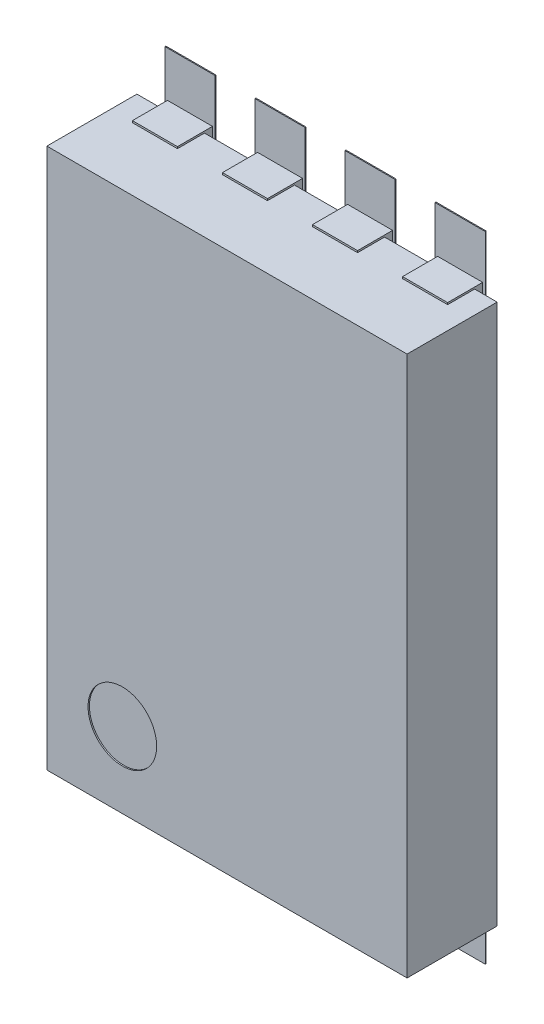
ISO-10303-21;
HEADER;
FILE_DESCRIPTION(('STEP AP214'),'2;1');
FILE_NAME('part.step','',(''),(''),'','','');
FILE_SCHEMA(('AUTOMOTIVE_DESIGN { 1 0 10303 214 1 1 1 1 }'));
ENDSEC;
DATA;
#1=APPLICATION_CONTEXT('core data for automotive mechanical design processes');
#2=APPLICATION_PROTOCOL_DEFINITION('international standard','automotive_design',2000,#1);
#3=PRODUCT_CONTEXT('',#1,'mechanical');
#4=PRODUCT('Part','Part','',(#3));
#5=PRODUCT_RELATED_PRODUCT_CATEGORY('part','',(#4));
#6=PRODUCT_DEFINITION_FORMATION('','',#4);
#7=PRODUCT_DEFINITION_CONTEXT('part definition',#1,'design');
#8=PRODUCT_DEFINITION('design','',#6,#7);
#9=PRODUCT_DEFINITION_SHAPE('','',#8);
#10=(LENGTH_UNIT() NAMED_UNIT(*) SI_UNIT(.MILLI.,.METRE.));
#11=(NAMED_UNIT(*) PLANE_ANGLE_UNIT() SI_UNIT($,.RADIAN.));
#12=(NAMED_UNIT(*) SI_UNIT($,.STERADIAN.) SOLID_ANGLE_UNIT());
#13=UNCERTAINTY_MEASURE_WITH_UNIT(LENGTH_MEASURE(1.E-05),#10,'distance_accuracy_value','');
#14=(GEOMETRIC_REPRESENTATION_CONTEXT(3) GLOBAL_UNCERTAINTY_ASSIGNED_CONTEXT((#13)) GLOBAL_UNIT_ASSIGNED_CONTEXT((#10,
#11,#12)) REPRESENTATION_CONTEXT('',''));
#15=CARTESIAN_POINT('',(0.,0.,0.));
#16=DIRECTION('',(0.,0.,1.));
#17=DIRECTION('',(1.,0.,0.));
#18=AXIS2_PLACEMENT_3D('',#15,#16,#17);
#19=CARTESIAN_POINT('',(0.,0.,0.0762));
#20=DIRECTION('',(0.,0.,1.));
#21=DIRECTION('',(1.,0.,0.));
#22=AXIS2_PLACEMENT_3D('',#19,#20,#21);
#23=PLANE('',#22);
#24=DIRECTION('',(1.,0.,0.));
#25=VECTOR('',#24,1.);
#26=CARTESIAN_POINT('',(0.610489,1.0504932,0.0762));
#27=LINE('',#26,#25);
#28=CARTESIAN_POINT('',(0.610489,1.0504932,0.0762));
#29=VERTEX_POINT('',#28);
#30=CARTESIAN_POINT('',(0.889508,1.0504932,0.0762));
#31=VERTEX_POINT('',#30);
#32=EDGE_CURVE('E581',#29,#31,#27,.T.);
#33=ORIENTED_EDGE('',*,*,#32,.F.);
#34=DIRECTION('',(0.,1.,0.));
#35=VECTOR('',#34,1.);
#36=CARTESIAN_POINT('',(0.610489,1.76149,0.0762));
#37=LINE('',#36,#35);
#38=CARTESIAN_POINT('',(0.610489,1.76149,0.0762));
#39=VERTEX_POINT('',#38);
#40=EDGE_CURVE('E586',#39,#29,#37,.F.);
#41=ORIENTED_EDGE('',*,*,#40,.F.);
#42=DIRECTION('',(1.,0.,0.));
#43=VECTOR('',#42,1.);
#44=CARTESIAN_POINT('',(0.889508,1.76149,0.0762));
#45=LINE('',#44,#43);
#46=CARTESIAN_POINT('',(0.889508,1.76149,0.0762));
#47=VERTEX_POINT('',#46);
#48=EDGE_CURVE('E940',#47,#39,#45,.F.);
#49=ORIENTED_EDGE('',*,*,#48,.F.);
#50=DIRECTION('',(0.,1.,0.));
#51=VECTOR('',#50,1.);
#52=CARTESIAN_POINT('',(0.889508,1.0504932,0.0762));
#53=LINE('',#52,#51);
#54=EDGE_CURVE('E597',#31,#47,#53,.T.);
#55=ORIENTED_EDGE('',*,*,#54,.F.);
#56=EDGE_LOOP('',(#33,#41,#49,#55));
#57=FACE_BOUND('',#56,.T.);
#58=ADVANCED_FACE('F16',(#57),#23,.F.);
#59=CARTESIAN_POINT('',(0.,0.,0.0762));
#60=DIRECTION('',(0.,0.,1.));
#61=DIRECTION('',(1.,0.,0.));
#62=AXIS2_PLACEMENT_3D('',#59,#60,#61);
#63=PLANE('',#62);
#64=DIRECTION('',(1.,0.,0.));
#65=VECTOR('',#64,1.);
#66=CARTESIAN_POINT('',(0.11049,1.0504932,0.0762));
#67=LINE('',#66,#65);
#68=CARTESIAN_POINT('',(0.11049,1.0504932,0.0762));
#69=VERTEX_POINT('',#68);
#70=CARTESIAN_POINT('',(0.389509,1.0504932,0.0762));
#71=VERTEX_POINT('',#70);
#72=EDGE_CURVE('E933',#69,#71,#67,.T.);
#73=ORIENTED_EDGE('',*,*,#72,.F.);
#74=DIRECTION('',(0.,1.,0.));
#75=VECTOR('',#74,1.);
#76=CARTESIAN_POINT('',(0.11049,1.76149,0.0762));
#77=LINE('',#76,#75);
#78=CARTESIAN_POINT('',(0.11049,1.76149,0.0762));
#79=VERTEX_POINT('',#78);
#80=EDGE_CURVE('E938',#79,#69,#77,.F.);
#81=ORIENTED_EDGE('',*,*,#80,.F.);
#82=DIRECTION('',(1.,0.,0.));
#83=VECTOR('',#82,1.);
#84=CARTESIAN_POINT('',(0.389509,1.76149,0.0762));
#85=LINE('',#84,#83);
#86=CARTESIAN_POINT('',(0.389509,1.76149,0.0762));
#87=VERTEX_POINT('',#86);
#88=EDGE_CURVE('E919',#87,#79,#85,.F.);
#89=ORIENTED_EDGE('',*,*,#88,.F.);
#90=DIRECTION('',(0.,1.,0.));
#91=VECTOR('',#90,1.);
#92=CARTESIAN_POINT('',(0.389509,1.0504932,0.0762));
#93=LINE('',#92,#91);
#94=EDGE_CURVE('E928',#71,#87,#93,.T.);
#95=ORIENTED_EDGE('',*,*,#94,.F.);
#96=EDGE_LOOP('',(#73,#81,#89,#95));
#97=FACE_BOUND('',#96,.T.);
#98=ADVANCED_FACE('F1330',(#97),#63,.F.);
#99=CARTESIAN_POINT('',(0.,0.,0.0762));
#100=DIRECTION('',(0.,0.,1.));
#101=DIRECTION('',(1.,0.,0.));
#102=AXIS2_PLACEMENT_3D('',#99,#100,#101);
#103=PLANE('',#102);
#104=DIRECTION('',(1.,0.,0.));
#105=VECTOR('',#104,1.);
#106=CARTESIAN_POINT('',(-0.389509,1.0504932,0.0762));
#107=LINE('',#106,#105);
#108=CARTESIAN_POINT('',(-0.389509,1.0504932,0.0762));
#109=VERTEX_POINT('',#108);
#110=CARTESIAN_POINT('',(-0.11049,1.0504932,0.0762));
#111=VERTEX_POINT('',#110);
#112=EDGE_CURVE('E912',#109,#111,#107,.T.);
#113=ORIENTED_EDGE('',*,*,#112,.F.);
#114=DIRECTION('',(0.,1.,0.));
#115=VECTOR('',#114,1.);
#116=CARTESIAN_POINT('',(-0.389509,1.76149,0.0762));
#117=LINE('',#116,#115);
#118=CARTESIAN_POINT('',(-0.389509,1.76149,0.0762));
#119=VERTEX_POINT('',#118);
#120=EDGE_CURVE('E917',#119,#109,#117,.F.);
#121=ORIENTED_EDGE('',*,*,#120,.F.);
#122=DIRECTION('',(1.,0.,0.));
#123=VECTOR('',#122,1.);
#124=CARTESIAN_POINT('',(-0.11049,1.76149,0.0762));
#125=LINE('',#124,#123);
#126=CARTESIAN_POINT('',(-0.11049,1.76149,0.0762));
#127=VERTEX_POINT('',#126);
#128=EDGE_CURVE('E898',#127,#119,#125,.F.);
#129=ORIENTED_EDGE('',*,*,#128,.F.);
#130=DIRECTION('',(0.,1.,0.));
#131=VECTOR('',#130,1.);
#132=CARTESIAN_POINT('',(-0.11049,1.0504932,0.0762));
#133=LINE('',#132,#131);
#134=EDGE_CURVE('E907',#111,#127,#133,.T.);
#135=ORIENTED_EDGE('',*,*,#134,.F.);
#136=EDGE_LOOP('',(#113,#121,#129,#135));
#137=FACE_BOUND('',#136,.T.);
#138=ADVANCED_FACE('F1335',(#137),#103,.F.);
#139=CARTESIAN_POINT('',(0.,0.,0.0762));
#140=DIRECTION('',(0.,0.,1.));
#141=DIRECTION('',(1.,0.,0.));
#142=AXIS2_PLACEMENT_3D('',#139,#140,#141);
#143=PLANE('',#142);
#144=DIRECTION('',(1.,0.,0.));
#145=VECTOR('',#144,1.);
#146=CARTESIAN_POINT('',(-0.889508,1.0504932,0.0762));
#147=LINE('',#146,#145);
#148=CARTESIAN_POINT('',(-0.889508,1.0504932,0.0762));
#149=VERTEX_POINT('',#148);
#150=CARTESIAN_POINT('',(-0.610489,1.0504932,0.0762));
#151=VERTEX_POINT('',#150);
#152=EDGE_CURVE('E891',#149,#151,#147,.T.);
#153=ORIENTED_EDGE('',*,*,#152,.F.);
#154=DIRECTION('',(0.,1.,0.));
#155=VECTOR('',#154,1.);
#156=CARTESIAN_POINT('',(-0.889508,1.76149,0.0762));
#157=LINE('',#156,#155);
#158=CARTESIAN_POINT('',(-0.889508,1.76149,0.0762));
#159=VERTEX_POINT('',#158);
#160=EDGE_CURVE('E896',#159,#149,#157,.F.);
#161=ORIENTED_EDGE('',*,*,#160,.F.);
#162=DIRECTION('',(1.,0.,0.));
#163=VECTOR('',#162,1.);
#164=CARTESIAN_POINT('',(-0.610489,1.76149,0.0762));
#165=LINE('',#164,#163);
#166=CARTESIAN_POINT('',(-0.610489,1.76149,0.0762));
#167=VERTEX_POINT('',#166);
#168=EDGE_CURVE('E877',#167,#159,#165,.F.);
#169=ORIENTED_EDGE('',*,*,#168,.F.);
#170=DIRECTION('',(0.,1.,0.));
#171=VECTOR('',#170,1.);
#172=CARTESIAN_POINT('',(-0.610489,1.0504932,0.0762));
#173=LINE('',#172,#171);
#174=EDGE_CURVE('E886',#151,#167,#173,.T.);
#175=ORIENTED_EDGE('',*,*,#174,.F.);
#176=EDGE_LOOP('',(#153,#161,#169,#175));
#177=FACE_BOUND('',#176,.T.);
#178=ADVANCED_FACE('F1340',(#177),#143,.F.);
#179=CARTESIAN_POINT('',(0.,0.,0.0762));
#180=DIRECTION('',(0.,0.,1.));
#181=DIRECTION('',(1.,0.,0.));
#182=AXIS2_PLACEMENT_3D('',#179,#180,#181);
#183=PLANE('',#182);
#184=DIRECTION('',(0.,1.,0.));
#185=VECTOR('',#184,1.);
#186=CARTESIAN_POINT('',(-0.11049,-1.76149,0.0762));
#187=LINE('',#186,#185);
#188=CARTESIAN_POINT('',(-0.11049,-1.76149,0.0762));
#189=VERTEX_POINT('',#188);
#190=CARTESIAN_POINT('',(-0.11049,-1.0504932,0.0762));
#191=VERTEX_POINT('',#190);
#192=EDGE_CURVE('E870',#189,#191,#187,.T.);
#193=ORIENTED_EDGE('',*,*,#192,.F.);
#194=DIRECTION('',(1.,0.,0.));
#195=VECTOR('',#194,1.);
#196=CARTESIAN_POINT('',(-0.389509,-1.76149,0.0762));
#197=LINE('',#196,#195);
#198=CARTESIAN_POINT('',(-0.389509,-1.76149,0.0762));
#199=VERTEX_POINT('',#198);
#200=EDGE_CURVE('E875',#199,#189,#197,.T.);
#201=ORIENTED_EDGE('',*,*,#200,.F.);
#202=DIRECTION('',(0.,1.,0.));
#203=VECTOR('',#202,1.);
#204=CARTESIAN_POINT('',(-0.389509,-1.0504932,0.0762));
#205=LINE('',#204,#203);
#206=CARTESIAN_POINT('',(-0.389509,-1.0504932,0.0762));
#207=VERTEX_POINT('',#206);
#208=EDGE_CURVE('E856',#207,#199,#205,.F.);
#209=ORIENTED_EDGE('',*,*,#208,.F.);
#210=DIRECTION('',(1.,0.,0.));
#211=VECTOR('',#210,1.);
#212=CARTESIAN_POINT('',(-0.11049,-1.0504932,0.0762));
#213=LINE('',#212,#211);
#214=EDGE_CURVE('E865',#191,#207,#213,.F.);
#215=ORIENTED_EDGE('',*,*,#214,.F.);
#216=EDGE_LOOP('',(#193,#201,#209,#215));
#217=FACE_BOUND('',#216,.T.);
#218=ADVANCED_FACE('F1346',(#217),#183,.F.);
#219=CARTESIAN_POINT('',(0.,0.,0.0762));
#220=DIRECTION('',(0.,0.,1.));
#221=DIRECTION('',(1.,0.,0.));
#222=AXIS2_PLACEMENT_3D('',#219,#220,#221);
#223=PLANE('',#222);
#224=DIRECTION('',(0.,1.,0.));
#225=VECTOR('',#224,1.);
#226=CARTESIAN_POINT('',(0.389509,-1.76149,0.0762));
#227=LINE('',#226,#225);
#228=CARTESIAN_POINT('',(0.389509,-1.76149,0.0762));
#229=VERTEX_POINT('',#228);
#230=CARTESIAN_POINT('',(0.389509,-1.0504932,0.0762));
#231=VERTEX_POINT('',#230);
#232=EDGE_CURVE('E849',#229,#231,#227,.T.);
#233=ORIENTED_EDGE('',*,*,#232,.F.);
#234=DIRECTION('',(1.,0.,0.));
#235=VECTOR('',#234,1.);
#236=CARTESIAN_POINT('',(0.11049,-1.76149,0.0762));
#237=LINE('',#236,#235);
#238=CARTESIAN_POINT('',(0.11049,-1.76149,0.0762));
#239=VERTEX_POINT('',#238);
#240=EDGE_CURVE('E854',#239,#229,#237,.T.);
#241=ORIENTED_EDGE('',*,*,#240,.F.);
#242=DIRECTION('',(0.,1.,0.));
#243=VECTOR('',#242,1.);
#244=CARTESIAN_POINT('',(0.11049,-1.0504932,0.0762));
#245=LINE('',#244,#243);
#246=CARTESIAN_POINT('',(0.11049,-1.0504932,0.0762));
#247=VERTEX_POINT('',#246);
#248=EDGE_CURVE('E835',#247,#239,#245,.F.);
#249=ORIENTED_EDGE('',*,*,#248,.F.);
#250=DIRECTION('',(1.,0.,0.));
#251=VECTOR('',#250,1.);
#252=CARTESIAN_POINT('',(0.389509,-1.0504932,0.0762));
#253=LINE('',#252,#251);
#254=EDGE_CURVE('E844',#231,#247,#253,.F.);
#255=ORIENTED_EDGE('',*,*,#254,.F.);
#256=EDGE_LOOP('',(#233,#241,#249,#255));
#257=FACE_BOUND('',#256,.T.);
#258=ADVANCED_FACE('F1350',(#257),#223,.F.);
#259=CARTESIAN_POINT('',(0.,0.,0.0762));
#260=DIRECTION('',(0.,0.,1.));
#261=DIRECTION('',(1.,0.,0.));
#262=AXIS2_PLACEMENT_3D('',#259,#260,#261);
#263=PLANE('',#262);
#264=DIRECTION('',(0.,1.,0.));
#265=VECTOR('',#264,1.);
#266=CARTESIAN_POINT('',(0.889508,-1.76149,0.0762));
#267=LINE('',#266,#265);
#268=CARTESIAN_POINT('',(0.889508,-1.76149,0.0762));
#269=VERTEX_POINT('',#268);
#270=CARTESIAN_POINT('',(0.889508,-1.0504932,0.0762));
#271=VERTEX_POINT('',#270);
#272=EDGE_CURVE('E828',#269,#271,#267,.T.);
#273=ORIENTED_EDGE('',*,*,#272,.F.);
#274=DIRECTION('',(1.,0.,0.));
#275=VECTOR('',#274,1.);
#276=CARTESIAN_POINT('',(0.610489,-1.76149,0.0762));
#277=LINE('',#276,#275);
#278=CARTESIAN_POINT('',(0.610489,-1.76149,0.0762));
#279=VERTEX_POINT('',#278);
#280=EDGE_CURVE('E833',#279,#269,#277,.T.);
#281=ORIENTED_EDGE('',*,*,#280,.F.);
#282=DIRECTION('',(0.,1.,0.));
#283=VECTOR('',#282,1.);
#284=CARTESIAN_POINT('',(0.610489,-1.0504932,0.0762));
#285=LINE('',#284,#283);
#286=CARTESIAN_POINT('',(0.610489,-1.0504932,0.0762));
#287=VERTEX_POINT('',#286);
#288=EDGE_CURVE('E814',#287,#279,#285,.F.);
#289=ORIENTED_EDGE('',*,*,#288,.F.);
#290=DIRECTION('',(1.,0.,0.));
#291=VECTOR('',#290,1.);
#292=CARTESIAN_POINT('',(0.889508,-1.0504932,0.0762));
#293=LINE('',#292,#291);
#294=EDGE_CURVE('E823',#271,#287,#293,.F.);
#295=ORIENTED_EDGE('',*,*,#294,.F.);
#296=EDGE_LOOP('',(#273,#281,#289,#295));
#297=FACE_BOUND('',#296,.T.);
#298=ADVANCED_FACE('F1354',(#297),#263,.F.);
#299=CARTESIAN_POINT('',(0.,0.,0.0762));
#300=DIRECTION('',(0.,0.,1.));
#301=DIRECTION('',(1.,0.,0.));
#302=AXIS2_PLACEMENT_3D('',#299,#300,#301);
#303=PLANE('',#302);
#304=DIRECTION('',(1.,0.,0.));
#305=VECTOR('',#304,1.);
#306=CARTESIAN_POINT('',(-0.610489,-1.0504932,0.0762));
#307=LINE('',#306,#305);
#308=CARTESIAN_POINT('',(-0.610489,-1.0504932,0.0762));
#309=VERTEX_POINT('',#308);
#310=CARTESIAN_POINT('',(-0.889508,-1.0504932,0.0762));
#311=VERTEX_POINT('',#310);
#312=EDGE_CURVE('E807',#309,#311,#307,.F.);
#313=ORIENTED_EDGE('',*,*,#312,.F.);
#314=DIRECTION('',(0.,1.,0.));
#315=VECTOR('',#314,1.);
#316=CARTESIAN_POINT('',(-0.610489,-1.76149,0.0762));
#317=LINE('',#316,#315);
#318=CARTESIAN_POINT('',(-0.610489,-1.76149,0.0762));
#319=VERTEX_POINT('',#318);
#320=EDGE_CURVE('E812',#319,#309,#317,.T.);
#321=ORIENTED_EDGE('',*,*,#320,.F.);
#322=DIRECTION('',(1.,0.,0.));
#323=VECTOR('',#322,1.);
#324=CARTESIAN_POINT('',(-0.889508,-1.76149,0.0762));
#325=LINE('',#324,#323);
#326=CARTESIAN_POINT('',(-0.889508,-1.76149,0.0762));
#327=VERTEX_POINT('',#326);
#328=EDGE_CURVE('E793',#327,#319,#325,.T.);
#329=ORIENTED_EDGE('',*,*,#328,.F.);
#330=DIRECTION('',(0.,1.,0.));
#331=VECTOR('',#330,1.);
#332=CARTESIAN_POINT('',(-0.889508,-1.0504932,0.0762));
#333=LINE('',#332,#331);
#334=EDGE_CURVE('E802',#311,#327,#333,.F.);
#335=ORIENTED_EDGE('',*,*,#334,.F.);
#336=EDGE_LOOP('',(#313,#321,#329,#335));
#337=FACE_BOUND('',#336,.T.);
#338=ADVANCED_FACE('F1358',(#337),#303,.F.);
#339=CARTESIAN_POINT('',(0.7999984,-0.6999986,0.0762));
#340=DIRECTION('',(1.,0.,0.));
#341=DIRECTION('',(0.,0.,-1.));
#342=AXIS2_PLACEMENT_3D('',#339,#340,#341);
#343=PLANE('',#342);
#344=DIRECTION('',(0.,0.,-1.));
#345=VECTOR('',#344,1.);
#346=CARTESIAN_POINT('',(0.7999984,-0.69999906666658,0.0762));
#347=LINE('',#346,#345);
#348=CARTESIAN_POINT('',(0.7999984,-0.699999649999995,0.081534));
#349=VERTEX_POINT('',#348);
#350=CARTESIAN_POINT('',(0.7999984,-0.699999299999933,0.0762));
#351=VERTEX_POINT('',#350);
#352=EDGE_CURVE('E611',#349,#351,#347,.T.);
#353=ORIENTED_EDGE('',*,*,#352,.T.);
#354=DIRECTION('',(0.,1.,0.));
#355=VECTOR('',#354,1.);
#356=CARTESIAN_POINT('',(0.7999984,0.,0.0762));
#357=LINE('',#356,#355);
#358=CARTESIAN_POINT('',(0.7999984,0.699999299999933,0.0762));
#359=VERTEX_POINT('',#358);
#360=EDGE_CURVE('E622',#351,#359,#357,.T.);
#361=ORIENTED_EDGE('',*,*,#360,.T.);
#362=DIRECTION('',(0.,0.,-1.));
#363=VECTOR('',#362,1.);
#364=CARTESIAN_POINT('',(0.7999984,0.69999906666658,0.0762));
#365=LINE('',#364,#363);
#366=CARTESIAN_POINT('',(0.7999984,0.699999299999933,0.081534));
#367=VERTEX_POINT('',#366);
#368=EDGE_CURVE('E613',#359,#367,#365,.F.);
#369=ORIENTED_EDGE('',*,*,#368,.T.);
#370=DIRECTION('',(0.,1.,0.));
#371=VECTOR('',#370,1.);
#372=CARTESIAN_POINT('',(0.7999984,0.,0.081534));
#373=LINE('',#372,#371);
#374=EDGE_CURVE('E619',#349,#367,#373,.T.);
#375=ORIENTED_EDGE('',*,*,#374,.F.);
#376=EDGE_LOOP('',(#353,#361,#369,#375));
#377=FACE_BOUND('',#376,.T.);
#378=ADVANCED_FACE('F618',(#377),#343,.T.);
#379=CARTESIAN_POINT('',(-0.7999984,0.6999986,0.0762));
#380=DIRECTION('',(-1.,0.,0.));
#381=DIRECTION('',(0.,0.,1.));
#382=AXIS2_PLACEMENT_3D('',#379,#380,#381);
#383=PLANE('',#382);
#384=DIRECTION('',(0.,0.,1.));
#385=VECTOR('',#384,1.);
#386=CARTESIAN_POINT('',(-0.7999984,0.69999906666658,0.0762));
#387=LINE('',#386,#385);
#388=CARTESIAN_POINT('',(-0.7999984,0.699999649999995,0.081534));
#389=VERTEX_POINT('',#388);
#390=CARTESIAN_POINT('',(-0.7999984,0.699999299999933,0.0762));
#391=VERTEX_POINT('',#390);
#392=EDGE_CURVE('E595',#389,#391,#387,.F.);
#393=ORIENTED_EDGE('',*,*,#392,.T.);
#394=DIRECTION('',(0.,1.,0.));
#395=VECTOR('',#394,1.);
#396=CARTESIAN_POINT('',(-0.7999984,0.,0.0762));
#397=LINE('',#396,#395);
#398=CARTESIAN_POINT('',(-0.7999984,-0.699999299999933,0.0762));
#399=VERTEX_POINT('',#398);
#400=EDGE_CURVE('E780',#391,#399,#397,.F.);
#401=ORIENTED_EDGE('',*,*,#400,.T.);
#402=DIRECTION('',(0.,0.,1.));
#403=VECTOR('',#402,1.);
#404=CARTESIAN_POINT('',(-0.7999984,-0.69999906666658,0.0762));
#405=LINE('',#404,#403);
#406=CARTESIAN_POINT('',(-0.7999984,-0.699999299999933,0.081534));
#407=VERTEX_POINT('',#406);
#408=EDGE_CURVE('E609',#399,#407,#405,.T.);
#409=ORIENTED_EDGE('',*,*,#408,.T.);
#410=DIRECTION('',(0.,1.,0.));
#411=VECTOR('',#410,1.);
#412=CARTESIAN_POINT('',(-0.7999984,0.,0.081534));
#413=LINE('',#412,#411);
#414=EDGE_CURVE('E787',#389,#407,#413,.F.);
#415=ORIENTED_EDGE('',*,*,#414,.F.);
#416=EDGE_LOOP('',(#393,#401,#409,#415));
#417=FACE_BOUND('',#416,.T.);
#418=ADVANCED_FACE('F1365',(#417),#383,.T.);
#419=CARTESIAN_POINT('',(0.610489,1.76149,0.0762));
#420=DIRECTION('',(-1.,0.,0.));
#421=DIRECTION('',(0.,0.,1.));
#422=AXIS2_PLACEMENT_3D('',#419,#420,#421);
#423=PLANE('',#422);
#424=DIRECTION('',(0.,0.,1.));
#425=VECTOR('',#424,1.);
#426=CARTESIAN_POINT('',(0.610489,1.76149,0.0762));
#427=LINE('',#426,#425);
#428=CARTESIAN_POINT('',(0.610489,1.76149,0.081534));
#429=VERTEX_POINT('',#428);
#430=EDGE_CURVE('E591',#39,#429,#427,.T.);
#431=ORIENTED_EDGE('',*,*,#430,.F.);
#432=ORIENTED_EDGE('',*,*,#40,.T.);
#433=DIRECTION('',(0.,0.,-1.));
#434=VECTOR('',#433,1.);
#435=CARTESIAN_POINT('',(0.610489,1.0504932,0.0762));
#436=LINE('',#435,#434);
#437=CARTESIAN_POINT('',(0.610489,1.0504932,0.081534));
#438=VERTEX_POINT('',#437);
#439=EDGE_CURVE('E588',#438,#29,#436,.T.);
#440=ORIENTED_EDGE('',*,*,#439,.F.);
#441=DIRECTION('',(0.,1.,0.));
#442=VECTOR('',#441,1.);
#443=CARTESIAN_POINT('',(0.610489,0.,0.081534));
#444=LINE('',#443,#442);
#445=EDGE_CURVE('E778',#429,#438,#444,.F.);
#446=ORIENTED_EDGE('',*,*,#445,.F.);
#447=EDGE_LOOP('',(#431,#432,#440,#446));
#448=FACE_BOUND('',#447,.T.);
#449=ADVANCED_FACE('F587',(#448),#423,.T.);
#450=CARTESIAN_POINT('',(0.610489,1.0504932,0.0762));
#451=DIRECTION('',(0.,-1.,0.));
#452=DIRECTION('',(0.,0.,-1.));
#453=AXIS2_PLACEMENT_3D('',#450,#451,#452);
#454=PLANE('',#453);
#455=ORIENTED_EDGE('',*,*,#439,.T.);
#456=ORIENTED_EDGE('',*,*,#32,.T.);
#457=DIRECTION('',(0.,0.,-1.));
#458=VECTOR('',#457,1.);
#459=CARTESIAN_POINT('',(0.889508,1.0504932,0.0762));
#460=LINE('',#459,#458);
#461=CARTESIAN_POINT('',(0.889508,1.0504932,0.081534));
#462=VERTEX_POINT('',#461);
#463=EDGE_CURVE('E599',#462,#31,#460,.T.);
#464=ORIENTED_EDGE('',*,*,#463,.F.);
#465=DIRECTION('',(1.,0.,0.));
#466=VECTOR('',#465,1.);
#467=CARTESIAN_POINT('',(0.,1.0504932,0.081534));
#468=LINE('',#467,#466);
#469=EDGE_CURVE('E603',#438,#462,#468,.T.);
#470=ORIENTED_EDGE('',*,*,#469,.F.);
#471=EDGE_LOOP('',(#455,#456,#464,#470));
#472=FACE_BOUND('',#471,.T.);
#473=ADVANCED_FACE('F601',(#472),#454,.T.);
#474=CARTESIAN_POINT('',(0.889508,1.0504932,0.0762));
#475=DIRECTION('',(1.,0.,0.));
#476=DIRECTION('',(0.,0.,-1.));
#477=AXIS2_PLACEMENT_3D('',#474,#475,#476);
#478=PLANE('',#477);
#479=ORIENTED_EDGE('',*,*,#463,.T.);
#480=ORIENTED_EDGE('',*,*,#54,.T.);
#481=DIRECTION('',(0.,0.,1.));
#482=VECTOR('',#481,1.);
#483=CARTESIAN_POINT('',(0.889508,1.76149,0.0762));
#484=LINE('',#483,#482);
#485=CARTESIAN_POINT('',(0.889508,1.76149,0.081534));
#486=VERTEX_POINT('',#485);
#487=EDGE_CURVE('E942',#486,#47,#484,.F.);
#488=ORIENTED_EDGE('',*,*,#487,.F.);
#489=DIRECTION('',(0.,1.,0.));
#490=VECTOR('',#489,1.);
#491=CARTESIAN_POINT('',(0.889508,0.,0.081534));
#492=LINE('',#491,#490);
#493=EDGE_CURVE('E774',#462,#486,#492,.T.);
#494=ORIENTED_EDGE('',*,*,#493,.F.);
#495=EDGE_LOOP('',(#479,#480,#488,#494));
#496=FACE_BOUND('',#495,.T.);
#497=ADVANCED_FACE('F948',(#496),#478,.T.);
#498=CARTESIAN_POINT('',(0.889508,1.76149,0.0762));
#499=DIRECTION('',(0.,1.,0.));
#500=DIRECTION('',(0.,0.,1.));
#501=AXIS2_PLACEMENT_3D('',#498,#499,#500);
#502=PLANE('',#501);
#503=ORIENTED_EDGE('',*,*,#487,.T.);
#504=ORIENTED_EDGE('',*,*,#48,.T.);
#505=ORIENTED_EDGE('',*,*,#430,.T.);
#506=DIRECTION('',(1.,0.,0.));
#507=VECTOR('',#506,1.);
#508=CARTESIAN_POINT('',(0.,1.76149,0.081534));
#509=LINE('',#508,#507);
#510=EDGE_CURVE('E771',#486,#429,#509,.F.);
#511=ORIENTED_EDGE('',*,*,#510,.F.);
#512=EDGE_LOOP('',(#503,#504,#505,#511));
#513=FACE_BOUND('',#512,.T.);
#514=ADVANCED_FACE('F953',(#513),#502,.T.);
#515=CARTESIAN_POINT('',(0.11049,1.76149,0.0762));
#516=DIRECTION('',(-1.,0.,0.));
#517=DIRECTION('',(0.,0.,1.));
#518=AXIS2_PLACEMENT_3D('',#515,#516,#517);
#519=PLANE('',#518);
#520=DIRECTION('',(0.,0.,1.));
#521=VECTOR('',#520,1.);
#522=CARTESIAN_POINT('',(0.11049,1.76149,0.0762));
#523=LINE('',#522,#521);
#524=CARTESIAN_POINT('',(0.11049,1.76149,0.081534));
#525=VERTEX_POINT('',#524);
#526=EDGE_CURVE('E925',#79,#525,#523,.T.);
#527=ORIENTED_EDGE('',*,*,#526,.F.);
#528=ORIENTED_EDGE('',*,*,#80,.T.);
#529=DIRECTION('',(0.,0.,-1.));
#530=VECTOR('',#529,1.);
#531=CARTESIAN_POINT('',(0.11049,1.0504932,0.0762));
#532=LINE('',#531,#530);
#533=CARTESIAN_POINT('',(0.11049,1.0504932,0.081534));
#534=VERTEX_POINT('',#533);
#535=EDGE_CURVE('E935',#534,#69,#532,.T.);
#536=ORIENTED_EDGE('',*,*,#535,.F.);
#537=DIRECTION('',(0.,1.,0.));
#538=VECTOR('',#537,1.);
#539=CARTESIAN_POINT('',(0.11049,0.,0.081534));
#540=LINE('',#539,#538);
#541=EDGE_CURVE('E765',#525,#534,#540,.F.);
#542=ORIENTED_EDGE('',*,*,#541,.F.);
#543=EDGE_LOOP('',(#527,#528,#536,#542));
#544=FACE_BOUND('',#543,.T.);
#545=ADVANCED_FACE('F955',(#544),#519,.T.);
#546=CARTESIAN_POINT('',(0.11049,1.0504932,0.0762));
#547=DIRECTION('',(0.,-1.,0.));
#548=DIRECTION('',(0.,0.,-1.));
#549=AXIS2_PLACEMENT_3D('',#546,#547,#548);
#550=PLANE('',#549);
#551=ORIENTED_EDGE('',*,*,#535,.T.);
#552=ORIENTED_EDGE('',*,*,#72,.T.);
#553=DIRECTION('',(0.,0.,-1.));
#554=VECTOR('',#553,1.);
#555=CARTESIAN_POINT('',(0.389509,1.0504932,0.0762));
#556=LINE('',#555,#554);
#557=CARTESIAN_POINT('',(0.389509,1.0504932,0.081534));
#558=VERTEX_POINT('',#557);
#559=EDGE_CURVE('E930',#558,#71,#556,.T.);
#560=ORIENTED_EDGE('',*,*,#559,.F.);
#561=DIRECTION('',(1.,0.,0.));
#562=VECTOR('',#561,1.);
#563=CARTESIAN_POINT('',(0.,1.0504932,0.081534));
#564=LINE('',#563,#562);
#565=EDGE_CURVE('E762',#534,#558,#564,.T.);
#566=ORIENTED_EDGE('',*,*,#565,.F.);
#567=EDGE_LOOP('',(#551,#552,#560,#566));
#568=FACE_BOUND('',#567,.T.);
#569=ADVANCED_FACE('F962',(#568),#550,.T.);
#570=CARTESIAN_POINT('',(0.389509,1.0504932,0.0762));
#571=DIRECTION('',(1.,0.,0.));
#572=DIRECTION('',(0.,0.,-1.));
#573=AXIS2_PLACEMENT_3D('',#570,#571,#572);
#574=PLANE('',#573);
#575=ORIENTED_EDGE('',*,*,#559,.T.);
#576=ORIENTED_EDGE('',*,*,#94,.T.);
#577=DIRECTION('',(0.,0.,1.));
#578=VECTOR('',#577,1.);
#579=CARTESIAN_POINT('',(0.389509,1.76149,0.0762));
#580=LINE('',#579,#578);
#581=CARTESIAN_POINT('',(0.389509,1.76149,0.081534));
#582=VERTEX_POINT('',#581);
#583=EDGE_CURVE('E922',#582,#87,#580,.F.);
#584=ORIENTED_EDGE('',*,*,#583,.F.);
#585=DIRECTION('',(0.,1.,0.));
#586=VECTOR('',#585,1.);
#587=CARTESIAN_POINT('',(0.389509,0.,0.081534));
#588=LINE('',#587,#586);
#589=EDGE_CURVE('E759',#558,#582,#588,.T.);
#590=ORIENTED_EDGE('',*,*,#589,.F.);
#591=EDGE_LOOP('',(#575,#576,#584,#590));
#592=FACE_BOUND('',#591,.T.);
#593=ADVANCED_FACE('F1315',(#592),#574,.T.);
#594=CARTESIAN_POINT('',(0.389509,1.76149,0.0762));
#595=DIRECTION('',(0.,1.,0.));
#596=DIRECTION('',(0.,0.,1.));
#597=AXIS2_PLACEMENT_3D('',#594,#595,#596);
#598=PLANE('',#597);
#599=ORIENTED_EDGE('',*,*,#583,.T.);
#600=ORIENTED_EDGE('',*,*,#88,.T.);
#601=ORIENTED_EDGE('',*,*,#526,.T.);
#602=DIRECTION('',(1.,0.,0.));
#603=VECTOR('',#602,1.);
#604=CARTESIAN_POINT('',(0.,1.76149,0.081534));
#605=LINE('',#604,#603);
#606=EDGE_CURVE('E756',#582,#525,#605,.F.);
#607=ORIENTED_EDGE('',*,*,#606,.F.);
#608=EDGE_LOOP('',(#599,#600,#601,#607));
#609=FACE_BOUND('',#608,.T.);
#610=ADVANCED_FACE('F1311',(#609),#598,.T.);
#611=CARTESIAN_POINT('',(-0.389509,1.76149,0.0762));
#612=DIRECTION('',(-1.,0.,0.));
#613=DIRECTION('',(0.,0.,1.));
#614=AXIS2_PLACEMENT_3D('',#611,#612,#613);
#615=PLANE('',#614);
#616=DIRECTION('',(0.,0.,1.));
#617=VECTOR('',#616,1.);
#618=CARTESIAN_POINT('',(-0.389509,1.76149,0.0762));
#619=LINE('',#618,#617);
#620=CARTESIAN_POINT('',(-0.389509,1.76149,0.081534));
#621=VERTEX_POINT('',#620);
#622=EDGE_CURVE('E904',#119,#621,#619,.T.);
#623=ORIENTED_EDGE('',*,*,#622,.F.);
#624=ORIENTED_EDGE('',*,*,#120,.T.);
#625=DIRECTION('',(0.,0.,-1.));
#626=VECTOR('',#625,1.);
#627=CARTESIAN_POINT('',(-0.389509,1.0504932,0.0762));
#628=LINE('',#627,#626);
#629=CARTESIAN_POINT('',(-0.389509,1.0504932,0.081534));
#630=VERTEX_POINT('',#629);
#631=EDGE_CURVE('E914',#630,#109,#628,.T.);
#632=ORIENTED_EDGE('',*,*,#631,.F.);
#633=DIRECTION('',(0.,1.,0.));
#634=VECTOR('',#633,1.);
#635=CARTESIAN_POINT('',(-0.389509,0.,0.081534));
#636=LINE('',#635,#634);
#637=EDGE_CURVE('E750',#621,#630,#636,.F.);
#638=ORIENTED_EDGE('',*,*,#637,.F.);
#639=EDGE_LOOP('',(#623,#624,#632,#638));
#640=FACE_BOUND('',#639,.T.);
#641=ADVANCED_FACE('F1307',(#640),#615,.T.);
#642=CARTESIAN_POINT('',(-0.389509,1.0504932,0.0762));
#643=DIRECTION('',(0.,-1.,0.));
#644=DIRECTION('',(0.,0.,-1.));
#645=AXIS2_PLACEMENT_3D('',#642,#643,#644);
#646=PLANE('',#645);
#647=ORIENTED_EDGE('',*,*,#631,.T.);
#648=ORIENTED_EDGE('',*,*,#112,.T.);
#649=DIRECTION('',(0.,0.,-1.));
#650=VECTOR('',#649,1.);
#651=CARTESIAN_POINT('',(-0.11049,1.0504932,0.0762));
#652=LINE('',#651,#650);
#653=CARTESIAN_POINT('',(-0.11049,1.0504932,0.081534));
#654=VERTEX_POINT('',#653);
#655=EDGE_CURVE('E909',#654,#111,#652,.T.);
#656=ORIENTED_EDGE('',*,*,#655,.F.);
#657=DIRECTION('',(1.,0.,0.));
#658=VECTOR('',#657,1.);
#659=CARTESIAN_POINT('',(0.,1.0504932,0.081534));
#660=LINE('',#659,#658);
#661=EDGE_CURVE('E747',#630,#654,#660,.T.);
#662=ORIENTED_EDGE('',*,*,#661,.F.);
#663=EDGE_LOOP('',(#647,#648,#656,#662));
#664=FACE_BOUND('',#663,.T.);
#665=ADVANCED_FACE('F1303',(#664),#646,.T.);
#666=CARTESIAN_POINT('',(-0.11049,1.0504932,0.0762));
#667=DIRECTION('',(1.,0.,0.));
#668=DIRECTION('',(0.,0.,-1.));
#669=AXIS2_PLACEMENT_3D('',#666,#667,#668);
#670=PLANE('',#669);
#671=ORIENTED_EDGE('',*,*,#655,.T.);
#672=ORIENTED_EDGE('',*,*,#134,.T.);
#673=DIRECTION('',(0.,0.,1.));
#674=VECTOR('',#673,1.);
#675=CARTESIAN_POINT('',(-0.11049,1.76149,0.0762));
#676=LINE('',#675,#674);
#677=CARTESIAN_POINT('',(-0.11049,1.76149,0.081534));
#678=VERTEX_POINT('',#677);
#679=EDGE_CURVE('E901',#678,#127,#676,.F.);
#680=ORIENTED_EDGE('',*,*,#679,.F.);
#681=DIRECTION('',(0.,1.,0.));
#682=VECTOR('',#681,1.);
#683=CARTESIAN_POINT('',(-0.11049,0.,0.081534));
#684=LINE('',#683,#682);
#685=EDGE_CURVE('E744',#654,#678,#684,.T.);
#686=ORIENTED_EDGE('',*,*,#685,.F.);
#687=EDGE_LOOP('',(#671,#672,#680,#686));
#688=FACE_BOUND('',#687,.T.);
#689=ADVANCED_FACE('F1299',(#688),#670,.T.);
#690=CARTESIAN_POINT('',(-0.11049,1.76149,0.0762));
#691=DIRECTION('',(0.,1.,0.));
#692=DIRECTION('',(0.,0.,1.));
#693=AXIS2_PLACEMENT_3D('',#690,#691,#692);
#694=PLANE('',#693);
#695=ORIENTED_EDGE('',*,*,#679,.T.);
#696=ORIENTED_EDGE('',*,*,#128,.T.);
#697=ORIENTED_EDGE('',*,*,#622,.T.);
#698=DIRECTION('',(1.,0.,0.));
#699=VECTOR('',#698,1.);
#700=CARTESIAN_POINT('',(0.,1.76149,0.081534));
#701=LINE('',#700,#699);
#702=EDGE_CURVE('E741',#678,#621,#701,.F.);
#703=ORIENTED_EDGE('',*,*,#702,.F.);
#704=EDGE_LOOP('',(#695,#696,#697,#703));
#705=FACE_BOUND('',#704,.T.);
#706=ADVANCED_FACE('F1295',(#705),#694,.T.);
#707=CARTESIAN_POINT('',(-0.889508,1.76149,0.0762));
#708=DIRECTION('',(-1.,0.,0.));
#709=DIRECTION('',(0.,0.,1.));
#710=AXIS2_PLACEMENT_3D('',#707,#708,#709);
#711=PLANE('',#710);
#712=DIRECTION('',(0.,0.,1.));
#713=VECTOR('',#712,1.);
#714=CARTESIAN_POINT('',(-0.889508,1.76149,0.0762));
#715=LINE('',#714,#713);
#716=CARTESIAN_POINT('',(-0.889508,1.76149,0.081534));
#717=VERTEX_POINT('',#716);
#718=EDGE_CURVE('E883',#159,#717,#715,.T.);
#719=ORIENTED_EDGE('',*,*,#718,.F.);
#720=ORIENTED_EDGE('',*,*,#160,.T.);
#721=DIRECTION('',(0.,0.,-1.));
#722=VECTOR('',#721,1.);
#723=CARTESIAN_POINT('',(-0.889508,1.0504932,0.0762));
#724=LINE('',#723,#722);
#725=CARTESIAN_POINT('',(-0.889508,1.0504932,0.081534));
#726=VERTEX_POINT('',#725);
#727=EDGE_CURVE('E893',#726,#149,#724,.T.);
#728=ORIENTED_EDGE('',*,*,#727,.F.);
#729=DIRECTION('',(0.,1.,0.));
#730=VECTOR('',#729,1.);
#731=CARTESIAN_POINT('',(-0.889508,0.,0.081534));
#732=LINE('',#731,#730);
#733=EDGE_CURVE('E735',#717,#726,#732,.F.);
#734=ORIENTED_EDGE('',*,*,#733,.F.);
#735=EDGE_LOOP('',(#719,#720,#728,#734));
#736=FACE_BOUND('',#735,.T.);
#737=ADVANCED_FACE('F1291',(#736),#711,.T.);
#738=CARTESIAN_POINT('',(-0.889508,1.0504932,0.0762));
#739=DIRECTION('',(0.,-1.,0.));
#740=DIRECTION('',(0.,0.,-1.));
#741=AXIS2_PLACEMENT_3D('',#738,#739,#740);
#742=PLANE('',#741);
#743=ORIENTED_EDGE('',*,*,#727,.T.);
#744=ORIENTED_EDGE('',*,*,#152,.T.);
#745=DIRECTION('',(0.,0.,-1.));
#746=VECTOR('',#745,1.);
#747=CARTESIAN_POINT('',(-0.610489,1.0504932,0.0762));
#748=LINE('',#747,#746);
#749=CARTESIAN_POINT('',(-0.610489,1.0504932,0.081534));
#750=VERTEX_POINT('',#749);
#751=EDGE_CURVE('E888',#750,#151,#748,.T.);
#752=ORIENTED_EDGE('',*,*,#751,.F.);
#753=DIRECTION('',(1.,0.,0.));
#754=VECTOR('',#753,1.);
#755=CARTESIAN_POINT('',(0.,1.0504932,0.081534));
#756=LINE('',#755,#754);
#757=EDGE_CURVE('E732',#726,#750,#756,.T.);
#758=ORIENTED_EDGE('',*,*,#757,.F.);
#759=EDGE_LOOP('',(#743,#744,#752,#758));
#760=FACE_BOUND('',#759,.T.);
#761=ADVANCED_FACE('F1287',(#760),#742,.T.);
#762=CARTESIAN_POINT('',(-0.610489,1.0504932,0.0762));
#763=DIRECTION('',(1.,0.,0.));
#764=DIRECTION('',(0.,0.,-1.));
#765=AXIS2_PLACEMENT_3D('',#762,#763,#764);
#766=PLANE('',#765);
#767=ORIENTED_EDGE('',*,*,#751,.T.);
#768=ORIENTED_EDGE('',*,*,#174,.T.);
#769=DIRECTION('',(0.,0.,1.));
#770=VECTOR('',#769,1.);
#771=CARTESIAN_POINT('',(-0.610489,1.76149,0.0762));
#772=LINE('',#771,#770);
#773=CARTESIAN_POINT('',(-0.610489,1.76149,0.081534));
#774=VERTEX_POINT('',#773);
#775=EDGE_CURVE('E880',#774,#167,#772,.F.);
#776=ORIENTED_EDGE('',*,*,#775,.F.);
#777=DIRECTION('',(0.,1.,0.));
#778=VECTOR('',#777,1.);
#779=CARTESIAN_POINT('',(-0.610489,0.,0.081534));
#780=LINE('',#779,#778);
#781=EDGE_CURVE('E729',#750,#774,#780,.T.);
#782=ORIENTED_EDGE('',*,*,#781,.F.);
#783=EDGE_LOOP('',(#767,#768,#776,#782));
#784=FACE_BOUND('',#783,.T.);
#785=ADVANCED_FACE('F1283',(#784),#766,.T.);
#786=CARTESIAN_POINT('',(-0.610489,1.76149,0.0762));
#787=DIRECTION('',(0.,1.,0.));
#788=DIRECTION('',(0.,0.,1.));
#789=AXIS2_PLACEMENT_3D('',#786,#787,#788);
#790=PLANE('',#789);
#791=ORIENTED_EDGE('',*,*,#775,.T.);
#792=ORIENTED_EDGE('',*,*,#168,.T.);
#793=ORIENTED_EDGE('',*,*,#718,.T.);
#794=DIRECTION('',(1.,0.,0.));
#795=VECTOR('',#794,1.);
#796=CARTESIAN_POINT('',(0.,1.76149,0.081534));
#797=LINE('',#796,#795);
#798=EDGE_CURVE('E726',#774,#717,#797,.F.);
#799=ORIENTED_EDGE('',*,*,#798,.F.);
#800=EDGE_LOOP('',(#791,#792,#793,#799));
#801=FACE_BOUND('',#800,.T.);
#802=ADVANCED_FACE('F1279',(#801),#790,.T.);
#803=CARTESIAN_POINT('',(-0.389509,-1.76149,0.0762));
#804=DIRECTION('',(0.,-1.,0.));
#805=DIRECTION('',(0.,0.,-1.));
#806=AXIS2_PLACEMENT_3D('',#803,#804,#805);
#807=PLANE('',#806);
#808=DIRECTION('',(0.,0.,1.));
#809=VECTOR('',#808,1.);
#810=CARTESIAN_POINT('',(-0.389509,-1.76149,0.0762));
#811=LINE('',#810,#809);
#812=CARTESIAN_POINT('',(-0.389509,-1.76149,0.081534));
#813=VERTEX_POINT('',#812);
#814=EDGE_CURVE('E862',#199,#813,#811,.T.);
#815=ORIENTED_EDGE('',*,*,#814,.F.);
#816=ORIENTED_EDGE('',*,*,#200,.T.);
#817=DIRECTION('',(0.,0.,-1.));
#818=VECTOR('',#817,1.);
#819=CARTESIAN_POINT('',(-0.11049,-1.76149,0.0762));
#820=LINE('',#819,#818);
#821=CARTESIAN_POINT('',(-0.11049,-1.76149,0.081534));
#822=VERTEX_POINT('',#821);
#823=EDGE_CURVE('E872',#822,#189,#820,.T.);
#824=ORIENTED_EDGE('',*,*,#823,.F.);
#825=DIRECTION('',(1.,0.,0.));
#826=VECTOR('',#825,1.);
#827=CARTESIAN_POINT('',(0.,-1.76149,0.081534));
#828=LINE('',#827,#826);
#829=EDGE_CURVE('E721',#813,#822,#828,.T.);
#830=ORIENTED_EDGE('',*,*,#829,.F.);
#831=EDGE_LOOP('',(#815,#816,#824,#830));
#832=FACE_BOUND('',#831,.T.);
#833=ADVANCED_FACE('F1275',(#832),#807,.T.);
#834=CARTESIAN_POINT('',(-0.11049,-1.76149,0.0762));
#835=DIRECTION('',(1.,0.,0.));
#836=DIRECTION('',(0.,0.,-1.));
#837=AXIS2_PLACEMENT_3D('',#834,#835,#836);
#838=PLANE('',#837);
#839=ORIENTED_EDGE('',*,*,#823,.T.);
#840=ORIENTED_EDGE('',*,*,#192,.T.);
#841=DIRECTION('',(0.,0.,1.));
#842=VECTOR('',#841,1.);
#843=CARTESIAN_POINT('',(-0.11049,-1.0504932,0.0762));
#844=LINE('',#843,#842);
#845=CARTESIAN_POINT('',(-0.11049,-1.0504932,0.081534));
#846=VERTEX_POINT('',#845);
#847=EDGE_CURVE('E867',#846,#191,#844,.F.);
#848=ORIENTED_EDGE('',*,*,#847,.F.);
#849=DIRECTION('',(0.,1.,0.));
#850=VECTOR('',#849,1.);
#851=CARTESIAN_POINT('',(-0.11049,0.,0.081534));
#852=LINE('',#851,#850);
#853=EDGE_CURVE('E718',#822,#846,#852,.T.);
#854=ORIENTED_EDGE('',*,*,#853,.F.);
#855=EDGE_LOOP('',(#839,#840,#848,#854));
#856=FACE_BOUND('',#855,.T.);
#857=ADVANCED_FACE('F1271',(#856),#838,.T.);
#858=CARTESIAN_POINT('',(-0.11049,-1.0504932,0.0762));
#859=DIRECTION('',(0.,1.,0.));
#860=DIRECTION('',(0.,0.,1.));
#861=AXIS2_PLACEMENT_3D('',#858,#859,#860);
#862=PLANE('',#861);
#863=ORIENTED_EDGE('',*,*,#847,.T.);
#864=ORIENTED_EDGE('',*,*,#214,.T.);
#865=DIRECTION('',(0.,0.,1.));
#866=VECTOR('',#865,1.);
#867=CARTESIAN_POINT('',(-0.389509,-1.0504932,0.0762));
#868=LINE('',#867,#866);
#869=CARTESIAN_POINT('',(-0.389509,-1.0504932,0.081534));
#870=VERTEX_POINT('',#869);
#871=EDGE_CURVE('E859',#870,#207,#868,.F.);
#872=ORIENTED_EDGE('',*,*,#871,.F.);
#873=DIRECTION('',(1.,0.,0.));
#874=VECTOR('',#873,1.);
#875=CARTESIAN_POINT('',(0.,-1.0504932,0.081534));
#876=LINE('',#875,#874);
#877=EDGE_CURVE('E715',#846,#870,#876,.F.);
#878=ORIENTED_EDGE('',*,*,#877,.F.);
#879=EDGE_LOOP('',(#863,#864,#872,#878));
#880=FACE_BOUND('',#879,.T.);
#881=ADVANCED_FACE('F1267',(#880),#862,.T.);
#882=CARTESIAN_POINT('',(-0.389509,-1.0504932,0.0762));
#883=DIRECTION('',(-1.,0.,0.));
#884=DIRECTION('',(0.,0.,1.));
#885=AXIS2_PLACEMENT_3D('',#882,#883,#884);
#886=PLANE('',#885);
#887=ORIENTED_EDGE('',*,*,#871,.T.);
#888=ORIENTED_EDGE('',*,*,#208,.T.);
#889=ORIENTED_EDGE('',*,*,#814,.T.);
#890=DIRECTION('',(0.,1.,0.));
#891=VECTOR('',#890,1.);
#892=CARTESIAN_POINT('',(-0.389509,0.,0.081534));
#893=LINE('',#892,#891);
#894=EDGE_CURVE('E712',#870,#813,#893,.F.);
#895=ORIENTED_EDGE('',*,*,#894,.F.);
#896=EDGE_LOOP('',(#887,#888,#889,#895));
#897=FACE_BOUND('',#896,.T.);
#898=ADVANCED_FACE('F1263',(#897),#886,.T.);
#899=CARTESIAN_POINT('',(0.11049,-1.76149,0.0762));
#900=DIRECTION('',(0.,-1.,0.));
#901=DIRECTION('',(0.,0.,-1.));
#902=AXIS2_PLACEMENT_3D('',#899,#900,#901);
#903=PLANE('',#902);
#904=DIRECTION('',(0.,0.,1.));
#905=VECTOR('',#904,1.);
#906=CARTESIAN_POINT('',(0.11049,-1.76149,0.0762));
#907=LINE('',#906,#905);
#908=CARTESIAN_POINT('',(0.11049,-1.76149,0.081534));
#909=VERTEX_POINT('',#908);
#910=EDGE_CURVE('E841',#239,#909,#907,.T.);
#911=ORIENTED_EDGE('',*,*,#910,.F.);
#912=ORIENTED_EDGE('',*,*,#240,.T.);
#913=DIRECTION('',(0.,0.,-1.));
#914=VECTOR('',#913,1.);
#915=CARTESIAN_POINT('',(0.389509,-1.76149,0.0762));
#916=LINE('',#915,#914);
#917=CARTESIAN_POINT('',(0.389509,-1.76149,0.081534));
#918=VERTEX_POINT('',#917);
#919=EDGE_CURVE('E851',#918,#229,#916,.T.);
#920=ORIENTED_EDGE('',*,*,#919,.F.);
#921=DIRECTION('',(1.,0.,0.));
#922=VECTOR('',#921,1.);
#923=CARTESIAN_POINT('',(0.,-1.76149,0.081534));
#924=LINE('',#923,#922);
#925=EDGE_CURVE('E706',#909,#918,#924,.T.);
#926=ORIENTED_EDGE('',*,*,#925,.F.);
#927=EDGE_LOOP('',(#911,#912,#920,#926));
#928=FACE_BOUND('',#927,.T.);
#929=ADVANCED_FACE('F1259',(#928),#903,.T.);
#930=CARTESIAN_POINT('',(0.389509,-1.76149,0.0762));
#931=DIRECTION('',(1.,0.,0.));
#932=DIRECTION('',(0.,0.,-1.));
#933=AXIS2_PLACEMENT_3D('',#930,#931,#932);
#934=PLANE('',#933);
#935=ORIENTED_EDGE('',*,*,#919,.T.);
#936=ORIENTED_EDGE('',*,*,#232,.T.);
#937=DIRECTION('',(0.,0.,1.));
#938=VECTOR('',#937,1.);
#939=CARTESIAN_POINT('',(0.389509,-1.0504932,0.0762));
#940=LINE('',#939,#938);
#941=CARTESIAN_POINT('',(0.389509,-1.0504932,0.081534));
#942=VERTEX_POINT('',#941);
#943=EDGE_CURVE('E846',#942,#231,#940,.F.);
#944=ORIENTED_EDGE('',*,*,#943,.F.);
#945=DIRECTION('',(0.,1.,0.));
#946=VECTOR('',#945,1.);
#947=CARTESIAN_POINT('',(0.389509,0.,0.081534));
#948=LINE('',#947,#946);
#949=EDGE_CURVE('E703',#918,#942,#948,.T.);
#950=ORIENTED_EDGE('',*,*,#949,.F.);
#951=EDGE_LOOP('',(#935,#936,#944,#950));
#952=FACE_BOUND('',#951,.T.);
#953=ADVANCED_FACE('F1255',(#952),#934,.T.);
#954=CARTESIAN_POINT('',(0.389509,-1.0504932,0.0762));
#955=DIRECTION('',(0.,1.,0.));
#956=DIRECTION('',(0.,0.,1.));
#957=AXIS2_PLACEMENT_3D('',#954,#955,#956);
#958=PLANE('',#957);
#959=ORIENTED_EDGE('',*,*,#943,.T.);
#960=ORIENTED_EDGE('',*,*,#254,.T.);
#961=DIRECTION('',(0.,0.,1.));
#962=VECTOR('',#961,1.);
#963=CARTESIAN_POINT('',(0.11049,-1.0504932,0.0762));
#964=LINE('',#963,#962);
#965=CARTESIAN_POINT('',(0.11049,-1.0504932,0.081534));
#966=VERTEX_POINT('',#965);
#967=EDGE_CURVE('E838',#966,#247,#964,.F.);
#968=ORIENTED_EDGE('',*,*,#967,.F.);
#969=DIRECTION('',(1.,0.,0.));
#970=VECTOR('',#969,1.);
#971=CARTESIAN_POINT('',(0.,-1.0504932,0.081534));
#972=LINE('',#971,#970);
#973=EDGE_CURVE('E700',#942,#966,#972,.F.);
#974=ORIENTED_EDGE('',*,*,#973,.F.);
#975=EDGE_LOOP('',(#959,#960,#968,#974));
#976=FACE_BOUND('',#975,.T.);
#977=ADVANCED_FACE('F1251',(#976),#958,.T.);
#978=CARTESIAN_POINT('',(0.11049,-1.0504932,0.0762));
#979=DIRECTION('',(-1.,0.,0.));
#980=DIRECTION('',(0.,0.,1.));
#981=AXIS2_PLACEMENT_3D('',#978,#979,#980);
#982=PLANE('',#981);
#983=ORIENTED_EDGE('',*,*,#967,.T.);
#984=ORIENTED_EDGE('',*,*,#248,.T.);
#985=ORIENTED_EDGE('',*,*,#910,.T.);
#986=DIRECTION('',(0.,1.,0.));
#987=VECTOR('',#986,1.);
#988=CARTESIAN_POINT('',(0.11049,0.,0.081534));
#989=LINE('',#988,#987);
#990=EDGE_CURVE('E697',#966,#909,#989,.F.);
#991=ORIENTED_EDGE('',*,*,#990,.F.);
#992=EDGE_LOOP('',(#983,#984,#985,#991));
#993=FACE_BOUND('',#992,.T.);
#994=ADVANCED_FACE('F1247',(#993),#982,.T.);
#995=CARTESIAN_POINT('',(0.610489,-1.76149,0.0762));
#996=DIRECTION('',(0.,-1.,0.));
#997=DIRECTION('',(0.,0.,-1.));
#998=AXIS2_PLACEMENT_3D('',#995,#996,#997);
#999=PLANE('',#998);
#1000=DIRECTION('',(0.,0.,1.));
#1001=VECTOR('',#1000,1.);
#1002=CARTESIAN_POINT('',(0.610489,-1.76149,0.0762));
#1003=LINE('',#1002,#1001);
#1004=CARTESIAN_POINT('',(0.610489,-1.76149,0.081534));
#1005=VERTEX_POINT('',#1004);
#1006=EDGE_CURVE('E820',#279,#1005,#1003,.T.);
#1007=ORIENTED_EDGE('',*,*,#1006,.F.);
#1008=ORIENTED_EDGE('',*,*,#280,.T.);
#1009=DIRECTION('',(0.,0.,-1.));
#1010=VECTOR('',#1009,1.);
#1011=CARTESIAN_POINT('',(0.889508,-1.76149,0.0762));
#1012=LINE('',#1011,#1010);
#1013=CARTESIAN_POINT('',(0.889508,-1.76149,0.081534));
#1014=VERTEX_POINT('',#1013);
#1015=EDGE_CURVE('E830',#1014,#269,#1012,.T.);
#1016=ORIENTED_EDGE('',*,*,#1015,.F.);
#1017=DIRECTION('',(1.,0.,0.));
#1018=VECTOR('',#1017,1.);
#1019=CARTESIAN_POINT('',(0.,-1.76149,0.081534));
#1020=LINE('',#1019,#1018);
#1021=EDGE_CURVE('E691',#1005,#1014,#1020,.T.);
#1022=ORIENTED_EDGE('',*,*,#1021,.F.);
#1023=EDGE_LOOP('',(#1007,#1008,#1016,#1022));
#1024=FACE_BOUND('',#1023,.T.);
#1025=ADVANCED_FACE('F1243',(#1024),#999,.T.);
#1026=CARTESIAN_POINT('',(0.889508,-1.76149,0.0762));
#1027=DIRECTION('',(1.,0.,0.));
#1028=DIRECTION('',(0.,0.,-1.));
#1029=AXIS2_PLACEMENT_3D('',#1026,#1027,#1028);
#1030=PLANE('',#1029);
#1031=ORIENTED_EDGE('',*,*,#1015,.T.);
#1032=ORIENTED_EDGE('',*,*,#272,.T.);
#1033=DIRECTION('',(0.,0.,1.));
#1034=VECTOR('',#1033,1.);
#1035=CARTESIAN_POINT('',(0.889508,-1.0504932,0.0762));
#1036=LINE('',#1035,#1034);
#1037=CARTESIAN_POINT('',(0.889508,-1.0504932,0.081534));
#1038=VERTEX_POINT('',#1037);
#1039=EDGE_CURVE('E825',#1038,#271,#1036,.F.);
#1040=ORIENTED_EDGE('',*,*,#1039,.F.);
#1041=DIRECTION('',(0.,1.,0.));
#1042=VECTOR('',#1041,1.);
#1043=CARTESIAN_POINT('',(0.889508,0.,0.081534));
#1044=LINE('',#1043,#1042);
#1045=EDGE_CURVE('E688',#1014,#1038,#1044,.T.);
#1046=ORIENTED_EDGE('',*,*,#1045,.F.);
#1047=EDGE_LOOP('',(#1031,#1032,#1040,#1046));
#1048=FACE_BOUND('',#1047,.T.);
#1049=ADVANCED_FACE('F1239',(#1048),#1030,.T.);
#1050=CARTESIAN_POINT('',(0.889508,-1.0504932,0.0762));
#1051=DIRECTION('',(0.,1.,0.));
#1052=DIRECTION('',(0.,0.,1.));
#1053=AXIS2_PLACEMENT_3D('',#1050,#1051,#1052);
#1054=PLANE('',#1053);
#1055=ORIENTED_EDGE('',*,*,#1039,.T.);
#1056=ORIENTED_EDGE('',*,*,#294,.T.);
#1057=DIRECTION('',(0.,0.,1.));
#1058=VECTOR('',#1057,1.);
#1059=CARTESIAN_POINT('',(0.610489,-1.0504932,0.0762));
#1060=LINE('',#1059,#1058);
#1061=CARTESIAN_POINT('',(0.610489,-1.0504932,0.081534));
#1062=VERTEX_POINT('',#1061);
#1063=EDGE_CURVE('E817',#1062,#287,#1060,.F.);
#1064=ORIENTED_EDGE('',*,*,#1063,.F.);
#1065=DIRECTION('',(1.,0.,0.));
#1066=VECTOR('',#1065,1.);
#1067=CARTESIAN_POINT('',(0.,-1.0504932,0.081534));
#1068=LINE('',#1067,#1066);
#1069=EDGE_CURVE('E685',#1038,#1062,#1068,.F.);
#1070=ORIENTED_EDGE('',*,*,#1069,.F.);
#1071=EDGE_LOOP('',(#1055,#1056,#1064,#1070));
#1072=FACE_BOUND('',#1071,.T.);
#1073=ADVANCED_FACE('F1235',(#1072),#1054,.T.);
#1074=CARTESIAN_POINT('',(0.610489,-1.0504932,0.0762));
#1075=DIRECTION('',(-1.,0.,0.));
#1076=DIRECTION('',(0.,0.,1.));
#1077=AXIS2_PLACEMENT_3D('',#1074,#1075,#1076);
#1078=PLANE('',#1077);
#1079=ORIENTED_EDGE('',*,*,#1063,.T.);
#1080=ORIENTED_EDGE('',*,*,#288,.T.);
#1081=ORIENTED_EDGE('',*,*,#1006,.T.);
#1082=DIRECTION('',(0.,1.,0.));
#1083=VECTOR('',#1082,1.);
#1084=CARTESIAN_POINT('',(0.610489,0.,0.081534));
#1085=LINE('',#1084,#1083);
#1086=EDGE_CURVE('E682',#1062,#1005,#1085,.F.);
#1087=ORIENTED_EDGE('',*,*,#1086,.F.);
#1088=EDGE_LOOP('',(#1079,#1080,#1081,#1087));
#1089=FACE_BOUND('',#1088,.T.);
#1090=ADVANCED_FACE('F1231',(#1089),#1078,.T.);
#1091=CARTESIAN_POINT('',(-0.610489,-1.76149,0.0762));
#1092=DIRECTION('',(1.,0.,0.));
#1093=DIRECTION('',(0.,0.,-1.));
#1094=AXIS2_PLACEMENT_3D('',#1091,#1092,#1093);
#1095=PLANE('',#1094);
#1096=DIRECTION('',(0.,0.,-1.));
#1097=VECTOR('',#1096,1.);
#1098=CARTESIAN_POINT('',(-0.610489,-1.76149,0.0762));
#1099=LINE('',#1098,#1097);
#1100=CARTESIAN_POINT('',(-0.610489,-1.76149,0.081534));
#1101=VERTEX_POINT('',#1100);
#1102=EDGE_CURVE('E799',#319,#1101,#1099,.F.);
#1103=ORIENTED_EDGE('',*,*,#1102,.F.);
#1104=ORIENTED_EDGE('',*,*,#320,.T.);
#1105=DIRECTION('',(0.,0.,1.));
#1106=VECTOR('',#1105,1.);
#1107=CARTESIAN_POINT('',(-0.610489,-1.0504932,0.0762));
#1108=LINE('',#1107,#1106);
#1109=CARTESIAN_POINT('',(-0.610489,-1.0504932,0.081534));
#1110=VERTEX_POINT('',#1109);
#1111=EDGE_CURVE('E809',#1110,#309,#1108,.F.);
#1112=ORIENTED_EDGE('',*,*,#1111,.F.);
#1113=DIRECTION('',(0.,1.,0.));
#1114=VECTOR('',#1113,1.);
#1115=CARTESIAN_POINT('',(-0.610489,0.,0.081534));
#1116=LINE('',#1115,#1114);
#1117=EDGE_CURVE('E676',#1101,#1110,#1116,.T.);
#1118=ORIENTED_EDGE('',*,*,#1117,.F.);
#1119=EDGE_LOOP('',(#1103,#1104,#1112,#1118));
#1120=FACE_BOUND('',#1119,.T.);
#1121=ADVANCED_FACE('F1227',(#1120),#1095,.T.);
#1122=CARTESIAN_POINT('',(-0.610489,-1.0504932,0.0762));
#1123=DIRECTION('',(0.,1.,0.));
#1124=DIRECTION('',(0.,0.,1.));
#1125=AXIS2_PLACEMENT_3D('',#1122,#1123,#1124);
#1126=PLANE('',#1125);
#1127=ORIENTED_EDGE('',*,*,#1111,.T.);
#1128=ORIENTED_EDGE('',*,*,#312,.T.);
#1129=DIRECTION('',(0.,0.,1.));
#1130=VECTOR('',#1129,1.);
#1131=CARTESIAN_POINT('',(-0.889508,-1.0504932,0.0762));
#1132=LINE('',#1131,#1130);
#1133=CARTESIAN_POINT('',(-0.889508,-1.0504932,0.081534));
#1134=VERTEX_POINT('',#1133);
#1135=EDGE_CURVE('E804',#1134,#311,#1132,.F.);
#1136=ORIENTED_EDGE('',*,*,#1135,.F.);
#1137=DIRECTION('',(1.,0.,0.));
#1138=VECTOR('',#1137,1.);
#1139=CARTESIAN_POINT('',(0.,-1.0504932,0.081534));
#1140=LINE('',#1139,#1138);
#1141=EDGE_CURVE('E673',#1110,#1134,#1140,.F.);
#1142=ORIENTED_EDGE('',*,*,#1141,.F.);
#1143=EDGE_LOOP('',(#1127,#1128,#1136,#1142));
#1144=FACE_BOUND('',#1143,.T.);
#1145=ADVANCED_FACE('F1223',(#1144),#1126,.T.);
#1146=CARTESIAN_POINT('',(-0.889508,-1.0504932,0.0762));
#1147=DIRECTION('',(-1.,0.,0.));
#1148=DIRECTION('',(0.,0.,1.));
#1149=AXIS2_PLACEMENT_3D('',#1146,#1147,#1148);
#1150=PLANE('',#1149);
#1151=ORIENTED_EDGE('',*,*,#1135,.T.);
#1152=ORIENTED_EDGE('',*,*,#334,.T.);
#1153=DIRECTION('',(0.,0.,-1.));
#1154=VECTOR('',#1153,1.);
#1155=CARTESIAN_POINT('',(-0.889508,-1.76149,0.0762));
#1156=LINE('',#1155,#1154);
#1157=CARTESIAN_POINT('',(-0.889508,-1.76149,0.081534));
#1158=VERTEX_POINT('',#1157);
#1159=EDGE_CURVE('E796',#1158,#327,#1156,.T.);
#1160=ORIENTED_EDGE('',*,*,#1159,.F.);
#1161=DIRECTION('',(0.,1.,0.));
#1162=VECTOR('',#1161,1.);
#1163=CARTESIAN_POINT('',(-0.889508,0.,0.081534));
#1164=LINE('',#1163,#1162);
#1165=EDGE_CURVE('E670',#1134,#1158,#1164,.F.);
#1166=ORIENTED_EDGE('',*,*,#1165,.F.);
#1167=EDGE_LOOP('',(#1151,#1152,#1160,#1166));
#1168=FACE_BOUND('',#1167,.T.);
#1169=ADVANCED_FACE('F1219',(#1168),#1150,.T.);
#1170=CARTESIAN_POINT('',(-0.889508,-1.76149,0.0762));
#1171=DIRECTION('',(0.,-1.,0.));
#1172=DIRECTION('',(0.,0.,-1.));
#1173=AXIS2_PLACEMENT_3D('',#1170,#1171,#1172);
#1174=PLANE('',#1173);
#1175=ORIENTED_EDGE('',*,*,#1159,.T.);
#1176=ORIENTED_EDGE('',*,*,#328,.T.);
#1177=ORIENTED_EDGE('',*,*,#1102,.T.);
#1178=DIRECTION('',(1.,0.,0.));
#1179=VECTOR('',#1178,1.);
#1180=CARTESIAN_POINT('',(0.,-1.76149,0.081534));
#1181=LINE('',#1180,#1179);
#1182=EDGE_CURVE('E667',#1158,#1101,#1181,.T.);
#1183=ORIENTED_EDGE('',*,*,#1182,.F.);
#1184=EDGE_LOOP('',(#1175,#1176,#1177,#1183));
#1185=FACE_BOUND('',#1184,.T.);
#1186=ADVANCED_FACE('F1215',(#1185),#1174,.T.);
#1187=CARTESIAN_POINT('',(0.,0.,0.081534));
#1188=DIRECTION('',(0.,0.,1.));
#1189=DIRECTION('',(1.,0.,0.));
#1190=AXIS2_PLACEMENT_3D('',#1187,#1188,#1189);
#1191=PLANE('',#1190);
#1192=DIRECTION('',(1.,0.,0.));
#1193=VECTOR('',#1192,1.);
#1194=CARTESIAN_POINT('',(0.,-0.69999906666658,0.081534));
#1195=LINE('',#1194,#1193);
#1196=CARTESIAN_POINT('',(-0.750000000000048,-0.699999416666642,0.081534));
#1197=VERTEX_POINT('',#1196);
#1198=EDGE_CURVE('E785',#407,#1197,#1195,.T.);
#1199=ORIENTED_EDGE('',*,*,#1198,.T.);
#1200=DIRECTION('',(0.,1.,0.));
#1201=VECTOR('',#1200,1.);
#1202=CARTESIAN_POINT('',(-0.750000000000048,0.699999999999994,0.081534));
#1203=LINE('',#1202,#1201);
#1204=CARTESIAN_POINT('',(-0.750000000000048,0.699999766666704,0.081534));
#1205=VERTEX_POINT('',#1204);
#1206=EDGE_CURVE('E643',#1205,#1197,#1203,.F.);
#1207=ORIENTED_EDGE('',*,*,#1206,.F.);
#1208=DIRECTION('',(1.,0.,0.));
#1209=VECTOR('',#1208,1.);
#1210=CARTESIAN_POINT('',(0.,0.699999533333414,0.081534));
#1211=LINE('',#1210,#1209);
#1212=EDGE_CURVE('E790',#1205,#389,#1211,.F.);
#1213=ORIENTED_EDGE('',*,*,#1212,.T.);
#1214=ORIENTED_EDGE('',*,*,#414,.T.);
#1215=EDGE_LOOP('',(#1199,#1207,#1213,#1214));
#1216=FACE_BOUND('',#1215,.T.);
#1217=ADVANCED_FACE('F1212',(#1216),#1191,.T.);
#1218=CARTESIAN_POINT('',(0.,0.,0.081534));
#1219=DIRECTION('',(0.,0.,1.));
#1220=DIRECTION('',(1.,0.,0.));
#1221=AXIS2_PLACEMENT_3D('',#1218,#1219,#1220);
#1222=PLANE('',#1221);
#1223=DIRECTION('',(1.,0.,0.));
#1224=VECTOR('',#1223,1.);
#1225=CARTESIAN_POINT('',(0.750000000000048,0.699999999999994,0.081534));
#1226=LINE('',#1225,#1224);
#1227=CARTESIAN_POINT('',(0.750000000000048,0.699999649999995,0.081534));
#1228=VERTEX_POINT('',#1227);
#1229=EDGE_CURVE('E630',#1228,#367,#1226,.T.);
#1230=ORIENTED_EDGE('',*,*,#1229,.F.);
#1231=DIRECTION('',(0.,1.,0.));
#1232=VECTOR('',#1231,1.);
#1233=CARTESIAN_POINT('',(0.750000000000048,-0.699999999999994,0.081534));
#1234=LINE('',#1233,#1232);
#1235=CARTESIAN_POINT('',(0.750000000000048,-0.699999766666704,0.081534));
#1236=VERTEX_POINT('',#1235);
#1237=EDGE_CURVE('E2111',#1236,#1228,#1234,.T.);
#1238=ORIENTED_EDGE('',*,*,#1237,.F.);
#1239=DIRECTION('',(1.,0.,0.));
#1240=VECTOR('',#1239,1.);
#1241=CARTESIAN_POINT('',(0.,-0.699999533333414,0.081534));
#1242=LINE('',#1241,#1240);
#1243=EDGE_CURVE('E632',#1236,#349,#1242,.T.);
#1244=ORIENTED_EDGE('',*,*,#1243,.T.);
#1245=ORIENTED_EDGE('',*,*,#374,.T.);
#1246=EDGE_LOOP('',(#1230,#1238,#1244,#1245));
#1247=FACE_BOUND('',#1246,.T.);
#1248=ADVANCED_FACE('F628',(#1247),#1222,.T.);
#1249=CARTESIAN_POINT('',(0.,0.,0.0762));
#1250=DIRECTION('',(0.,0.,1.));
#1251=DIRECTION('',(1.,0.,0.));
#1252=AXIS2_PLACEMENT_3D('',#1249,#1250,#1251);
#1253=PLANE('',#1252);
#1254=DIRECTION('',(1.,0.,0.));
#1255=VECTOR('',#1254,1.);
#1256=CARTESIAN_POINT('',(0.750000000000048,0.699999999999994,0.0762));
#1257=LINE('',#1256,#1255);
#1258=EDGE_CURVE('E638',#359,#391,#1257,.F.);
#1259=ORIENTED_EDGE('',*,*,#1258,.F.);
#1260=ORIENTED_EDGE('',*,*,#360,.F.);
#1261=DIRECTION('',(1.,0.,0.));
#1262=VECTOR('',#1261,1.);
#1263=CARTESIAN_POINT('',(-0.750000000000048,-0.699999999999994,0.0762));
#1264=LINE('',#1263,#1262);
#1265=EDGE_CURVE('E2103',#399,#351,#1264,.T.);
#1266=ORIENTED_EDGE('',*,*,#1265,.F.);
#1267=ORIENTED_EDGE('',*,*,#400,.F.);
#1268=EDGE_LOOP('',(#1259,#1260,#1266,#1267));
#1269=FACE_BOUND('',#1268,.T.);
#1270=ADVANCED_FACE('F1205',(#1269),#1253,.F.);
#1271=CARTESIAN_POINT('',(0.874998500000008,1.50999699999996,0.0762));
#1272=DIRECTION('',(0.,1.,0.));
#1273=DIRECTION('',(0.,0.,1.));
#1274=AXIS2_PLACEMENT_3D('',#1271,#1272,#1273);
#1275=PLANE('',#1274);
#1276=DIRECTION('',(0.,0.,-1.));
#1277=VECTOR('',#1276,1.);
#1278=CARTESIAN_POINT('',(0.874998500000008,1.50999699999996,0.0762));
#1279=LINE('',#1278,#1277);
#1280=CARTESIAN_POINT('',(0.874998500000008,1.50999699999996,0.081534));
#1281=VERTEX_POINT('',#1280);
#1282=CARTESIAN_POINT('',(0.874998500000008,1.50999699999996,0.2762000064));
#1283=VERTEX_POINT('',#1282);
#1284=EDGE_CURVE('E2380',#1281,#1283,#1279,.F.);
#1285=ORIENTED_EDGE('',*,*,#1284,.F.);
#1286=DIRECTION('',(1.,0.,0.));
#1287=VECTOR('',#1286,1.);
#1288=CARTESIAN_POINT('',(0.,1.50999699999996,0.081534));
#1289=LINE('',#1288,#1287);
#1290=CARTESIAN_POINT('',(0.624998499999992,1.50999699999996,0.081534));
#1291=VERTEX_POINT('',#1290);
#1292=EDGE_CURVE('E768',#1291,#1281,#1289,.T.);
#1293=ORIENTED_EDGE('',*,*,#1292,.F.);
#1294=DIRECTION('',(0.,0.,1.));
#1295=VECTOR('',#1294,1.);
#1296=CARTESIAN_POINT('',(0.624998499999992,1.50999699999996,0.0762));
#1297=LINE('',#1296,#1295);
#1298=CARTESIAN_POINT('',(0.624998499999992,1.50999699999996,0.2762000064));
#1299=VERTEX_POINT('',#1298);
#1300=EDGE_CURVE('E2360',#1299,#1291,#1297,.F.);
#1301=ORIENTED_EDGE('',*,*,#1300,.F.);
#1302=DIRECTION('',(1.,0.,0.));
#1303=VECTOR('',#1302,1.);
#1304=CARTESIAN_POINT('',(0.,1.50999699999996,0.2762000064));
#1305=LINE('',#1304,#1303);
#1306=EDGE_CURVE('E2369',#1283,#1299,#1305,.F.);
#1307=ORIENTED_EDGE('',*,*,#1306,.F.);
#1308=EDGE_LOOP('',(#1285,#1293,#1301,#1307));
#1309=FACE_BOUND('',#1308,.T.);
#1310=ADVANCED_FACE('F1201',(#1309),#1275,.T.);
#1311=CARTESIAN_POINT('',(0.,0.,0.081534));
#1312=DIRECTION('',(0.,0.,1.));
#1313=DIRECTION('',(1.,0.,0.));
#1314=AXIS2_PLACEMENT_3D('',#1311,#1312,#1313);
#1315=PLANE('',#1314);
#1316=DIRECTION('',(1.,0.,0.));
#1317=VECTOR('',#1316,1.);
#1318=CARTESIAN_POINT('',(0.624998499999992,1.19999699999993,0.081534));
#1319=LINE('',#1318,#1317);
#1320=CARTESIAN_POINT('',(0.624998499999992,1.19999699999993,0.081534));
#1321=VERTEX_POINT('',#1320);
#1322=CARTESIAN_POINT('',(0.874998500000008,1.19999699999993,0.081534));
#1323=VERTEX_POINT('',#1322);
#1324=EDGE_CURVE('E663',#1321,#1323,#1319,.T.);
#1325=ORIENTED_EDGE('',*,*,#1324,.F.);
#1326=DIRECTION('',(0.,1.,0.));
#1327=VECTOR('',#1326,1.);
#1328=CARTESIAN_POINT('',(0.624998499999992,1.50999699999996,0.081534));
#1329=LINE('',#1328,#1327);
#1330=EDGE_CURVE('E2357',#1291,#1321,#1329,.F.);
#1331=ORIENTED_EDGE('',*,*,#1330,.F.);
#1332=ORIENTED_EDGE('',*,*,#1292,.T.);
#1333=DIRECTION('',(0.,1.,0.));
#1334=VECTOR('',#1333,1.);
#1335=CARTESIAN_POINT('',(0.874998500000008,1.19999699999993,0.081534));
#1336=LINE('',#1335,#1334);
#1337=EDGE_CURVE('E2374',#1323,#1281,#1336,.T.);
#1338=ORIENTED_EDGE('',*,*,#1337,.F.);
#1339=EDGE_LOOP('',(#1325,#1331,#1332,#1338));
#1340=FACE_BOUND('',#1339,.T.);
#1341=ORIENTED_EDGE('',*,*,#493,.T.);
#1342=ORIENTED_EDGE('',*,*,#510,.T.);
#1343=ORIENTED_EDGE('',*,*,#445,.T.);
#1344=ORIENTED_EDGE('',*,*,#469,.T.);
#1345=EDGE_LOOP('',(#1341,#1342,#1343,#1344));
#1346=FACE_BOUND('',#1345,.T.);
#1347=ADVANCED_FACE('F951',(#1340,#1346),#1315,.T.);
#1348=CARTESIAN_POINT('',(0.374999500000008,1.50999699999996,0.0762));
#1349=DIRECTION('',(0.,1.,0.));
#1350=DIRECTION('',(0.,0.,1.));
#1351=AXIS2_PLACEMENT_3D('',#1348,#1349,#1350);
#1352=PLANE('',#1351);
#1353=DIRECTION('',(0.,0.,-1.));
#1354=VECTOR('',#1353,1.);
#1355=CARTESIAN_POINT('',(0.374999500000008,1.50999699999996,0.0762));
#1356=LINE('',#1355,#1354);
#1357=CARTESIAN_POINT('',(0.374999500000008,1.50999699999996,0.081534));
#1358=VERTEX_POINT('',#1357);
#1359=CARTESIAN_POINT('',(0.374999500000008,1.50999699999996,0.2762000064));
#1360=VERTEX_POINT('',#1359);
#1361=EDGE_CURVE('E2355',#1358,#1360,#1356,.F.);
#1362=ORIENTED_EDGE('',*,*,#1361,.F.);
#1363=DIRECTION('',(1.,0.,0.));
#1364=VECTOR('',#1363,1.);
#1365=CARTESIAN_POINT('',(0.,1.50999699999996,0.081534));
#1366=LINE('',#1365,#1364);
#1367=CARTESIAN_POINT('',(0.124999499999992,1.50999699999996,0.081534));
#1368=VERTEX_POINT('',#1367);
#1369=EDGE_CURVE('E753',#1368,#1358,#1366,.T.);
#1370=ORIENTED_EDGE('',*,*,#1369,.F.);
#1371=DIRECTION('',(0.,0.,1.));
#1372=VECTOR('',#1371,1.);
#1373=CARTESIAN_POINT('',(0.124999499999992,1.50999699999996,0.0762));
#1374=LINE('',#1373,#1372);
#1375=CARTESIAN_POINT('',(0.124999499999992,1.50999699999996,0.2762000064));
#1376=VERTEX_POINT('',#1375);
#1377=EDGE_CURVE('E2335',#1376,#1368,#1374,.F.);
#1378=ORIENTED_EDGE('',*,*,#1377,.F.);
#1379=DIRECTION('',(1.,0.,0.));
#1380=VECTOR('',#1379,1.);
#1381=CARTESIAN_POINT('',(0.,1.50999699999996,0.2762000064));
#1382=LINE('',#1381,#1380);
#1383=EDGE_CURVE('E2344',#1360,#1376,#1382,.F.);
#1384=ORIENTED_EDGE('',*,*,#1383,.F.);
#1385=EDGE_LOOP('',(#1362,#1370,#1378,#1384));
#1386=FACE_BOUND('',#1385,.T.);
#1387=ADVANCED_FACE('F1194',(#1386),#1352,.T.);
#1388=CARTESIAN_POINT('',(0.,0.,0.081534));
#1389=DIRECTION('',(0.,0.,1.));
#1390=DIRECTION('',(1.,0.,0.));
#1391=AXIS2_PLACEMENT_3D('',#1388,#1389,#1390);
#1392=PLANE('',#1391);
#1393=DIRECTION('',(1.,0.,0.));
#1394=VECTOR('',#1393,1.);
#1395=CARTESIAN_POINT('',(0.124999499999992,1.19999699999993,0.081534));
#1396=LINE('',#1395,#1394);
#1397=CARTESIAN_POINT('',(0.124999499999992,1.19999699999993,0.081534));
#1398=VERTEX_POINT('',#1397);
#1399=CARTESIAN_POINT('',(0.374999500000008,1.19999699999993,0.081534));
#1400=VERTEX_POINT('',#1399);
#1401=EDGE_CURVE('E661',#1398,#1400,#1396,.T.);
#1402=ORIENTED_EDGE('',*,*,#1401,.F.);
#1403=DIRECTION('',(0.,1.,0.));
#1404=VECTOR('',#1403,1.);
#1405=CARTESIAN_POINT('',(0.124999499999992,1.50999699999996,0.081534));
#1406=LINE('',#1405,#1404);
#1407=EDGE_CURVE('E2332',#1368,#1398,#1406,.F.);
#1408=ORIENTED_EDGE('',*,*,#1407,.F.);
#1409=ORIENTED_EDGE('',*,*,#1369,.T.);
#1410=DIRECTION('',(0.,1.,0.));
#1411=VECTOR('',#1410,1.);
#1412=CARTESIAN_POINT('',(0.374999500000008,1.19999699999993,0.081534));
#1413=LINE('',#1412,#1411);
#1414=EDGE_CURVE('E2349',#1400,#1358,#1413,.T.);
#1415=ORIENTED_EDGE('',*,*,#1414,.F.);
#1416=EDGE_LOOP('',(#1402,#1408,#1409,#1415));
#1417=FACE_BOUND('',#1416,.T.);
#1418=ORIENTED_EDGE('',*,*,#589,.T.);
#1419=ORIENTED_EDGE('',*,*,#606,.T.);
#1420=ORIENTED_EDGE('',*,*,#541,.T.);
#1421=ORIENTED_EDGE('',*,*,#565,.T.);
#1422=EDGE_LOOP('',(#1418,#1419,#1420,#1421));
#1423=FACE_BOUND('',#1422,.T.);
#1424=ADVANCED_FACE('F1190',(#1417,#1423),#1392,.T.);
#1425=CARTESIAN_POINT('',(-0.124999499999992,1.50999699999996,0.0762));
#1426=DIRECTION('',(0.,1.,0.));
#1427=DIRECTION('',(0.,0.,1.));
#1428=AXIS2_PLACEMENT_3D('',#1425,#1426,#1427);
#1429=PLANE('',#1428);
#1430=DIRECTION('',(0.,0.,-1.));
#1431=VECTOR('',#1430,1.);
#1432=CARTESIAN_POINT('',(-0.124999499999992,1.50999699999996,0.0762));
#1433=LINE('',#1432,#1431);
#1434=CARTESIAN_POINT('',(-0.124999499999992,1.50999699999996,0.081534));
#1435=VERTEX_POINT('',#1434);
#1436=CARTESIAN_POINT('',(-0.124999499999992,1.50999699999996,0.2762000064));
#1437=VERTEX_POINT('',#1436);
#1438=EDGE_CURVE('E2330',#1435,#1437,#1433,.F.);
#1439=ORIENTED_EDGE('',*,*,#1438,.F.);
#1440=DIRECTION('',(1.,0.,0.));
#1441=VECTOR('',#1440,1.);
#1442=CARTESIAN_POINT('',(0.,1.50999699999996,0.081534));
#1443=LINE('',#1442,#1441);
#1444=CARTESIAN_POINT('',(-0.374999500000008,1.50999699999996,0.081534));
#1445=VERTEX_POINT('',#1444);
#1446=EDGE_CURVE('E738',#1445,#1435,#1443,.T.);
#1447=ORIENTED_EDGE('',*,*,#1446,.F.);
#1448=DIRECTION('',(0.,0.,1.));
#1449=VECTOR('',#1448,1.);
#1450=CARTESIAN_POINT('',(-0.374999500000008,1.50999699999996,0.0762));
#1451=LINE('',#1450,#1449);
#1452=CARTESIAN_POINT('',(-0.374999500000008,1.50999699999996,0.2762000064));
#1453=VERTEX_POINT('',#1452);
#1454=EDGE_CURVE('E2310',#1453,#1445,#1451,.F.);
#1455=ORIENTED_EDGE('',*,*,#1454,.F.);
#1456=DIRECTION('',(1.,0.,0.));
#1457=VECTOR('',#1456,1.);
#1458=CARTESIAN_POINT('',(0.,1.50999699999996,0.2762000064));
#1459=LINE('',#1458,#1457);
#1460=EDGE_CURVE('E2319',#1437,#1453,#1459,.F.);
#1461=ORIENTED_EDGE('',*,*,#1460,.F.);
#1462=EDGE_LOOP('',(#1439,#1447,#1455,#1461));
#1463=FACE_BOUND('',#1462,.T.);
#1464=ADVANCED_FACE('F1186',(#1463),#1429,.T.);
#1465=CARTESIAN_POINT('',(0.,0.,0.081534));
#1466=DIRECTION('',(0.,0.,1.));
#1467=DIRECTION('',(1.,0.,0.));
#1468=AXIS2_PLACEMENT_3D('',#1465,#1466,#1467);
#1469=PLANE('',#1468);
#1470=DIRECTION('',(0.,1.,0.));
#1471=VECTOR('',#1470,1.);
#1472=CARTESIAN_POINT('',(-0.374999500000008,1.50999699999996,0.081534));
#1473=LINE('',#1472,#1471);
#1474=CARTESIAN_POINT('',(-0.374999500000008,1.19999699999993,0.081534));
#1475=VERTEX_POINT('',#1474);
#1476=EDGE_CURVE('E2307',#1445,#1475,#1473,.F.);
#1477=ORIENTED_EDGE('',*,*,#1476,.F.);
#1478=ORIENTED_EDGE('',*,*,#1446,.T.);
#1479=DIRECTION('',(0.,1.,0.));
#1480=VECTOR('',#1479,1.);
#1481=CARTESIAN_POINT('',(-0.124999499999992,1.19999699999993,0.081534));
#1482=LINE('',#1481,#1480);
#1483=CARTESIAN_POINT('',(-0.124999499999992,1.19999699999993,0.081534));
#1484=VERTEX_POINT('',#1483);
#1485=EDGE_CURVE('E2324',#1484,#1435,#1482,.T.);
#1486=ORIENTED_EDGE('',*,*,#1485,.F.);
#1487=DIRECTION('',(1.,0.,0.));
#1488=VECTOR('',#1487,1.);
#1489=CARTESIAN_POINT('',(-0.374999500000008,1.19999699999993,0.081534));
#1490=LINE('',#1489,#1488);
#1491=EDGE_CURVE('E659',#1475,#1484,#1490,.T.);
#1492=ORIENTED_EDGE('',*,*,#1491,.F.);
#1493=EDGE_LOOP('',(#1477,#1478,#1486,#1492));
#1494=FACE_BOUND('',#1493,.T.);
#1495=ORIENTED_EDGE('',*,*,#685,.T.);
#1496=ORIENTED_EDGE('',*,*,#702,.T.);
#1497=ORIENTED_EDGE('',*,*,#637,.T.);
#1498=ORIENTED_EDGE('',*,*,#661,.T.);
#1499=EDGE_LOOP('',(#1495,#1496,#1497,#1498));
#1500=FACE_BOUND('',#1499,.T.);
#1501=ADVANCED_FACE('F1182',(#1494,#1500),#1469,.T.);
#1502=CARTESIAN_POINT('',(0.,0.,0.081534));
#1503=DIRECTION('',(0.,0.,1.));
#1504=DIRECTION('',(1.,0.,0.));
#1505=AXIS2_PLACEMENT_3D('',#1502,#1503,#1504);
#1506=PLANE('',#1505);
#1507=DIRECTION('',(0.,1.,0.));
#1508=VECTOR('',#1507,1.);
#1509=CARTESIAN_POINT('',(-0.874998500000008,1.50999699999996,0.081534));
#1510=LINE('',#1509,#1508);
#1511=CARTESIAN_POINT('',(-0.874998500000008,1.50999699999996,0.081534));
#1512=VERTEX_POINT('',#1511);
#1513=CARTESIAN_POINT('',(-0.874998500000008,1.19999699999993,0.081534));
#1514=VERTEX_POINT('',#1513);
#1515=EDGE_CURVE('E2382',#1512,#1514,#1510,.F.);
#1516=ORIENTED_EDGE('',*,*,#1515,.F.);
#1517=DIRECTION('',(1.,0.,0.));
#1518=VECTOR('',#1517,1.);
#1519=CARTESIAN_POINT('',(-0.624998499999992,1.50999699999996,0.081534));
#1520=LINE('',#1519,#1518);
#1521=CARTESIAN_POINT('',(-0.624998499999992,1.50999699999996,0.081534));
#1522=VERTEX_POINT('',#1521);
#1523=EDGE_CURVE('E724',#1522,#1512,#1520,.F.);
#1524=ORIENTED_EDGE('',*,*,#1523,.F.);
#1525=DIRECTION('',(0.,1.,0.));
#1526=VECTOR('',#1525,1.);
#1527=CARTESIAN_POINT('',(-0.624998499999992,1.19999699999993,0.081534));
#1528=LINE('',#1527,#1526);
#1529=CARTESIAN_POINT('',(-0.624998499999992,1.19999699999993,0.081534));
#1530=VERTEX_POINT('',#1529);
#1531=EDGE_CURVE('E2299',#1530,#1522,#1528,.T.);
#1532=ORIENTED_EDGE('',*,*,#1531,.F.);
#1533=DIRECTION('',(1.,0.,0.));
#1534=VECTOR('',#1533,1.);
#1535=CARTESIAN_POINT('',(-0.874998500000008,1.19999699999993,0.081534));
#1536=LINE('',#1535,#1534);
#1537=EDGE_CURVE('E657',#1514,#1530,#1536,.T.);
#1538=ORIENTED_EDGE('',*,*,#1537,.F.);
#1539=EDGE_LOOP('',(#1516,#1524,#1532,#1538));
#1540=FACE_BOUND('',#1539,.T.);
#1541=ORIENTED_EDGE('',*,*,#781,.T.);
#1542=ORIENTED_EDGE('',*,*,#798,.T.);
#1543=ORIENTED_EDGE('',*,*,#733,.T.);
#1544=ORIENTED_EDGE('',*,*,#757,.T.);
#1545=EDGE_LOOP('',(#1541,#1542,#1543,#1544));
#1546=FACE_BOUND('',#1545,.T.);
#1547=ADVANCED_FACE('F1178',(#1540,#1546),#1506,.T.);
#1548=CARTESIAN_POINT('',(-0.624998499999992,1.50999699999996,0.0762));
#1549=DIRECTION('',(0.,1.,0.));
#1550=DIRECTION('',(0.,0.,1.));
#1551=AXIS2_PLACEMENT_3D('',#1548,#1549,#1550);
#1552=PLANE('',#1551);
#1553=DIRECTION('',(0.,0.,-1.));
#1554=VECTOR('',#1553,1.);
#1555=CARTESIAN_POINT('',(-0.624998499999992,1.50999699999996,0.0762));
#1556=LINE('',#1555,#1554);
#1557=CARTESIAN_POINT('',(-0.624998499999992,1.50999699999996,0.2762000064));
#1558=VERTEX_POINT('',#1557);
#1559=EDGE_CURVE('E2305',#1522,#1558,#1556,.F.);
#1560=ORIENTED_EDGE('',*,*,#1559,.F.);
#1561=ORIENTED_EDGE('',*,*,#1523,.T.);
#1562=DIRECTION('',(0.,0.,1.));
#1563=VECTOR('',#1562,1.);
#1564=CARTESIAN_POINT('',(-0.874998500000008,1.50999699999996,0.0762));
#1565=LINE('',#1564,#1563);
#1566=CARTESIAN_POINT('',(-0.874998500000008,1.50999699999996,0.2762000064));
#1567=VERTEX_POINT('',#1566);
#1568=EDGE_CURVE('E2385',#1567,#1512,#1565,.F.);
#1569=ORIENTED_EDGE('',*,*,#1568,.F.);
#1570=DIRECTION('',(1.,0.,0.));
#1571=VECTOR('',#1570,1.);
#1572=CARTESIAN_POINT('',(0.,1.50999699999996,0.2762000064));
#1573=LINE('',#1572,#1571);
#1574=EDGE_CURVE('E2293',#1558,#1567,#1573,.F.);
#1575=ORIENTED_EDGE('',*,*,#1574,.F.);
#1576=EDGE_LOOP('',(#1560,#1561,#1569,#1575));
#1577=FACE_BOUND('',#1576,.T.);
#1578=ADVANCED_FACE('F1174',(#1577),#1552,.T.);
#1579=CARTESIAN_POINT('',(-0.374999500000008,-1.50999699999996,0.0762));
#1580=DIRECTION('',(0.,-1.,0.));
#1581=DIRECTION('',(0.,0.,-1.));
#1582=AXIS2_PLACEMENT_3D('',#1579,#1580,#1581);
#1583=PLANE('',#1582);
#1584=DIRECTION('',(0.,0.,1.));
#1585=VECTOR('',#1584,1.);
#1586=CARTESIAN_POINT('',(-0.374999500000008,-1.50999699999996,0.0762));
#1587=LINE('',#1586,#1585);
#1588=CARTESIAN_POINT('',(-0.374999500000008,-1.50999699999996,0.081534));
#1589=VERTEX_POINT('',#1588);
#1590=CARTESIAN_POINT('',(-0.374999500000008,-1.50999699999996,0.2762000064));
#1591=VERTEX_POINT('',#1590);
#1592=EDGE_CURVE('E2279',#1589,#1591,#1587,.T.);
#1593=ORIENTED_EDGE('',*,*,#1592,.F.);
#1594=DIRECTION('',(1.,0.,0.));
#1595=VECTOR('',#1594,1.);
#1596=CARTESIAN_POINT('',(0.,-1.50999699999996,0.081534));
#1597=LINE('',#1596,#1595);
#1598=CARTESIAN_POINT('',(-0.124999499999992,-1.50999699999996,0.081534));
#1599=VERTEX_POINT('',#1598);
#1600=EDGE_CURVE('E709',#1599,#1589,#1597,.F.);
#1601=ORIENTED_EDGE('',*,*,#1600,.F.);
#1602=DIRECTION('',(0.,0.,-1.));
#1603=VECTOR('',#1602,1.);
#1604=CARTESIAN_POINT('',(-0.124999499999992,-1.50999699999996,0.0762));
#1605=LINE('',#1604,#1603);
#1606=CARTESIAN_POINT('',(-0.124999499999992,-1.50999699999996,0.2762000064));
#1607=VERTEX_POINT('',#1606);
#1608=EDGE_CURVE('E2259',#1607,#1599,#1605,.T.);
#1609=ORIENTED_EDGE('',*,*,#1608,.F.);
#1610=DIRECTION('',(1.,0.,0.));
#1611=VECTOR('',#1610,1.);
#1612=CARTESIAN_POINT('',(0.,-1.50999699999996,0.2762000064));
#1613=LINE('',#1612,#1611);
#1614=EDGE_CURVE('E2268',#1591,#1607,#1613,.T.);
#1615=ORIENTED_EDGE('',*,*,#1614,.F.);
#1616=EDGE_LOOP('',(#1593,#1601,#1609,#1615));
#1617=FACE_BOUND('',#1616,.T.);
#1618=ADVANCED_FACE('F1170',(#1617),#1583,.T.);
#1619=CARTESIAN_POINT('',(0.,0.,0.081534));
#1620=DIRECTION('',(0.,0.,1.));
#1621=DIRECTION('',(1.,0.,0.));
#1622=AXIS2_PLACEMENT_3D('',#1619,#1620,#1621);
#1623=PLANE('',#1622);
#1624=DIRECTION('',(1.,0.,0.));
#1625=VECTOR('',#1624,1.);
#1626=CARTESIAN_POINT('',(-0.124999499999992,-1.19999699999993,0.081534));
#1627=LINE('',#1626,#1625);
#1628=CARTESIAN_POINT('',(-0.124999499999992,-1.19999699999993,0.081534));
#1629=VERTEX_POINT('',#1628);
#1630=CARTESIAN_POINT('',(-0.374999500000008,-1.19999699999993,0.081534));
#1631=VERTEX_POINT('',#1630);
#1632=EDGE_CURVE('E653',#1629,#1631,#1627,.F.);
#1633=ORIENTED_EDGE('',*,*,#1632,.F.);
#1634=DIRECTION('',(0.,1.,0.));
#1635=VECTOR('',#1634,1.);
#1636=CARTESIAN_POINT('',(-0.124999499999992,-1.50999699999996,0.081534));
#1637=LINE('',#1636,#1635);
#1638=EDGE_CURVE('E2256',#1599,#1629,#1637,.T.);
#1639=ORIENTED_EDGE('',*,*,#1638,.F.);
#1640=ORIENTED_EDGE('',*,*,#1600,.T.);
#1641=DIRECTION('',(0.,1.,0.));
#1642=VECTOR('',#1641,1.);
#1643=CARTESIAN_POINT('',(-0.374999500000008,-1.19999699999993,0.081534));
#1644=LINE('',#1643,#1642);
#1645=EDGE_CURVE('E2273',#1631,#1589,#1644,.F.);
#1646=ORIENTED_EDGE('',*,*,#1645,.F.);
#1647=EDGE_LOOP('',(#1633,#1639,#1640,#1646));
#1648=FACE_BOUND('',#1647,.T.);
#1649=ORIENTED_EDGE('',*,*,#877,.T.);
#1650=ORIENTED_EDGE('',*,*,#894,.T.);
#1651=ORIENTED_EDGE('',*,*,#829,.T.);
#1652=ORIENTED_EDGE('',*,*,#853,.T.);
#1653=EDGE_LOOP('',(#1649,#1650,#1651,#1652));
#1654=FACE_BOUND('',#1653,.T.);
#1655=ADVANCED_FACE('F1166',(#1648,#1654),#1623,.T.);
#1656=CARTESIAN_POINT('',(0.124999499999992,-1.50999699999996,0.0762));
#1657=DIRECTION('',(0.,-1.,0.));
#1658=DIRECTION('',(0.,0.,-1.));
#1659=AXIS2_PLACEMENT_3D('',#1656,#1657,#1658);
#1660=PLANE('',#1659);
#1661=DIRECTION('',(0.,0.,1.));
#1662=VECTOR('',#1661,1.);
#1663=CARTESIAN_POINT('',(0.124999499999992,-1.50999699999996,0.0762));
#1664=LINE('',#1663,#1662);
#1665=CARTESIAN_POINT('',(0.124999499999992,-1.50999699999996,0.081534));
#1666=VERTEX_POINT('',#1665);
#1667=CARTESIAN_POINT('',(0.124999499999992,-1.50999699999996,0.2762000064));
#1668=VERTEX_POINT('',#1667);
#1669=EDGE_CURVE('E2254',#1666,#1668,#1664,.T.);
#1670=ORIENTED_EDGE('',*,*,#1669,.F.);
#1671=DIRECTION('',(1.,0.,0.));
#1672=VECTOR('',#1671,1.);
#1673=CARTESIAN_POINT('',(0.,-1.50999699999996,0.081534));
#1674=LINE('',#1673,#1672);
#1675=CARTESIAN_POINT('',(0.374999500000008,-1.50999699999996,0.081534));
#1676=VERTEX_POINT('',#1675);
#1677=EDGE_CURVE('E694',#1676,#1666,#1674,.F.);
#1678=ORIENTED_EDGE('',*,*,#1677,.F.);
#1679=DIRECTION('',(0.,0.,-1.));
#1680=VECTOR('',#1679,1.);
#1681=CARTESIAN_POINT('',(0.374999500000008,-1.50999699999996,0.0762));
#1682=LINE('',#1681,#1680);
#1683=CARTESIAN_POINT('',(0.374999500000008,-1.50999699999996,0.2762000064));
#1684=VERTEX_POINT('',#1683);
#1685=EDGE_CURVE('E2234',#1684,#1676,#1682,.T.);
#1686=ORIENTED_EDGE('',*,*,#1685,.F.);
#1687=DIRECTION('',(1.,0.,0.));
#1688=VECTOR('',#1687,1.);
#1689=CARTESIAN_POINT('',(0.,-1.50999699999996,0.2762000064));
#1690=LINE('',#1689,#1688);
#1691=EDGE_CURVE('E2243',#1668,#1684,#1690,.T.);
#1692=ORIENTED_EDGE('',*,*,#1691,.F.);
#1693=EDGE_LOOP('',(#1670,#1678,#1686,#1692));
#1694=FACE_BOUND('',#1693,.T.);
#1695=ADVANCED_FACE('F1162',(#1694),#1660,.T.);
#1696=CARTESIAN_POINT('',(0.,0.,0.081534));
#1697=DIRECTION('',(0.,0.,1.));
#1698=DIRECTION('',(1.,0.,0.));
#1699=AXIS2_PLACEMENT_3D('',#1696,#1697,#1698);
#1700=PLANE('',#1699);
#1701=DIRECTION('',(0.,1.,0.));
#1702=VECTOR('',#1701,1.);
#1703=CARTESIAN_POINT('',(0.374999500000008,-1.50999699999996,0.081534));
#1704=LINE('',#1703,#1702);
#1705=CARTESIAN_POINT('',(0.374999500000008,-1.19999699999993,0.081534));
#1706=VERTEX_POINT('',#1705);
#1707=EDGE_CURVE('E2231',#1676,#1706,#1704,.T.);
#1708=ORIENTED_EDGE('',*,*,#1707,.F.);
#1709=ORIENTED_EDGE('',*,*,#1677,.T.);
#1710=DIRECTION('',(0.,1.,0.));
#1711=VECTOR('',#1710,1.);
#1712=CARTESIAN_POINT('',(0.124999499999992,-1.19999699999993,0.081534));
#1713=LINE('',#1712,#1711);
#1714=CARTESIAN_POINT('',(0.124999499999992,-1.19999699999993,0.081534));
#1715=VERTEX_POINT('',#1714);
#1716=EDGE_CURVE('E2248',#1715,#1666,#1713,.F.);
#1717=ORIENTED_EDGE('',*,*,#1716,.F.);
#1718=DIRECTION('',(1.,0.,0.));
#1719=VECTOR('',#1718,1.);
#1720=CARTESIAN_POINT('',(0.374999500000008,-1.19999699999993,0.081534));
#1721=LINE('',#1720,#1719);
#1722=EDGE_CURVE('E651',#1706,#1715,#1721,.F.);
#1723=ORIENTED_EDGE('',*,*,#1722,.F.);
#1724=EDGE_LOOP('',(#1708,#1709,#1717,#1723));
#1725=FACE_BOUND('',#1724,.T.);
#1726=ORIENTED_EDGE('',*,*,#973,.T.);
#1727=ORIENTED_EDGE('',*,*,#990,.T.);
#1728=ORIENTED_EDGE('',*,*,#925,.T.);
#1729=ORIENTED_EDGE('',*,*,#949,.T.);
#1730=EDGE_LOOP('',(#1726,#1727,#1728,#1729));
#1731=FACE_BOUND('',#1730,.T.);
#1732=ADVANCED_FACE('F1158',(#1725,#1731),#1700,.T.);
#1733=CARTESIAN_POINT('',(0.624998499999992,-1.50999699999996,0.0762));
#1734=DIRECTION('',(0.,-1.,0.));
#1735=DIRECTION('',(0.,0.,-1.));
#1736=AXIS2_PLACEMENT_3D('',#1733,#1734,#1735);
#1737=PLANE('',#1736);
#1738=DIRECTION('',(0.,0.,1.));
#1739=VECTOR('',#1738,1.);
#1740=CARTESIAN_POINT('',(0.624998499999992,-1.50999699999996,0.0762));
#1741=LINE('',#1740,#1739);
#1742=CARTESIAN_POINT('',(0.624998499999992,-1.50999699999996,0.081534));
#1743=VERTEX_POINT('',#1742);
#1744=CARTESIAN_POINT('',(0.624998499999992,-1.50999699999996,0.2762000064));
#1745=VERTEX_POINT('',#1744);
#1746=EDGE_CURVE('E2229',#1743,#1745,#1741,.T.);
#1747=ORIENTED_EDGE('',*,*,#1746,.F.);
#1748=DIRECTION('',(1.,0.,0.));
#1749=VECTOR('',#1748,1.);
#1750=CARTESIAN_POINT('',(0.,-1.50999699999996,0.081534));
#1751=LINE('',#1750,#1749);
#1752=CARTESIAN_POINT('',(0.874998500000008,-1.50999699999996,0.081534));
#1753=VERTEX_POINT('',#1752);
#1754=EDGE_CURVE('E679',#1753,#1743,#1751,.F.);
#1755=ORIENTED_EDGE('',*,*,#1754,.F.);
#1756=DIRECTION('',(0.,0.,-1.));
#1757=VECTOR('',#1756,1.);
#1758=CARTESIAN_POINT('',(0.874998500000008,-1.50999699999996,0.0762));
#1759=LINE('',#1758,#1757);
#1760=CARTESIAN_POINT('',(0.874998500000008,-1.50999699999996,0.2762000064));
#1761=VERTEX_POINT('',#1760);
#1762=EDGE_CURVE('E2209',#1761,#1753,#1759,.T.);
#1763=ORIENTED_EDGE('',*,*,#1762,.F.);
#1764=DIRECTION('',(1.,0.,0.));
#1765=VECTOR('',#1764,1.);
#1766=CARTESIAN_POINT('',(0.,-1.50999699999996,0.2762000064));
#1767=LINE('',#1766,#1765);
#1768=EDGE_CURVE('E2218',#1745,#1761,#1767,.T.);
#1769=ORIENTED_EDGE('',*,*,#1768,.F.);
#1770=EDGE_LOOP('',(#1747,#1755,#1763,#1769));
#1771=FACE_BOUND('',#1770,.T.);
#1772=ADVANCED_FACE('F1154',(#1771),#1737,.T.);
#1773=CARTESIAN_POINT('',(0.,0.,0.081534));
#1774=DIRECTION('',(0.,0.,1.));
#1775=DIRECTION('',(1.,0.,0.));
#1776=AXIS2_PLACEMENT_3D('',#1773,#1774,#1775);
#1777=PLANE('',#1776);
#1778=DIRECTION('',(0.,1.,0.));
#1779=VECTOR('',#1778,1.);
#1780=CARTESIAN_POINT('',(0.874998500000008,-1.50999699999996,0.081534));
#1781=LINE('',#1780,#1779);
#1782=CARTESIAN_POINT('',(0.874998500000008,-1.19999699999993,0.081534));
#1783=VERTEX_POINT('',#1782);
#1784=EDGE_CURVE('E2206',#1753,#1783,#1781,.T.);
#1785=ORIENTED_EDGE('',*,*,#1784,.F.);
#1786=ORIENTED_EDGE('',*,*,#1754,.T.);
#1787=DIRECTION('',(0.,1.,0.));
#1788=VECTOR('',#1787,1.);
#1789=CARTESIAN_POINT('',(0.624998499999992,-1.19999699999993,0.081534));
#1790=LINE('',#1789,#1788);
#1791=CARTESIAN_POINT('',(0.624998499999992,-1.19999699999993,0.081534));
#1792=VERTEX_POINT('',#1791);
#1793=EDGE_CURVE('E2223',#1792,#1743,#1790,.F.);
#1794=ORIENTED_EDGE('',*,*,#1793,.F.);
#1795=DIRECTION('',(1.,0.,0.));
#1796=VECTOR('',#1795,1.);
#1797=CARTESIAN_POINT('',(0.874998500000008,-1.19999699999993,0.081534));
#1798=LINE('',#1797,#1796);
#1799=EDGE_CURVE('E649',#1783,#1792,#1798,.F.);
#1800=ORIENTED_EDGE('',*,*,#1799,.F.);
#1801=EDGE_LOOP('',(#1785,#1786,#1794,#1800));
#1802=FACE_BOUND('',#1801,.T.);
#1803=ORIENTED_EDGE('',*,*,#1069,.T.);
#1804=ORIENTED_EDGE('',*,*,#1086,.T.);
#1805=ORIENTED_EDGE('',*,*,#1021,.T.);
#1806=ORIENTED_EDGE('',*,*,#1045,.T.);
#1807=EDGE_LOOP('',(#1803,#1804,#1805,#1806));
#1808=FACE_BOUND('',#1807,.T.);
#1809=ADVANCED_FACE('F1150',(#1802,#1808),#1777,.T.);
#1810=CARTESIAN_POINT('',(0.,0.,0.081534));
#1811=DIRECTION('',(0.,0.,1.));
#1812=DIRECTION('',(1.,0.,0.));
#1813=AXIS2_PLACEMENT_3D('',#1810,#1811,#1812);
#1814=PLANE('',#1813);
#1815=DIRECTION('',(1.,0.,0.));
#1816=VECTOR('',#1815,1.);
#1817=CARTESIAN_POINT('',(-0.624998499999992,-1.19999699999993,0.081534));
#1818=LINE('',#1817,#1816);
#1819=CARTESIAN_POINT('',(-0.624998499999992,-1.19999699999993,0.081534));
#1820=VERTEX_POINT('',#1819);
#1821=CARTESIAN_POINT('',(-0.874998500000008,-1.19999699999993,0.081534));
#1822=VERTEX_POINT('',#1821);
#1823=EDGE_CURVE('E655',#1820,#1822,#1818,.F.);
#1824=ORIENTED_EDGE('',*,*,#1823,.F.);
#1825=DIRECTION('',(0.,1.,0.));
#1826=VECTOR('',#1825,1.);
#1827=CARTESIAN_POINT('',(-0.624998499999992,-1.50999699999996,0.081534));
#1828=LINE('',#1827,#1826);
#1829=CARTESIAN_POINT('',(-0.624998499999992,-1.50999699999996,0.081534));
#1830=VERTEX_POINT('',#1829);
#1831=EDGE_CURVE('E2281',#1830,#1820,#1828,.T.);
#1832=ORIENTED_EDGE('',*,*,#1831,.F.);
#1833=DIRECTION('',(1.,0.,0.));
#1834=VECTOR('',#1833,1.);
#1835=CARTESIAN_POINT('',(-0.874998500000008,-1.50999699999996,0.081534));
#1836=LINE('',#1835,#1834);
#1837=CARTESIAN_POINT('',(-0.874998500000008,-1.50999699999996,0.081534));
#1838=VERTEX_POINT('',#1837);
#1839=EDGE_CURVE('E665',#1838,#1830,#1836,.T.);
#1840=ORIENTED_EDGE('',*,*,#1839,.F.);
#1841=DIRECTION('',(0.,1.,0.));
#1842=VECTOR('',#1841,1.);
#1843=CARTESIAN_POINT('',(-0.874998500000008,-1.19999699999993,0.081534));
#1844=LINE('',#1843,#1842);
#1845=EDGE_CURVE('E2198',#1822,#1838,#1844,.F.);
#1846=ORIENTED_EDGE('',*,*,#1845,.F.);
#1847=EDGE_LOOP('',(#1824,#1832,#1840,#1846));
#1848=FACE_BOUND('',#1847,.T.);
#1849=ORIENTED_EDGE('',*,*,#1165,.T.);
#1850=ORIENTED_EDGE('',*,*,#1182,.T.);
#1851=ORIENTED_EDGE('',*,*,#1117,.T.);
#1852=ORIENTED_EDGE('',*,*,#1141,.T.);
#1853=EDGE_LOOP('',(#1849,#1850,#1851,#1852));
#1854=FACE_BOUND('',#1853,.T.);
#1855=ADVANCED_FACE('F1146',(#1848,#1854),#1814,.T.);
#1856=CARTESIAN_POINT('',(-0.874998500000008,-1.50999699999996,0.0762));
#1857=DIRECTION('',(0.,-1.,0.));
#1858=DIRECTION('',(0.,0.,-1.));
#1859=AXIS2_PLACEMENT_3D('',#1856,#1857,#1858);
#1860=PLANE('',#1859);
#1861=DIRECTION('',(0.,0.,1.));
#1862=VECTOR('',#1861,1.);
#1863=CARTESIAN_POINT('',(-0.874998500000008,-1.50999699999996,0.0762));
#1864=LINE('',#1863,#1862);
#1865=CARTESIAN_POINT('',(-0.874998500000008,-1.50999699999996,0.2762000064));
#1866=VERTEX_POINT('',#1865);
#1867=EDGE_CURVE('E2204',#1838,#1866,#1864,.T.);
#1868=ORIENTED_EDGE('',*,*,#1867,.F.);
#1869=ORIENTED_EDGE('',*,*,#1839,.T.);
#1870=DIRECTION('',(0.,0.,-1.));
#1871=VECTOR('',#1870,1.);
#1872=CARTESIAN_POINT('',(-0.624998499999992,-1.50999699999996,0.0762));
#1873=LINE('',#1872,#1871);
#1874=CARTESIAN_POINT('',(-0.624998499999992,-1.50999699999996,0.2762000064));
#1875=VERTEX_POINT('',#1874);
#1876=EDGE_CURVE('E2284',#1875,#1830,#1873,.T.);
#1877=ORIENTED_EDGE('',*,*,#1876,.F.);
#1878=DIRECTION('',(1.,0.,0.));
#1879=VECTOR('',#1878,1.);
#1880=CARTESIAN_POINT('',(0.,-1.50999699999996,0.2762000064));
#1881=LINE('',#1880,#1879);
#1882=EDGE_CURVE('E2192',#1866,#1875,#1881,.T.);
#1883=ORIENTED_EDGE('',*,*,#1882,.F.);
#1884=EDGE_LOOP('',(#1868,#1869,#1877,#1883));
#1885=FACE_BOUND('',#1884,.T.);
#1886=ADVANCED_FACE('F1142',(#1885),#1860,.T.);
#1887=CARTESIAN_POINT('',(0.624998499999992,1.19999699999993,0.0762));
#1888=DIRECTION('',(0.,-1.,0.));
#1889=DIRECTION('',(0.,0.,-1.));
#1890=AXIS2_PLACEMENT_3D('',#1887,#1888,#1889);
#1891=PLANE('',#1890);
#1892=DIRECTION('',(0.,0.,1.));
#1893=VECTOR('',#1892,1.);
#1894=CARTESIAN_POINT('',(0.624998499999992,1.19999699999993,0.0762));
#1895=LINE('',#1894,#1893);
#1896=CARTESIAN_POINT('',(0.624998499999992,1.19999699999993,0.1261999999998));
#1897=VERTEX_POINT('',#1896);
#1898=EDGE_CURVE('E2366',#1321,#1897,#1895,.T.);
#1899=ORIENTED_EDGE('',*,*,#1898,.F.);
#1900=ORIENTED_EDGE('',*,*,#1324,.T.);
#1901=DIRECTION('',(0.,0.,-1.));
#1902=VECTOR('',#1901,1.);
#1903=CARTESIAN_POINT('',(0.874998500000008,1.19999699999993,0.0762));
#1904=LINE('',#1903,#1902);
#1905=CARTESIAN_POINT('',(0.874998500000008,1.19999699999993,0.1261999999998));
#1906=VERTEX_POINT('',#1905);
#1907=EDGE_CURVE('E2377',#1906,#1323,#1904,.T.);
#1908=ORIENTED_EDGE('',*,*,#1907,.F.);
#1909=DIRECTION('',(1.,0.,0.));
#1910=VECTOR('',#1909,1.);
#1911=CARTESIAN_POINT('',(0.,1.19999699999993,0.1261999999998));
#1912=LINE('',#1911,#1910);
#1913=EDGE_CURVE('E2184',#1906,#1897,#1912,.F.);
#1914=ORIENTED_EDGE('',*,*,#1913,.T.);
#1915=EDGE_LOOP('',(#1899,#1900,#1908,#1914));
#1916=FACE_BOUND('',#1915,.T.);
#1917=ADVANCED_FACE('F1138',(#1916),#1891,.T.);
#1918=CARTESIAN_POINT('',(0.124999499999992,1.19999699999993,0.0762));
#1919=DIRECTION('',(0.,-1.,0.));
#1920=DIRECTION('',(0.,0.,-1.));
#1921=AXIS2_PLACEMENT_3D('',#1918,#1919,#1920);
#1922=PLANE('',#1921);
#1923=DIRECTION('',(0.,0.,1.));
#1924=VECTOR('',#1923,1.);
#1925=CARTESIAN_POINT('',(0.124999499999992,1.19999699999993,0.0762));
#1926=LINE('',#1925,#1924);
#1927=CARTESIAN_POINT('',(0.124999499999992,1.19999699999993,0.1261999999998));
#1928=VERTEX_POINT('',#1927);
#1929=EDGE_CURVE('E2341',#1398,#1928,#1926,.T.);
#1930=ORIENTED_EDGE('',*,*,#1929,.F.);
#1931=ORIENTED_EDGE('',*,*,#1401,.T.);
#1932=DIRECTION('',(0.,0.,-1.));
#1933=VECTOR('',#1932,1.);
#1934=CARTESIAN_POINT('',(0.374999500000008,1.19999699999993,0.0762));
#1935=LINE('',#1934,#1933);
#1936=CARTESIAN_POINT('',(0.374999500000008,1.19999699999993,0.1261999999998));
#1937=VERTEX_POINT('',#1936);
#1938=EDGE_CURVE('E2352',#1937,#1400,#1935,.T.);
#1939=ORIENTED_EDGE('',*,*,#1938,.F.);
#1940=DIRECTION('',(1.,0.,0.));
#1941=VECTOR('',#1940,1.);
#1942=CARTESIAN_POINT('',(0.,1.19999699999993,0.1261999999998));
#1943=LINE('',#1942,#1941);
#1944=EDGE_CURVE('E2177',#1937,#1928,#1943,.F.);
#1945=ORIENTED_EDGE('',*,*,#1944,.T.);
#1946=EDGE_LOOP('',(#1930,#1931,#1939,#1945));
#1947=FACE_BOUND('',#1946,.T.);
#1948=ADVANCED_FACE('F1134',(#1947),#1922,.T.);
#1949=CARTESIAN_POINT('',(-0.374999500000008,1.19999699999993,0.0762));
#1950=DIRECTION('',(0.,-1.,0.));
#1951=DIRECTION('',(0.,0.,-1.));
#1952=AXIS2_PLACEMENT_3D('',#1949,#1950,#1951);
#1953=PLANE('',#1952);
#1954=DIRECTION('',(0.,0.,1.));
#1955=VECTOR('',#1954,1.);
#1956=CARTESIAN_POINT('',(-0.374999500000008,1.19999699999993,0.0762));
#1957=LINE('',#1956,#1955);
#1958=CARTESIAN_POINT('',(-0.374999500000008,1.19999699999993,0.1261999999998));
#1959=VERTEX_POINT('',#1958);
#1960=EDGE_CURVE('E2316',#1475,#1959,#1957,.T.);
#1961=ORIENTED_EDGE('',*,*,#1960,.F.);
#1962=ORIENTED_EDGE('',*,*,#1491,.T.);
#1963=DIRECTION('',(0.,0.,-1.));
#1964=VECTOR('',#1963,1.);
#1965=CARTESIAN_POINT('',(-0.124999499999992,1.19999699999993,0.0762));
#1966=LINE('',#1965,#1964);
#1967=CARTESIAN_POINT('',(-0.124999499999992,1.19999699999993,0.1261999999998));
#1968=VERTEX_POINT('',#1967);
#1969=EDGE_CURVE('E2327',#1968,#1484,#1966,.T.);
#1970=ORIENTED_EDGE('',*,*,#1969,.F.);
#1971=DIRECTION('',(1.,0.,0.));
#1972=VECTOR('',#1971,1.);
#1973=CARTESIAN_POINT('',(0.,1.19999699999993,0.1261999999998));
#1974=LINE('',#1973,#1972);
#1975=EDGE_CURVE('E2170',#1968,#1959,#1974,.F.);
#1976=ORIENTED_EDGE('',*,*,#1975,.T.);
#1977=EDGE_LOOP('',(#1961,#1962,#1970,#1976));
#1978=FACE_BOUND('',#1977,.T.);
#1979=ADVANCED_FACE('F1130',(#1978),#1953,.T.);
#1980=CARTESIAN_POINT('',(-0.874998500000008,1.19999699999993,0.0762));
#1981=DIRECTION('',(0.,-1.,0.));
#1982=DIRECTION('',(0.,0.,-1.));
#1983=AXIS2_PLACEMENT_3D('',#1980,#1981,#1982);
#1984=PLANE('',#1983);
#1985=DIRECTION('',(0.,0.,1.));
#1986=VECTOR('',#1985,1.);
#1987=CARTESIAN_POINT('',(-0.874998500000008,1.19999699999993,0.0762));
#1988=LINE('',#1987,#1986);
#1989=CARTESIAN_POINT('',(-0.874998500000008,1.19999699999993,0.1261999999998));
#1990=VERTEX_POINT('',#1989);
#1991=EDGE_CURVE('E2108',#1514,#1990,#1988,.T.);
#1992=ORIENTED_EDGE('',*,*,#1991,.F.);
#1993=ORIENTED_EDGE('',*,*,#1537,.T.);
#1994=DIRECTION('',(0.,0.,-1.));
#1995=VECTOR('',#1994,1.);
#1996=CARTESIAN_POINT('',(-0.624998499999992,1.19999699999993,0.0762));
#1997=LINE('',#1996,#1995);
#1998=CARTESIAN_POINT('',(-0.624998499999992,1.19999699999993,0.1261999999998));
#1999=VERTEX_POINT('',#1998);
#2000=EDGE_CURVE('E2302',#1999,#1530,#1997,.T.);
#2001=ORIENTED_EDGE('',*,*,#2000,.F.);
#2002=DIRECTION('',(1.,0.,0.));
#2003=VECTOR('',#2002,1.);
#2004=CARTESIAN_POINT('',(0.,1.19999699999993,0.1261999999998));
#2005=LINE('',#2004,#2003);
#2006=EDGE_CURVE('E2163',#1999,#1990,#2005,.F.);
#2007=ORIENTED_EDGE('',*,*,#2006,.T.);
#2008=EDGE_LOOP('',(#1992,#1993,#2001,#2007));
#2009=FACE_BOUND('',#2008,.T.);
#2010=ADVANCED_FACE('F1126',(#2009),#1984,.T.);
#2011=CARTESIAN_POINT('',(-0.624998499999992,-1.19999699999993,0.0762));
#2012=DIRECTION('',(0.,1.,0.));
#2013=DIRECTION('',(0.,0.,1.));
#2014=AXIS2_PLACEMENT_3D('',#2011,#2012,#2013);
#2015=PLANE('',#2014);
#2016=DIRECTION('',(0.,0.,-1.));
#2017=VECTOR('',#2016,1.);
#2018=CARTESIAN_POINT('',(-0.624998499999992,-1.19999699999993,0.0762));
#2019=LINE('',#2018,#2017);
#2020=CARTESIAN_POINT('',(-0.624998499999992,-1.19999699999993,0.1261999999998));
#2021=VERTEX_POINT('',#2020);
#2022=EDGE_CURVE('E2287',#1820,#2021,#2019,.F.);
#2023=ORIENTED_EDGE('',*,*,#2022,.F.);
#2024=ORIENTED_EDGE('',*,*,#1823,.T.);
#2025=DIRECTION('',(0.,0.,1.));
#2026=VECTOR('',#2025,1.);
#2027=CARTESIAN_POINT('',(-0.874998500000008,-1.19999699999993,0.0762));
#2028=LINE('',#2027,#2026);
#2029=CARTESIAN_POINT('',(-0.874998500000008,-1.19999699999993,0.1261999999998));
#2030=VERTEX_POINT('',#2029);
#2031=EDGE_CURVE('E2201',#2030,#1822,#2028,.F.);
#2032=ORIENTED_EDGE('',*,*,#2031,.F.);
#2033=DIRECTION('',(1.,0.,0.));
#2034=VECTOR('',#2033,1.);
#2035=CARTESIAN_POINT('',(0.,-1.19999699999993,0.1261999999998));
#2036=LINE('',#2035,#2034);
#2037=EDGE_CURVE('E2156',#2030,#2021,#2036,.T.);
#2038=ORIENTED_EDGE('',*,*,#2037,.T.);
#2039=EDGE_LOOP('',(#2023,#2024,#2032,#2038));
#2040=FACE_BOUND('',#2039,.T.);
#2041=ADVANCED_FACE('F1122',(#2040),#2015,.T.);
#2042=CARTESIAN_POINT('',(-0.124999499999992,-1.19999699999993,0.0762));
#2043=DIRECTION('',(0.,1.,0.));
#2044=DIRECTION('',(0.,0.,1.));
#2045=AXIS2_PLACEMENT_3D('',#2042,#2043,#2044);
#2046=PLANE('',#2045);
#2047=DIRECTION('',(0.,0.,-1.));
#2048=VECTOR('',#2047,1.);
#2049=CARTESIAN_POINT('',(-0.124999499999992,-1.19999699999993,0.0762));
#2050=LINE('',#2049,#2048);
#2051=CARTESIAN_POINT('',(-0.124999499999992,-1.19999699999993,0.1261999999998));
#2052=VERTEX_POINT('',#2051);
#2053=EDGE_CURVE('E2265',#1629,#2052,#2050,.F.);
#2054=ORIENTED_EDGE('',*,*,#2053,.F.);
#2055=ORIENTED_EDGE('',*,*,#1632,.T.);
#2056=DIRECTION('',(0.,0.,1.));
#2057=VECTOR('',#2056,1.);
#2058=CARTESIAN_POINT('',(-0.374999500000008,-1.19999699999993,0.0762));
#2059=LINE('',#2058,#2057);
#2060=CARTESIAN_POINT('',(-0.374999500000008,-1.19999699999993,0.1261999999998));
#2061=VERTEX_POINT('',#2060);
#2062=EDGE_CURVE('E2276',#2061,#1631,#2059,.F.);
#2063=ORIENTED_EDGE('',*,*,#2062,.F.);
#2064=DIRECTION('',(1.,0.,0.));
#2065=VECTOR('',#2064,1.);
#2066=CARTESIAN_POINT('',(0.,-1.19999699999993,0.1261999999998));
#2067=LINE('',#2066,#2065);
#2068=EDGE_CURVE('E2149',#2061,#2052,#2067,.T.);
#2069=ORIENTED_EDGE('',*,*,#2068,.T.);
#2070=EDGE_LOOP('',(#2054,#2055,#2063,#2069));
#2071=FACE_BOUND('',#2070,.T.);
#2072=ADVANCED_FACE('F1118',(#2071),#2046,.T.);
#2073=CARTESIAN_POINT('',(0.374999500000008,-1.19999699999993,0.0762));
#2074=DIRECTION('',(0.,1.,0.));
#2075=DIRECTION('',(0.,0.,1.));
#2076=AXIS2_PLACEMENT_3D('',#2073,#2074,#2075);
#2077=PLANE('',#2076);
#2078=DIRECTION('',(0.,0.,-1.));
#2079=VECTOR('',#2078,1.);
#2080=CARTESIAN_POINT('',(0.374999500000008,-1.19999699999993,0.0762));
#2081=LINE('',#2080,#2079);
#2082=CARTESIAN_POINT('',(0.374999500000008,-1.19999699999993,0.1261999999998));
#2083=VERTEX_POINT('',#2082);
#2084=EDGE_CURVE('E2240',#1706,#2083,#2081,.F.);
#2085=ORIENTED_EDGE('',*,*,#2084,.F.);
#2086=ORIENTED_EDGE('',*,*,#1722,.T.);
#2087=DIRECTION('',(0.,0.,1.));
#2088=VECTOR('',#2087,1.);
#2089=CARTESIAN_POINT('',(0.124999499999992,-1.19999699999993,0.0762));
#2090=LINE('',#2089,#2088);
#2091=CARTESIAN_POINT('',(0.124999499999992,-1.19999699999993,0.1261999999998));
#2092=VERTEX_POINT('',#2091);
#2093=EDGE_CURVE('E2251',#2092,#1715,#2090,.F.);
#2094=ORIENTED_EDGE('',*,*,#2093,.F.);
#2095=DIRECTION('',(1.,0.,0.));
#2096=VECTOR('',#2095,1.);
#2097=CARTESIAN_POINT('',(0.,-1.19999699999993,0.1261999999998));
#2098=LINE('',#2097,#2096);
#2099=EDGE_CURVE('E2142',#2092,#2083,#2098,.T.);
#2100=ORIENTED_EDGE('',*,*,#2099,.T.);
#2101=EDGE_LOOP('',(#2085,#2086,#2094,#2100));
#2102=FACE_BOUND('',#2101,.T.);
#2103=ADVANCED_FACE('F1114',(#2102),#2077,.T.);
#2104=CARTESIAN_POINT('',(0.874998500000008,-1.19999699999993,0.0762));
#2105=DIRECTION('',(0.,1.,0.));
#2106=DIRECTION('',(0.,0.,1.));
#2107=AXIS2_PLACEMENT_3D('',#2104,#2105,#2106);
#2108=PLANE('',#2107);
#2109=DIRECTION('',(0.,0.,-1.));
#2110=VECTOR('',#2109,1.);
#2111=CARTESIAN_POINT('',(0.874998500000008,-1.19999699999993,0.0762));
#2112=LINE('',#2111,#2110);
#2113=CARTESIAN_POINT('',(0.874998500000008,-1.19999699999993,0.1261999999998));
#2114=VERTEX_POINT('',#2113);
#2115=EDGE_CURVE('E2215',#1783,#2114,#2112,.F.);
#2116=ORIENTED_EDGE('',*,*,#2115,.F.);
#2117=ORIENTED_EDGE('',*,*,#1799,.T.);
#2118=DIRECTION('',(0.,0.,1.));
#2119=VECTOR('',#2118,1.);
#2120=CARTESIAN_POINT('',(0.624998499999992,-1.19999699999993,0.0762));
#2121=LINE('',#2120,#2119);
#2122=CARTESIAN_POINT('',(0.624998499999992,-1.19999699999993,0.1261999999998));
#2123=VERTEX_POINT('',#2122);
#2124=EDGE_CURVE('E2226',#2123,#1792,#2121,.F.);
#2125=ORIENTED_EDGE('',*,*,#2124,.F.);
#2126=DIRECTION('',(1.,0.,0.));
#2127=VECTOR('',#2126,1.);
#2128=CARTESIAN_POINT('',(0.,-1.19999699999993,0.1261999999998));
#2129=LINE('',#2128,#2127);
#2130=EDGE_CURVE('E2135',#2123,#2114,#2129,.T.);
#2131=ORIENTED_EDGE('',*,*,#2130,.T.);
#2132=EDGE_LOOP('',(#2116,#2117,#2125,#2131));
#2133=FACE_BOUND('',#2132,.T.);
#2134=ADVANCED_FACE('F1110',(#2133),#2108,.T.);
#2135=CARTESIAN_POINT('',(-0.750000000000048,0.699999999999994,0.0762));
#2136=DIRECTION('',(-1.,0.,0.));
#2137=DIRECTION('',(0.,0.,1.));
#2138=AXIS2_PLACEMENT_3D('',#2135,#2136,#2137);
#2139=PLANE('',#2138);
#2140=DIRECTION('',(0.,0.,1.));
#2141=VECTOR('',#2140,1.);
#2142=CARTESIAN_POINT('',(-0.750000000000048,0.699999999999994,0.0762));
#2143=LINE('',#2142,#2141);
#2144=CARTESIAN_POINT('',(-0.750000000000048,0.699999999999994,0.1261999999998));
#2145=VERTEX_POINT('',#2144);
#2146=EDGE_CURVE('E639',#1205,#2145,#2143,.T.);
#2147=ORIENTED_EDGE('',*,*,#2146,.F.);
#2148=ORIENTED_EDGE('',*,*,#1206,.T.);
#2149=DIRECTION('',(0.,0.,-1.));
#2150=VECTOR('',#2149,1.);
#2151=CARTESIAN_POINT('',(-0.750000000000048,-0.699999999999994,0.0762));
#2152=LINE('',#2151,#2150);
#2153=CARTESIAN_POINT('',(-0.750000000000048,-0.699999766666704,0.1261999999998));
#2154=VERTEX_POINT('',#2153);
#2155=EDGE_CURVE('E2105',#2154,#1197,#2152,.T.);
#2156=ORIENTED_EDGE('',*,*,#2155,.F.);
#2157=DIRECTION('',(0.,1.,0.));
#2158=VECTOR('',#2157,1.);
#2159=CARTESIAN_POINT('',(-0.750000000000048,0.,0.1261999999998));
#2160=LINE('',#2159,#2158);
#2161=EDGE_CURVE('E2128',#2154,#2145,#2160,.T.);
#2162=ORIENTED_EDGE('',*,*,#2161,.T.);
#2163=EDGE_LOOP('',(#2147,#2148,#2156,#2162));
#2164=FACE_BOUND('',#2163,.T.);
#2165=ADVANCED_FACE('F1107',(#2164),#2139,.T.);
#2166=CARTESIAN_POINT('',(0.750000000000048,0.699999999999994,0.0762));
#2167=DIRECTION('',(0.,1.,0.));
#2168=DIRECTION('',(0.,0.,1.));
#2169=AXIS2_PLACEMENT_3D('',#2166,#2167,#2168);
#2170=PLANE('',#2169);
#2171=ORIENTED_EDGE('',*,*,#368,.F.);
#2172=ORIENTED_EDGE('',*,*,#1258,.T.);
#2173=ORIENTED_EDGE('',*,*,#392,.F.);
#2174=ORIENTED_EDGE('',*,*,#1212,.F.);
#2175=ORIENTED_EDGE('',*,*,#2146,.T.);
#2176=DIRECTION('',(1.,0.,0.));
#2177=VECTOR('',#2176,1.);
#2178=CARTESIAN_POINT('',(0.,0.699999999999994,0.1261999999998));
#2179=LINE('',#2178,#2177);
#2180=CARTESIAN_POINT('',(0.750000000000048,0.699999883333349,0.1261999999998));
#2181=VERTEX_POINT('',#2180);
#2182=EDGE_CURVE('E2122',#2145,#2181,#2179,.T.);
#2183=ORIENTED_EDGE('',*,*,#2182,.T.);
#2184=DIRECTION('',(0.,0.,-1.));
#2185=VECTOR('',#2184,1.);
#2186=CARTESIAN_POINT('',(0.750000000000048,0.699999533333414,0.0762));
#2187=LINE('',#2186,#2185);
#2188=EDGE_CURVE('E636',#1228,#2181,#2187,.F.);
#2189=ORIENTED_EDGE('',*,*,#2188,.F.);
#2190=ORIENTED_EDGE('',*,*,#1229,.T.);
#2191=EDGE_LOOP('',(#2171,#2172,#2173,#2174,#2175,#2183,#2189,#2190));
#2192=FACE_BOUND('',#2191,.T.);
#2193=ADVANCED_FACE('F634',(#2192),#2170,.T.);
#2194=CARTESIAN_POINT('',(0.750000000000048,-0.699999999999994,0.0762));
#2195=DIRECTION('',(1.,0.,0.));
#2196=DIRECTION('',(0.,0.,-1.));
#2197=AXIS2_PLACEMENT_3D('',#2194,#2195,#2196);
#2198=PLANE('',#2197);
#2199=DIRECTION('',(0.,0.,-1.));
#2200=VECTOR('',#2199,1.);
#2201=CARTESIAN_POINT('',(0.750000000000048,-0.699999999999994,0.0762));
#2202=LINE('',#2201,#2200);
#2203=CARTESIAN_POINT('',(0.750000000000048,-0.699999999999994,0.1261999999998));
#2204=VERTEX_POINT('',#2203);
#2205=EDGE_CURVE('E2104',#1236,#2204,#2202,.F.);
#2206=ORIENTED_EDGE('',*,*,#2205,.F.);
#2207=ORIENTED_EDGE('',*,*,#1237,.T.);
#2208=ORIENTED_EDGE('',*,*,#2188,.T.);
#2209=DIRECTION('',(0.,1.,0.));
#2210=VECTOR('',#2209,1.);
#2211=CARTESIAN_POINT('',(0.750000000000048,0.,0.1261999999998));
#2212=LINE('',#2211,#2210);
#2213=EDGE_CURVE('E2117',#2181,#2204,#2212,.F.);
#2214=ORIENTED_EDGE('',*,*,#2213,.T.);
#2215=EDGE_LOOP('',(#2206,#2207,#2208,#2214));
#2216=FACE_BOUND('',#2215,.T.);
#2217=ADVANCED_FACE('F1100',(#2216),#2198,.T.);
#2218=CARTESIAN_POINT('',(-0.750000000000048,-0.699999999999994,0.0762));
#2219=DIRECTION('',(0.,-1.,0.));
#2220=DIRECTION('',(0.,0.,-1.));
#2221=AXIS2_PLACEMENT_3D('',#2218,#2219,#2220);
#2222=PLANE('',#2221);
#2223=ORIENTED_EDGE('',*,*,#1243,.F.);
#2224=ORIENTED_EDGE('',*,*,#2205,.T.);
#2225=DIRECTION('',(1.,0.,0.));
#2226=VECTOR('',#2225,1.);
#2227=CARTESIAN_POINT('',(0.,-0.699999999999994,0.1261999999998));
#2228=LINE('',#2227,#2226);
#2229=EDGE_CURVE('E2124',#2204,#2154,#2228,.F.);
#2230=ORIENTED_EDGE('',*,*,#2229,.T.);
#2231=ORIENTED_EDGE('',*,*,#2155,.T.);
#2232=ORIENTED_EDGE('',*,*,#1198,.F.);
#2233=ORIENTED_EDGE('',*,*,#408,.F.);
#2234=ORIENTED_EDGE('',*,*,#1265,.T.);
#2235=ORIENTED_EDGE('',*,*,#352,.F.);
#2236=EDGE_LOOP('',(#2223,#2224,#2230,#2231,#2232,#2233,#2234,#2235));
#2237=FACE_BOUND('',#2236,.T.);
#2238=ADVANCED_FACE('F1096',(#2237),#2222,.T.);
#2239=CARTESIAN_POINT('',(-0.874998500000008,1.50999699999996,0.0762));
#2240=DIRECTION('',(-1.,0.,0.));
#2241=DIRECTION('',(0.,0.,1.));
#2242=AXIS2_PLACEMENT_3D('',#2239,#2240,#2241);
#2243=PLANE('',#2242);
#2244=ORIENTED_EDGE('',*,*,#1568,.T.);
#2245=ORIENTED_EDGE('',*,*,#1515,.T.);
#2246=ORIENTED_EDGE('',*,*,#1991,.T.);
#2247=DIRECTION('',(0.,1.,0.));
#2248=VECTOR('',#2247,1.);
#2249=CARTESIAN_POINT('',(-0.874998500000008,0.,0.1261999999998));
#2250=LINE('',#2249,#2248);
#2251=CARTESIAN_POINT('',(-0.874998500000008,1.499997,0.1261999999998));
#2252=VERTEX_POINT('',#2251);
#2253=EDGE_CURVE('E2161',#1990,#2252,#2250,.T.);
#2254=ORIENTED_EDGE('',*,*,#2253,.T.);
#2255=DIRECTION('',(0.,0.,1.));
#2256=VECTOR('',#2255,1.);
#2257=CARTESIAN_POINT('',(-0.874998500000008,1.499997,0.0762));
#2258=LINE('',#2257,#2256);
#2259=CARTESIAN_POINT('',(-0.874998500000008,1.499997,0.2762000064));
#2260=VERTEX_POINT('',#2259);
#2261=EDGE_CURVE('E2126',#2260,#2252,#2258,.F.);
#2262=ORIENTED_EDGE('',*,*,#2261,.F.);
#2263=DIRECTION('',(0.,1.,0.));
#2264=VECTOR('',#2263,1.);
#2265=CARTESIAN_POINT('',(-0.874998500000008,0.,0.2762000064));
#2266=LINE('',#2265,#2264);
#2267=EDGE_CURVE('E2290',#1567,#2260,#2266,.F.);
#2268=ORIENTED_EDGE('',*,*,#2267,.F.);
#2269=EDGE_LOOP('',(#2244,#2245,#2246,#2254,#2262,#2268));
#2270=FACE_BOUND('',#2269,.T.);
#2271=ADVANCED_FACE('F1092',(#2270),#2243,.T.);
#2272=CARTESIAN_POINT('',(0.874998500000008,1.19999699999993,0.0762));
#2273=DIRECTION('',(1.,0.,0.));
#2274=DIRECTION('',(0.,0.,-1.));
#2275=AXIS2_PLACEMENT_3D('',#2272,#2273,#2274);
#2276=PLANE('',#2275);
#2277=ORIENTED_EDGE('',*,*,#1907,.T.);
#2278=ORIENTED_EDGE('',*,*,#1337,.T.);
#2279=ORIENTED_EDGE('',*,*,#1284,.T.);
#2280=DIRECTION('',(0.,1.,0.));
#2281=VECTOR('',#2280,1.);
#2282=CARTESIAN_POINT('',(0.874998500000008,0.,0.2762000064));
#2283=LINE('',#2282,#2281);
#2284=CARTESIAN_POINT('',(0.874998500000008,1.499997,0.2762000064));
#2285=VERTEX_POINT('',#2284);
#2286=EDGE_CURVE('E2371',#2285,#1283,#2283,.T.);
#2287=ORIENTED_EDGE('',*,*,#2286,.F.);
#2288=DIRECTION('',(0.,0.,1.));
#2289=VECTOR('',#2288,1.);
#2290=CARTESIAN_POINT('',(0.874998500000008,1.499997,0.0762));
#2291=LINE('',#2290,#2289);
#2292=CARTESIAN_POINT('',(0.874998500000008,1.499997,0.1261999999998));
#2293=VERTEX_POINT('',#2292);
#2294=EDGE_CURVE('E2410',#2293,#2285,#2291,.T.);
#2295=ORIENTED_EDGE('',*,*,#2294,.F.);
#2296=DIRECTION('',(0.,1.,0.));
#2297=VECTOR('',#2296,1.);
#2298=CARTESIAN_POINT('',(0.874998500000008,0.,0.1261999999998));
#2299=LINE('',#2298,#2297);
#2300=EDGE_CURVE('E2186',#2293,#1906,#2299,.F.);
#2301=ORIENTED_EDGE('',*,*,#2300,.T.);
#2302=EDGE_LOOP('',(#2277,#2278,#2279,#2287,#2295,#2301));
#2303=FACE_BOUND('',#2302,.T.);
#2304=ADVANCED_FACE('F1088',(#2303),#2276,.T.);
#2305=CARTESIAN_POINT('',(0.,0.,0.2762000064));
#2306=DIRECTION('',(0.,0.,1.));
#2307=DIRECTION('',(1.,0.,0.));
#2308=AXIS2_PLACEMENT_3D('',#2305,#2306,#2307);
#2309=PLANE('',#2308);
#2310=DIRECTION('',(0.,1.,0.));
#2311=VECTOR('',#2310,1.);
#2312=CARTESIAN_POINT('',(0.624998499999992,1.50999699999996,0.2762000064));
#2313=LINE('',#2312,#2311);
#2314=CARTESIAN_POINT('',(0.624998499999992,1.499997,0.2762000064));
#2315=VERTEX_POINT('',#2314);
#2316=EDGE_CURVE('E2363',#2315,#1299,#2313,.T.);
#2317=ORIENTED_EDGE('',*,*,#2316,.F.);
#2318=DIRECTION('',(1.,0.,0.));
#2319=VECTOR('',#2318,1.);
#2320=CARTESIAN_POINT('',(0.999998,1.499997,0.2762000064));
#2321=LINE('',#2320,#2319);
#2322=EDGE_CURVE('E2413',#2285,#2315,#2321,.F.);
#2323=ORIENTED_EDGE('',*,*,#2322,.F.);
#2324=ORIENTED_EDGE('',*,*,#2286,.T.);
#2325=ORIENTED_EDGE('',*,*,#1306,.T.);
#2326=EDGE_LOOP('',(#2317,#2323,#2324,#2325));
#2327=FACE_BOUND('',#2326,.T.);
#2328=ADVANCED_FACE('F1084',(#2327),#2309,.T.);
#2329=CARTESIAN_POINT('',(0.624998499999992,1.50999699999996,0.0762));
#2330=DIRECTION('',(-1.,0.,0.));
#2331=DIRECTION('',(0.,0.,1.));
#2332=AXIS2_PLACEMENT_3D('',#2329,#2330,#2331);
#2333=PLANE('',#2332);
#2334=ORIENTED_EDGE('',*,*,#1300,.T.);
#2335=ORIENTED_EDGE('',*,*,#1330,.T.);
#2336=ORIENTED_EDGE('',*,*,#1898,.T.);
#2337=DIRECTION('',(0.,1.,0.));
#2338=VECTOR('',#2337,1.);
#2339=CARTESIAN_POINT('',(0.624998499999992,0.,0.1261999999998));
#2340=LINE('',#2339,#2338);
#2341=CARTESIAN_POINT('',(0.624998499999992,1.499997,0.1261999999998));
#2342=VERTEX_POINT('',#2341);
#2343=EDGE_CURVE('E2182',#1897,#2342,#2340,.T.);
#2344=ORIENTED_EDGE('',*,*,#2343,.T.);
#2345=DIRECTION('',(0.,0.,1.));
#2346=VECTOR('',#2345,1.);
#2347=CARTESIAN_POINT('',(0.624998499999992,1.499997,0.0762));
#2348=LINE('',#2347,#2346);
#2349=EDGE_CURVE('E2416',#2315,#2342,#2348,.F.);
#2350=ORIENTED_EDGE('',*,*,#2349,.F.);
#2351=ORIENTED_EDGE('',*,*,#2316,.T.);
#2352=EDGE_LOOP('',(#2334,#2335,#2336,#2344,#2350,#2351));
#2353=FACE_BOUND('',#2352,.T.);
#2354=ADVANCED_FACE('F1080',(#2353),#2333,.T.);
#2355=CARTESIAN_POINT('',(0.374999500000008,1.19999699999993,0.0762));
#2356=DIRECTION('',(1.,0.,0.));
#2357=DIRECTION('',(0.,0.,-1.));
#2358=AXIS2_PLACEMENT_3D('',#2355,#2356,#2357);
#2359=PLANE('',#2358);
#2360=ORIENTED_EDGE('',*,*,#1938,.T.);
#2361=ORIENTED_EDGE('',*,*,#1414,.T.);
#2362=ORIENTED_EDGE('',*,*,#1361,.T.);
#2363=DIRECTION('',(0.,1.,0.));
#2364=VECTOR('',#2363,1.);
#2365=CARTESIAN_POINT('',(0.374999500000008,0.,0.2762000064));
#2366=LINE('',#2365,#2364);
#2367=CARTESIAN_POINT('',(0.374999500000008,1.499997,0.2762000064));
#2368=VERTEX_POINT('',#2367);
#2369=EDGE_CURVE('E2346',#2368,#1360,#2366,.T.);
#2370=ORIENTED_EDGE('',*,*,#2369,.F.);
#2371=DIRECTION('',(0.,0.,1.));
#2372=VECTOR('',#2371,1.);
#2373=CARTESIAN_POINT('',(0.374999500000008,1.499997,0.0762));
#2374=LINE('',#2373,#2372);
#2375=CARTESIAN_POINT('',(0.374999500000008,1.499997,0.1261999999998));
#2376=VERTEX_POINT('',#2375);
#2377=EDGE_CURVE('E2422',#2376,#2368,#2374,.T.);
#2378=ORIENTED_EDGE('',*,*,#2377,.F.);
#2379=DIRECTION('',(0.,1.,0.));
#2380=VECTOR('',#2379,1.);
#2381=CARTESIAN_POINT('',(0.374999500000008,0.,0.1261999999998));
#2382=LINE('',#2381,#2380);
#2383=EDGE_CURVE('E2179',#2376,#1937,#2382,.F.);
#2384=ORIENTED_EDGE('',*,*,#2383,.T.);
#2385=EDGE_LOOP('',(#2360,#2361,#2362,#2370,#2378,#2384));
#2386=FACE_BOUND('',#2385,.T.);
#2387=ADVANCED_FACE('F1076',(#2386),#2359,.T.);
#2388=CARTESIAN_POINT('',(0.,0.,0.2762000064));
#2389=DIRECTION('',(0.,0.,1.));
#2390=DIRECTION('',(1.,0.,0.));
#2391=AXIS2_PLACEMENT_3D('',#2388,#2389,#2390);
#2392=PLANE('',#2391);
#2393=DIRECTION('',(0.,1.,0.));
#2394=VECTOR('',#2393,1.);
#2395=CARTESIAN_POINT('',(0.124999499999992,1.50999699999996,0.2762000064));
#2396=LINE('',#2395,#2394);
#2397=CARTESIAN_POINT('',(0.124999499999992,1.499997,0.2762000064));
#2398=VERTEX_POINT('',#2397);
#2399=EDGE_CURVE('E2338',#2398,#1376,#2396,.T.);
#2400=ORIENTED_EDGE('',*,*,#2399,.F.);
#2401=DIRECTION('',(1.,0.,0.));
#2402=VECTOR('',#2401,1.);
#2403=CARTESIAN_POINT('',(0.999998,1.499997,0.2762000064));
#2404=LINE('',#2403,#2402);
#2405=EDGE_CURVE('E2425',#2368,#2398,#2404,.F.);
#2406=ORIENTED_EDGE('',*,*,#2405,.F.);
#2407=ORIENTED_EDGE('',*,*,#2369,.T.);
#2408=ORIENTED_EDGE('',*,*,#1383,.T.);
#2409=EDGE_LOOP('',(#2400,#2406,#2407,#2408));
#2410=FACE_BOUND('',#2409,.T.);
#2411=ADVANCED_FACE('F1072',(#2410),#2392,.T.);
#2412=CARTESIAN_POINT('',(0.124999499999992,1.50999699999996,0.0762));
#2413=DIRECTION('',(-1.,0.,0.));
#2414=DIRECTION('',(0.,0.,1.));
#2415=AXIS2_PLACEMENT_3D('',#2412,#2413,#2414);
#2416=PLANE('',#2415);
#2417=ORIENTED_EDGE('',*,*,#1377,.T.);
#2418=ORIENTED_EDGE('',*,*,#1407,.T.);
#2419=ORIENTED_EDGE('',*,*,#1929,.T.);
#2420=DIRECTION('',(0.,1.,0.));
#2421=VECTOR('',#2420,1.);
#2422=CARTESIAN_POINT('',(0.124999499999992,0.,0.1261999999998));
#2423=LINE('',#2422,#2421);
#2424=CARTESIAN_POINT('',(0.124999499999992,1.499997,0.1261999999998));
#2425=VERTEX_POINT('',#2424);
#2426=EDGE_CURVE('E2175',#1928,#2425,#2423,.T.);
#2427=ORIENTED_EDGE('',*,*,#2426,.T.);
#2428=DIRECTION('',(0.,0.,1.));
#2429=VECTOR('',#2428,1.);
#2430=CARTESIAN_POINT('',(0.124999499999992,1.499997,0.0762));
#2431=LINE('',#2430,#2429);
#2432=EDGE_CURVE('E2428',#2398,#2425,#2431,.F.);
#2433=ORIENTED_EDGE('',*,*,#2432,.F.);
#2434=ORIENTED_EDGE('',*,*,#2399,.T.);
#2435=EDGE_LOOP('',(#2417,#2418,#2419,#2427,#2433,#2434));
#2436=FACE_BOUND('',#2435,.T.);
#2437=ADVANCED_FACE('F1068',(#2436),#2416,.T.);
#2438=CARTESIAN_POINT('',(-0.124999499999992,1.19999699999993,0.0762));
#2439=DIRECTION('',(1.,0.,0.));
#2440=DIRECTION('',(0.,0.,-1.));
#2441=AXIS2_PLACEMENT_3D('',#2438,#2439,#2440);
#2442=PLANE('',#2441);
#2443=ORIENTED_EDGE('',*,*,#1969,.T.);
#2444=ORIENTED_EDGE('',*,*,#1485,.T.);
#2445=ORIENTED_EDGE('',*,*,#1438,.T.);
#2446=DIRECTION('',(0.,1.,0.));
#2447=VECTOR('',#2446,1.);
#2448=CARTESIAN_POINT('',(-0.124999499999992,0.,0.2762000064));
#2449=LINE('',#2448,#2447);
#2450=CARTESIAN_POINT('',(-0.124999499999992,1.499997,0.2762000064));
#2451=VERTEX_POINT('',#2450);
#2452=EDGE_CURVE('E2321',#2451,#1437,#2449,.T.);
#2453=ORIENTED_EDGE('',*,*,#2452,.F.);
#2454=DIRECTION('',(0.,0.,1.));
#2455=VECTOR('',#2454,1.);
#2456=CARTESIAN_POINT('',(-0.124999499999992,1.499997,0.0762));
#2457=LINE('',#2456,#2455);
#2458=CARTESIAN_POINT('',(-0.124999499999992,1.499997,0.1261999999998));
#2459=VERTEX_POINT('',#2458);
#2460=EDGE_CURVE('E2434',#2459,#2451,#2457,.T.);
#2461=ORIENTED_EDGE('',*,*,#2460,.F.);
#2462=DIRECTION('',(0.,1.,0.));
#2463=VECTOR('',#2462,1.);
#2464=CARTESIAN_POINT('',(-0.124999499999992,0.,0.1261999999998));
#2465=LINE('',#2464,#2463);
#2466=EDGE_CURVE('E2172',#2459,#1968,#2465,.F.);
#2467=ORIENTED_EDGE('',*,*,#2466,.T.);
#2468=EDGE_LOOP('',(#2443,#2444,#2445,#2453,#2461,#2467));
#2469=FACE_BOUND('',#2468,.T.);
#2470=ADVANCED_FACE('F1064',(#2469),#2442,.T.);
#2471=CARTESIAN_POINT('',(0.,0.,0.2762000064));
#2472=DIRECTION('',(0.,0.,1.));
#2473=DIRECTION('',(1.,0.,0.));
#2474=AXIS2_PLACEMENT_3D('',#2471,#2472,#2473);
#2475=PLANE('',#2474);
#2476=DIRECTION('',(0.,1.,0.));
#2477=VECTOR('',#2476,1.);
#2478=CARTESIAN_POINT('',(-0.374999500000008,1.50999699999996,0.2762000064));
#2479=LINE('',#2478,#2477);
#2480=CARTESIAN_POINT('',(-0.374999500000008,1.499997,0.2762000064));
#2481=VERTEX_POINT('',#2480);
#2482=EDGE_CURVE('E2313',#2481,#1453,#2479,.T.);
#2483=ORIENTED_EDGE('',*,*,#2482,.F.);
#2484=DIRECTION('',(1.,0.,0.));
#2485=VECTOR('',#2484,1.);
#2486=CARTESIAN_POINT('',(0.999998,1.499997,0.2762000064));
#2487=LINE('',#2486,#2485);
#2488=EDGE_CURVE('E2437',#2451,#2481,#2487,.F.);
#2489=ORIENTED_EDGE('',*,*,#2488,.F.);
#2490=ORIENTED_EDGE('',*,*,#2452,.T.);
#2491=ORIENTED_EDGE('',*,*,#1460,.T.);
#2492=EDGE_LOOP('',(#2483,#2489,#2490,#2491));
#2493=FACE_BOUND('',#2492,.T.);
#2494=ADVANCED_FACE('F1060',(#2493),#2475,.T.);
#2495=CARTESIAN_POINT('',(-0.374999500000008,1.50999699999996,0.0762));
#2496=DIRECTION('',(-1.,0.,0.));
#2497=DIRECTION('',(0.,0.,1.));
#2498=AXIS2_PLACEMENT_3D('',#2495,#2496,#2497);
#2499=PLANE('',#2498);
#2500=ORIENTED_EDGE('',*,*,#1454,.T.);
#2501=ORIENTED_EDGE('',*,*,#1476,.T.);
#2502=ORIENTED_EDGE('',*,*,#1960,.T.);
#2503=DIRECTION('',(0.,1.,0.));
#2504=VECTOR('',#2503,1.);
#2505=CARTESIAN_POINT('',(-0.374999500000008,0.,0.1261999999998));
#2506=LINE('',#2505,#2504);
#2507=CARTESIAN_POINT('',(-0.374999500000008,1.499997,0.1261999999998));
#2508=VERTEX_POINT('',#2507);
#2509=EDGE_CURVE('E2168',#1959,#2508,#2506,.T.);
#2510=ORIENTED_EDGE('',*,*,#2509,.T.);
#2511=DIRECTION('',(0.,0.,1.));
#2512=VECTOR('',#2511,1.);
#2513=CARTESIAN_POINT('',(-0.374999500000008,1.499997,0.0762));
#2514=LINE('',#2513,#2512);
#2515=EDGE_CURVE('E2440',#2481,#2508,#2514,.F.);
#2516=ORIENTED_EDGE('',*,*,#2515,.F.);
#2517=ORIENTED_EDGE('',*,*,#2482,.T.);
#2518=EDGE_LOOP('',(#2500,#2501,#2502,#2510,#2516,#2517));
#2519=FACE_BOUND('',#2518,.T.);
#2520=ADVANCED_FACE('F1056',(#2519),#2499,.T.);
#2521=CARTESIAN_POINT('',(-0.624998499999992,1.19999699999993,0.0762));
#2522=DIRECTION('',(1.,0.,0.));
#2523=DIRECTION('',(0.,0.,-1.));
#2524=AXIS2_PLACEMENT_3D('',#2521,#2522,#2523);
#2525=PLANE('',#2524);
#2526=ORIENTED_EDGE('',*,*,#2000,.T.);
#2527=ORIENTED_EDGE('',*,*,#1531,.T.);
#2528=ORIENTED_EDGE('',*,*,#1559,.T.);
#2529=DIRECTION('',(0.,1.,0.));
#2530=VECTOR('',#2529,1.);
#2531=CARTESIAN_POINT('',(-0.624998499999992,0.,0.2762000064));
#2532=LINE('',#2531,#2530);
#2533=CARTESIAN_POINT('',(-0.624998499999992,1.499997,0.2762000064));
#2534=VERTEX_POINT('',#2533);
#2535=EDGE_CURVE('E2296',#2534,#1558,#2532,.T.);
#2536=ORIENTED_EDGE('',*,*,#2535,.F.);
#2537=DIRECTION('',(0.,0.,1.));
#2538=VECTOR('',#2537,1.);
#2539=CARTESIAN_POINT('',(-0.624998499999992,1.499997,0.0762));
#2540=LINE('',#2539,#2538);
#2541=CARTESIAN_POINT('',(-0.624998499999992,1.499997,0.1261999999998));
#2542=VERTEX_POINT('',#2541);
#2543=EDGE_CURVE('E2446',#2542,#2534,#2540,.T.);
#2544=ORIENTED_EDGE('',*,*,#2543,.F.);
#2545=DIRECTION('',(0.,1.,0.));
#2546=VECTOR('',#2545,1.);
#2547=CARTESIAN_POINT('',(-0.624998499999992,0.,0.1261999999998));
#2548=LINE('',#2547,#2546);
#2549=EDGE_CURVE('E2165',#2542,#1999,#2548,.F.);
#2550=ORIENTED_EDGE('',*,*,#2549,.T.);
#2551=EDGE_LOOP('',(#2526,#2527,#2528,#2536,#2544,#2550));
#2552=FACE_BOUND('',#2551,.T.);
#2553=ADVANCED_FACE('F1052',(#2552),#2525,.T.);
#2554=CARTESIAN_POINT('',(0.,0.,0.2762000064));
#2555=DIRECTION('',(0.,0.,1.));
#2556=DIRECTION('',(1.,0.,0.));
#2557=AXIS2_PLACEMENT_3D('',#2554,#2555,#2556);
#2558=PLANE('',#2557);
#2559=ORIENTED_EDGE('',*,*,#2267,.T.);
#2560=DIRECTION('',(1.,0.,0.));
#2561=VECTOR('',#2560,1.);
#2562=CARTESIAN_POINT('',(0.999998,1.499997,0.2762000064));
#2563=LINE('',#2562,#2561);
#2564=EDGE_CURVE('E2405',#2534,#2260,#2563,.F.);
#2565=ORIENTED_EDGE('',*,*,#2564,.F.);
#2566=ORIENTED_EDGE('',*,*,#2535,.T.);
#2567=ORIENTED_EDGE('',*,*,#1574,.T.);
#2568=EDGE_LOOP('',(#2559,#2565,#2566,#2567));
#2569=FACE_BOUND('',#2568,.T.);
#2570=ADVANCED_FACE('F1048',(#2569),#2558,.T.);
#2571=CARTESIAN_POINT('',(-0.624998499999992,-1.50999699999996,0.0762));
#2572=DIRECTION('',(1.,0.,0.));
#2573=DIRECTION('',(0.,0.,-1.));
#2574=AXIS2_PLACEMENT_3D('',#2571,#2572,#2573);
#2575=PLANE('',#2574);
#2576=ORIENTED_EDGE('',*,*,#1876,.T.);
#2577=ORIENTED_EDGE('',*,*,#1831,.T.);
#2578=ORIENTED_EDGE('',*,*,#2022,.T.);
#2579=DIRECTION('',(0.,1.,0.));
#2580=VECTOR('',#2579,1.);
#2581=CARTESIAN_POINT('',(-0.624998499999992,0.,0.1261999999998));
#2582=LINE('',#2581,#2580);
#2583=CARTESIAN_POINT('',(-0.624998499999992,-1.499997,0.1261999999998));
#2584=VERTEX_POINT('',#2583);
#2585=EDGE_CURVE('E2154',#2021,#2584,#2582,.F.);
#2586=ORIENTED_EDGE('',*,*,#2585,.T.);
#2587=DIRECTION('',(0.,0.,-1.));
#2588=VECTOR('',#2587,1.);
#2589=CARTESIAN_POINT('',(-0.624998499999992,-1.499997,0.0762));
#2590=LINE('',#2589,#2588);
#2591=CARTESIAN_POINT('',(-0.624998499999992,-1.499997,0.2762000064));
#2592=VERTEX_POINT('',#2591);
#2593=EDGE_CURVE('E2452',#2592,#2584,#2590,.T.);
#2594=ORIENTED_EDGE('',*,*,#2593,.F.);
#2595=DIRECTION('',(0.,1.,0.));
#2596=VECTOR('',#2595,1.);
#2597=CARTESIAN_POINT('',(-0.624998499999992,0.,0.2762000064));
#2598=LINE('',#2597,#2596);
#2599=EDGE_CURVE('E2189',#1875,#2592,#2598,.T.);
#2600=ORIENTED_EDGE('',*,*,#2599,.F.);
#2601=EDGE_LOOP('',(#2576,#2577,#2578,#2586,#2594,#2600));
#2602=FACE_BOUND('',#2601,.T.);
#2603=ADVANCED_FACE('F1044',(#2602),#2575,.T.);
#2604=CARTESIAN_POINT('',(-0.374999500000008,-1.19999699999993,0.0762));
#2605=DIRECTION('',(-1.,0.,0.));
#2606=DIRECTION('',(0.,0.,1.));
#2607=AXIS2_PLACEMENT_3D('',#2604,#2605,#2606);
#2608=PLANE('',#2607);
#2609=ORIENTED_EDGE('',*,*,#2062,.T.);
#2610=ORIENTED_EDGE('',*,*,#1645,.T.);
#2611=ORIENTED_EDGE('',*,*,#1592,.T.);
#2612=DIRECTION('',(0.,1.,0.));
#2613=VECTOR('',#2612,1.);
#2614=CARTESIAN_POINT('',(-0.374999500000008,0.,0.2762000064));
#2615=LINE('',#2614,#2613);
#2616=CARTESIAN_POINT('',(-0.374999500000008,-1.499997,0.2762000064));
#2617=VERTEX_POINT('',#2616);
#2618=EDGE_CURVE('E2270',#2617,#1591,#2615,.F.);
#2619=ORIENTED_EDGE('',*,*,#2618,.F.);
#2620=DIRECTION('',(0.,0.,-1.));
#2621=VECTOR('',#2620,1.);
#2622=CARTESIAN_POINT('',(-0.374999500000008,-1.499997,0.0762));
#2623=LINE('',#2622,#2621);
#2624=CARTESIAN_POINT('',(-0.374999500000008,-1.499997,0.1261999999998));
#2625=VERTEX_POINT('',#2624);
#2626=EDGE_CURVE('E2458',#2625,#2617,#2623,.F.);
#2627=ORIENTED_EDGE('',*,*,#2626,.F.);
#2628=DIRECTION('',(0.,1.,0.));
#2629=VECTOR('',#2628,1.);
#2630=CARTESIAN_POINT('',(-0.374999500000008,0.,0.1261999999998));
#2631=LINE('',#2630,#2629);
#2632=EDGE_CURVE('E2151',#2625,#2061,#2631,.T.);
#2633=ORIENTED_EDGE('',*,*,#2632,.T.);
#2634=EDGE_LOOP('',(#2609,#2610,#2611,#2619,#2627,#2633));
#2635=FACE_BOUND('',#2634,.T.);
#2636=ADVANCED_FACE('F1040',(#2635),#2608,.T.);
#2637=CARTESIAN_POINT('',(0.,0.,0.2762000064));
#2638=DIRECTION('',(0.,0.,1.));
#2639=DIRECTION('',(1.,0.,0.));
#2640=AXIS2_PLACEMENT_3D('',#2637,#2638,#2639);
#2641=PLANE('',#2640);
#2642=DIRECTION('',(0.,1.,0.));
#2643=VECTOR('',#2642,1.);
#2644=CARTESIAN_POINT('',(-0.124999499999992,-1.50999699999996,0.2762000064));
#2645=LINE('',#2644,#2643);
#2646=CARTESIAN_POINT('',(-0.124999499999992,-1.499997,0.2762000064));
#2647=VERTEX_POINT('',#2646);
#2648=EDGE_CURVE('E2262',#2647,#1607,#2645,.F.);
#2649=ORIENTED_EDGE('',*,*,#2648,.F.);
#2650=DIRECTION('',(1.,0.,0.));
#2651=VECTOR('',#2650,1.);
#2652=CARTESIAN_POINT('',(-0.999998,-1.499997,0.2762000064));
#2653=LINE('',#2652,#2651);
#2654=EDGE_CURVE('E2461',#2617,#2647,#2653,.T.);
#2655=ORIENTED_EDGE('',*,*,#2654,.F.);
#2656=ORIENTED_EDGE('',*,*,#2618,.T.);
#2657=ORIENTED_EDGE('',*,*,#1614,.T.);
#2658=EDGE_LOOP('',(#2649,#2655,#2656,#2657));
#2659=FACE_BOUND('',#2658,.T.);
#2660=ADVANCED_FACE('F1036',(#2659),#2641,.T.);
#2661=CARTESIAN_POINT('',(-0.124999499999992,-1.50999699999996,0.0762));
#2662=DIRECTION('',(1.,0.,0.));
#2663=DIRECTION('',(0.,0.,-1.));
#2664=AXIS2_PLACEMENT_3D('',#2661,#2662,#2663);
#2665=PLANE('',#2664);
#2666=ORIENTED_EDGE('',*,*,#1608,.T.);
#2667=ORIENTED_EDGE('',*,*,#1638,.T.);
#2668=ORIENTED_EDGE('',*,*,#2053,.T.);
#2669=DIRECTION('',(0.,1.,0.));
#2670=VECTOR('',#2669,1.);
#2671=CARTESIAN_POINT('',(-0.124999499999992,0.,0.1261999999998));
#2672=LINE('',#2671,#2670);
#2673=CARTESIAN_POINT('',(-0.124999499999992,-1.499997,0.1261999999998));
#2674=VERTEX_POINT('',#2673);
#2675=EDGE_CURVE('E2147',#2052,#2674,#2672,.F.);
#2676=ORIENTED_EDGE('',*,*,#2675,.T.);
#2677=DIRECTION('',(0.,0.,-1.));
#2678=VECTOR('',#2677,1.);
#2679=CARTESIAN_POINT('',(-0.124999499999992,-1.499997,0.0762));
#2680=LINE('',#2679,#2678);
#2681=EDGE_CURVE('E2464',#2647,#2674,#2680,.T.);
#2682=ORIENTED_EDGE('',*,*,#2681,.F.);
#2683=ORIENTED_EDGE('',*,*,#2648,.T.);
#2684=EDGE_LOOP('',(#2666,#2667,#2668,#2676,#2682,#2683));
#2685=FACE_BOUND('',#2684,.T.);
#2686=ADVANCED_FACE('F1032',(#2685),#2665,.T.);
#2687=CARTESIAN_POINT('',(0.124999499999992,-1.19999699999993,0.0762));
#2688=DIRECTION('',(-1.,0.,0.));
#2689=DIRECTION('',(0.,0.,1.));
#2690=AXIS2_PLACEMENT_3D('',#2687,#2688,#2689);
#2691=PLANE('',#2690);
#2692=ORIENTED_EDGE('',*,*,#2093,.T.);
#2693=ORIENTED_EDGE('',*,*,#1716,.T.);
#2694=ORIENTED_EDGE('',*,*,#1669,.T.);
#2695=DIRECTION('',(0.,1.,0.));
#2696=VECTOR('',#2695,1.);
#2697=CARTESIAN_POINT('',(0.124999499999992,0.,0.2762000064));
#2698=LINE('',#2697,#2696);
#2699=CARTESIAN_POINT('',(0.124999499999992,-1.499997,0.2762000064));
#2700=VERTEX_POINT('',#2699);
#2701=EDGE_CURVE('E2245',#2700,#1668,#2698,.F.);
#2702=ORIENTED_EDGE('',*,*,#2701,.F.);
#2703=DIRECTION('',(0.,0.,-1.));
#2704=VECTOR('',#2703,1.);
#2705=CARTESIAN_POINT('',(0.124999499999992,-1.499997,0.0762));
#2706=LINE('',#2705,#2704);
#2707=CARTESIAN_POINT('',(0.124999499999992,-1.499997,0.1261999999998));
#2708=VERTEX_POINT('',#2707);
#2709=EDGE_CURVE('E2470',#2708,#2700,#2706,.F.);
#2710=ORIENTED_EDGE('',*,*,#2709,.F.);
#2711=DIRECTION('',(0.,1.,0.));
#2712=VECTOR('',#2711,1.);
#2713=CARTESIAN_POINT('',(0.124999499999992,0.,0.1261999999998));
#2714=LINE('',#2713,#2712);
#2715=EDGE_CURVE('E2144',#2708,#2092,#2714,.T.);
#2716=ORIENTED_EDGE('',*,*,#2715,.T.);
#2717=EDGE_LOOP('',(#2692,#2693,#2694,#2702,#2710,#2716));
#2718=FACE_BOUND('',#2717,.T.);
#2719=ADVANCED_FACE('F1028',(#2718),#2691,.T.);
#2720=CARTESIAN_POINT('',(0.,0.,0.2762000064));
#2721=DIRECTION('',(0.,0.,1.));
#2722=DIRECTION('',(1.,0.,0.));
#2723=AXIS2_PLACEMENT_3D('',#2720,#2721,#2722);
#2724=PLANE('',#2723);
#2725=DIRECTION('',(0.,1.,0.));
#2726=VECTOR('',#2725,1.);
#2727=CARTESIAN_POINT('',(0.374999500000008,-1.50999699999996,0.2762000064));
#2728=LINE('',#2727,#2726);
#2729=CARTESIAN_POINT('',(0.374999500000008,-1.499997,0.2762000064));
#2730=VERTEX_POINT('',#2729);
#2731=EDGE_CURVE('E2237',#2730,#1684,#2728,.F.);
#2732=ORIENTED_EDGE('',*,*,#2731,.F.);
#2733=DIRECTION('',(1.,0.,0.));
#2734=VECTOR('',#2733,1.);
#2735=CARTESIAN_POINT('',(-0.999998,-1.499997,0.2762000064));
#2736=LINE('',#2735,#2734);
#2737=EDGE_CURVE('E2473',#2700,#2730,#2736,.T.);
#2738=ORIENTED_EDGE('',*,*,#2737,.F.);
#2739=ORIENTED_EDGE('',*,*,#2701,.T.);
#2740=ORIENTED_EDGE('',*,*,#1691,.T.);
#2741=EDGE_LOOP('',(#2732,#2738,#2739,#2740));
#2742=FACE_BOUND('',#2741,.T.);
#2743=ADVANCED_FACE('F1024',(#2742),#2724,.T.);
#2744=CARTESIAN_POINT('',(0.374999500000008,-1.50999699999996,0.0762));
#2745=DIRECTION('',(1.,0.,0.));
#2746=DIRECTION('',(0.,0.,-1.));
#2747=AXIS2_PLACEMENT_3D('',#2744,#2745,#2746);
#2748=PLANE('',#2747);
#2749=ORIENTED_EDGE('',*,*,#1685,.T.);
#2750=ORIENTED_EDGE('',*,*,#1707,.T.);
#2751=ORIENTED_EDGE('',*,*,#2084,.T.);
#2752=DIRECTION('',(0.,1.,0.));
#2753=VECTOR('',#2752,1.);
#2754=CARTESIAN_POINT('',(0.374999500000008,0.,0.1261999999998));
#2755=LINE('',#2754,#2753);
#2756=CARTESIAN_POINT('',(0.374999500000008,-1.499997,0.1261999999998));
#2757=VERTEX_POINT('',#2756);
#2758=EDGE_CURVE('E2140',#2083,#2757,#2755,.F.);
#2759=ORIENTED_EDGE('',*,*,#2758,.T.);
#2760=DIRECTION('',(0.,0.,-1.));
#2761=VECTOR('',#2760,1.);
#2762=CARTESIAN_POINT('',(0.374999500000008,-1.499997,0.0762));
#2763=LINE('',#2762,#2761);
#2764=EDGE_CURVE('E2476',#2730,#2757,#2763,.T.);
#2765=ORIENTED_EDGE('',*,*,#2764,.F.);
#2766=ORIENTED_EDGE('',*,*,#2731,.T.);
#2767=EDGE_LOOP('',(#2749,#2750,#2751,#2759,#2765,#2766));
#2768=FACE_BOUND('',#2767,.T.);
#2769=ADVANCED_FACE('F1020',(#2768),#2748,.T.);
#2770=CARTESIAN_POINT('',(0.624998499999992,-1.19999699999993,0.0762));
#2771=DIRECTION('',(-1.,0.,0.));
#2772=DIRECTION('',(0.,0.,1.));
#2773=AXIS2_PLACEMENT_3D('',#2770,#2771,#2772);
#2774=PLANE('',#2773);
#2775=ORIENTED_EDGE('',*,*,#2124,.T.);
#2776=ORIENTED_EDGE('',*,*,#1793,.T.);
#2777=ORIENTED_EDGE('',*,*,#1746,.T.);
#2778=DIRECTION('',(0.,1.,0.));
#2779=VECTOR('',#2778,1.);
#2780=CARTESIAN_POINT('',(0.624998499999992,0.,0.2762000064));
#2781=LINE('',#2780,#2779);
#2782=CARTESIAN_POINT('',(0.624998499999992,-1.499997,0.2762000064));
#2783=VERTEX_POINT('',#2782);
#2784=EDGE_CURVE('E2220',#2783,#1745,#2781,.F.);
#2785=ORIENTED_EDGE('',*,*,#2784,.F.);
#2786=DIRECTION('',(0.,0.,-1.));
#2787=VECTOR('',#2786,1.);
#2788=CARTESIAN_POINT('',(0.624998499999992,-1.499997,0.0762));
#2789=LINE('',#2788,#2787);
#2790=CARTESIAN_POINT('',(0.624998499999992,-1.499997,0.1261999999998));
#2791=VERTEX_POINT('',#2790);
#2792=EDGE_CURVE('E2482',#2791,#2783,#2789,.F.);
#2793=ORIENTED_EDGE('',*,*,#2792,.F.);
#2794=DIRECTION('',(0.,1.,0.));
#2795=VECTOR('',#2794,1.);
#2796=CARTESIAN_POINT('',(0.624998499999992,0.,0.1261999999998));
#2797=LINE('',#2796,#2795);
#2798=EDGE_CURVE('E2137',#2791,#2123,#2797,.T.);
#2799=ORIENTED_EDGE('',*,*,#2798,.T.);
#2800=EDGE_LOOP('',(#2775,#2776,#2777,#2785,#2793,#2799));
#2801=FACE_BOUND('',#2800,.T.);
#2802=ADVANCED_FACE('F1016',(#2801),#2774,.T.);
#2803=CARTESIAN_POINT('',(0.,0.,0.2762000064));
#2804=DIRECTION('',(0.,0.,1.));
#2805=DIRECTION('',(1.,0.,0.));
#2806=AXIS2_PLACEMENT_3D('',#2803,#2804,#2805);
#2807=PLANE('',#2806);
#2808=DIRECTION('',(0.,1.,0.));
#2809=VECTOR('',#2808,1.);
#2810=CARTESIAN_POINT('',(0.874998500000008,-1.50999699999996,0.2762000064));
#2811=LINE('',#2810,#2809);
#2812=CARTESIAN_POINT('',(0.874998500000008,-1.499997,0.2762000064));
#2813=VERTEX_POINT('',#2812);
#2814=EDGE_CURVE('E2212',#2813,#1761,#2811,.F.);
#2815=ORIENTED_EDGE('',*,*,#2814,.F.);
#2816=DIRECTION('',(1.,0.,0.));
#2817=VECTOR('',#2816,1.);
#2818=CARTESIAN_POINT('',(-0.999998,-1.499997,0.2762000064));
#2819=LINE('',#2818,#2817);
#2820=EDGE_CURVE('E2485',#2783,#2813,#2819,.T.);
#2821=ORIENTED_EDGE('',*,*,#2820,.F.);
#2822=ORIENTED_EDGE('',*,*,#2784,.T.);
#2823=ORIENTED_EDGE('',*,*,#1768,.T.);
#2824=EDGE_LOOP('',(#2815,#2821,#2822,#2823));
#2825=FACE_BOUND('',#2824,.T.);
#2826=ADVANCED_FACE('F1012',(#2825),#2807,.T.);
#2827=CARTESIAN_POINT('',(0.874998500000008,-1.50999699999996,0.0762));
#2828=DIRECTION('',(1.,0.,0.));
#2829=DIRECTION('',(0.,0.,-1.));
#2830=AXIS2_PLACEMENT_3D('',#2827,#2828,#2829);
#2831=PLANE('',#2830);
#2832=ORIENTED_EDGE('',*,*,#1762,.T.);
#2833=ORIENTED_EDGE('',*,*,#1784,.T.);
#2834=ORIENTED_EDGE('',*,*,#2115,.T.);
#2835=DIRECTION('',(0.,1.,0.));
#2836=VECTOR('',#2835,1.);
#2837=CARTESIAN_POINT('',(0.874998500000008,0.,0.1261999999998));
#2838=LINE('',#2837,#2836);
#2839=CARTESIAN_POINT('',(0.874998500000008,-1.499997,0.1261999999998));
#2840=VERTEX_POINT('',#2839);
#2841=EDGE_CURVE('E2133',#2114,#2840,#2838,.F.);
#2842=ORIENTED_EDGE('',*,*,#2841,.T.);
#2843=DIRECTION('',(0.,0.,-1.));
#2844=VECTOR('',#2843,1.);
#2845=CARTESIAN_POINT('',(0.874998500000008,-1.499997,0.0762));
#2846=LINE('',#2845,#2844);
#2847=EDGE_CURVE('E2488',#2813,#2840,#2846,.T.);
#2848=ORIENTED_EDGE('',*,*,#2847,.F.);
#2849=ORIENTED_EDGE('',*,*,#2814,.T.);
#2850=EDGE_LOOP('',(#2832,#2833,#2834,#2842,#2848,#2849));
#2851=FACE_BOUND('',#2850,.T.);
#2852=ADVANCED_FACE('F1008',(#2851),#2831,.T.);
#2853=CARTESIAN_POINT('',(-0.874998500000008,-1.19999699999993,0.0762));
#2854=DIRECTION('',(-1.,0.,0.));
#2855=DIRECTION('',(0.,0.,1.));
#2856=AXIS2_PLACEMENT_3D('',#2853,#2854,#2855);
#2857=PLANE('',#2856);
#2858=ORIENTED_EDGE('',*,*,#2031,.T.);
#2859=ORIENTED_EDGE('',*,*,#1845,.T.);
#2860=ORIENTED_EDGE('',*,*,#1867,.T.);
#2861=DIRECTION('',(0.,1.,0.));
#2862=VECTOR('',#2861,1.);
#2863=CARTESIAN_POINT('',(-0.874998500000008,0.,0.2762000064));
#2864=LINE('',#2863,#2862);
#2865=CARTESIAN_POINT('',(-0.874998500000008,-1.499997,0.2762000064));
#2866=VERTEX_POINT('',#2865);
#2867=EDGE_CURVE('E2195',#2866,#1866,#2864,.F.);
#2868=ORIENTED_EDGE('',*,*,#2867,.F.);
#2869=DIRECTION('',(0.,0.,-1.));
#2870=VECTOR('',#2869,1.);
#2871=CARTESIAN_POINT('',(-0.874998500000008,-1.499997,0.0762));
#2872=LINE('',#2871,#2870);
#2873=CARTESIAN_POINT('',(-0.874998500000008,-1.499997,0.1261999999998));
#2874=VERTEX_POINT('',#2873);
#2875=EDGE_CURVE('E2499',#2874,#2866,#2872,.F.);
#2876=ORIENTED_EDGE('',*,*,#2875,.F.);
#2877=DIRECTION('',(0.,1.,0.));
#2878=VECTOR('',#2877,1.);
#2879=CARTESIAN_POINT('',(-0.874998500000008,0.,0.1261999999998));
#2880=LINE('',#2879,#2878);
#2881=EDGE_CURVE('E2158',#2874,#2030,#2880,.T.);
#2882=ORIENTED_EDGE('',*,*,#2881,.T.);
#2883=EDGE_LOOP('',(#2858,#2859,#2860,#2868,#2876,#2882));
#2884=FACE_BOUND('',#2883,.T.);
#2885=ADVANCED_FACE('F1004',(#2884),#2857,.T.);
#2886=CARTESIAN_POINT('',(0.,0.,0.2762000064));
#2887=DIRECTION('',(0.,0.,1.));
#2888=DIRECTION('',(1.,0.,0.));
#2889=AXIS2_PLACEMENT_3D('',#2886,#2887,#2888);
#2890=PLANE('',#2889);
#2891=ORIENTED_EDGE('',*,*,#2599,.T.);
#2892=DIRECTION('',(1.,0.,0.));
#2893=VECTOR('',#2892,1.);
#2894=CARTESIAN_POINT('',(-0.999998,-1.499997,0.2762000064));
#2895=LINE('',#2894,#2893);
#2896=EDGE_CURVE('E2502',#2866,#2592,#2895,.T.);
#2897=ORIENTED_EDGE('',*,*,#2896,.F.);
#2898=ORIENTED_EDGE('',*,*,#2867,.T.);
#2899=ORIENTED_EDGE('',*,*,#1882,.T.);
#2900=EDGE_LOOP('',(#2891,#2897,#2898,#2899));
#2901=FACE_BOUND('',#2900,.T.);
#2902=ADVANCED_FACE('F1000',(#2901),#2890,.T.);
#2903=CARTESIAN_POINT('',(0.,0.,0.1261999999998));
#2904=DIRECTION('',(0.,0.,1.));
#2905=DIRECTION('',(1.,0.,0.));
#2906=AXIS2_PLACEMENT_3D('',#2903,#2904,#2905);
#2907=PLANE('',#2906);
#2908=ORIENTED_EDGE('',*,*,#2213,.F.);
#2909=ORIENTED_EDGE('',*,*,#2182,.F.);
#2910=ORIENTED_EDGE('',*,*,#2161,.F.);
#2911=ORIENTED_EDGE('',*,*,#2229,.F.);
#2912=EDGE_LOOP('',(#2908,#2909,#2910,#2911));
#2913=FACE_BOUND('',#2912,.T.);
#2914=DIRECTION('',(1.,0.,0.));
#2915=VECTOR('',#2914,1.);
#2916=CARTESIAN_POINT('',(-0.999998,-1.499997,0.1261999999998));
#2917=LINE('',#2916,#2915);
#2918=CARTESIAN_POINT('',(0.999998,-1.499997,0.1261999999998));
#2919=VERTEX_POINT('',#2918);
#2920=EDGE_CURVE('E2491',#2840,#2919,#2917,.T.);
#2921=ORIENTED_EDGE('',*,*,#2920,.F.);
#2922=ORIENTED_EDGE('',*,*,#2841,.F.);
#2923=ORIENTED_EDGE('',*,*,#2130,.F.);
#2924=ORIENTED_EDGE('',*,*,#2798,.F.);
#2925=DIRECTION('',(1.,0.,0.));
#2926=VECTOR('',#2925,1.);
#2927=CARTESIAN_POINT('',(-0.999998,-1.499997,0.1261999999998));
#2928=LINE('',#2927,#2926);
#2929=EDGE_CURVE('E2479',#2757,#2791,#2928,.T.);
#2930=ORIENTED_EDGE('',*,*,#2929,.F.);
#2931=ORIENTED_EDGE('',*,*,#2758,.F.);
#2932=ORIENTED_EDGE('',*,*,#2099,.F.);
#2933=ORIENTED_EDGE('',*,*,#2715,.F.);
#2934=DIRECTION('',(1.,0.,0.));
#2935=VECTOR('',#2934,1.);
#2936=CARTESIAN_POINT('',(-0.999998,-1.499997,0.1261999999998));
#2937=LINE('',#2936,#2935);
#2938=EDGE_CURVE('E2467',#2674,#2708,#2937,.T.);
#2939=ORIENTED_EDGE('',*,*,#2938,.F.);
#2940=ORIENTED_EDGE('',*,*,#2675,.F.);
#2941=ORIENTED_EDGE('',*,*,#2068,.F.);
#2942=ORIENTED_EDGE('',*,*,#2632,.F.);
#2943=DIRECTION('',(1.,0.,0.));
#2944=VECTOR('',#2943,1.);
#2945=CARTESIAN_POINT('',(-0.999998,-1.499997,0.1261999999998));
#2946=LINE('',#2945,#2944);
#2947=EDGE_CURVE('E2455',#2584,#2625,#2946,.T.);
#2948=ORIENTED_EDGE('',*,*,#2947,.F.);
#2949=ORIENTED_EDGE('',*,*,#2585,.F.);
#2950=ORIENTED_EDGE('',*,*,#2037,.F.);
#2951=ORIENTED_EDGE('',*,*,#2881,.F.);
#2952=DIRECTION('',(1.,0.,0.));
#2953=VECTOR('',#2952,1.);
#2954=CARTESIAN_POINT('',(-0.999998,-1.499997,0.1261999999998));
#2955=LINE('',#2954,#2953);
#2956=CARTESIAN_POINT('',(-0.999998,-1.499997,0.1261999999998));
#2957=VERTEX_POINT('',#2956);
#2958=EDGE_CURVE('E2496',#2957,#2874,#2955,.T.);
#2959=ORIENTED_EDGE('',*,*,#2958,.F.);
#2960=DIRECTION('',(0.,1.,0.));
#2961=VECTOR('',#2960,1.);
#2962=CARTESIAN_POINT('',(-0.999998,1.499997,0.1261999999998));
#2963=LINE('',#2962,#2961);
#2964=CARTESIAN_POINT('',(-0.999998,1.499997,0.1261999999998));
#2965=VERTEX_POINT('',#2964);
#2966=EDGE_CURVE('E2398',#2965,#2957,#2963,.F.);
#2967=ORIENTED_EDGE('',*,*,#2966,.F.);
#2968=DIRECTION('',(1.,0.,0.));
#2969=VECTOR('',#2968,1.);
#2970=CARTESIAN_POINT('',(0.999998,1.499997,0.1261999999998));
#2971=LINE('',#2970,#2969);
#2972=EDGE_CURVE('E2395',#2252,#2965,#2971,.F.);
#2973=ORIENTED_EDGE('',*,*,#2972,.F.);
#2974=ORIENTED_EDGE('',*,*,#2253,.F.);
#2975=ORIENTED_EDGE('',*,*,#2006,.F.);
#2976=ORIENTED_EDGE('',*,*,#2549,.F.);
#2977=DIRECTION('',(1.,0.,0.));
#2978=VECTOR('',#2977,1.);
#2979=CARTESIAN_POINT('',(0.999998,1.499997,0.1261999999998));
#2980=LINE('',#2979,#2978);
#2981=EDGE_CURVE('E2443',#2508,#2542,#2980,.F.);
#2982=ORIENTED_EDGE('',*,*,#2981,.F.);
#2983=ORIENTED_EDGE('',*,*,#2509,.F.);
#2984=ORIENTED_EDGE('',*,*,#1975,.F.);
#2985=ORIENTED_EDGE('',*,*,#2466,.F.);
#2986=DIRECTION('',(1.,0.,0.));
#2987=VECTOR('',#2986,1.);
#2988=CARTESIAN_POINT('',(0.999998,1.499997,0.1261999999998));
#2989=LINE('',#2988,#2987);
#2990=EDGE_CURVE('E2431',#2425,#2459,#2989,.F.);
#2991=ORIENTED_EDGE('',*,*,#2990,.F.);
#2992=ORIENTED_EDGE('',*,*,#2426,.F.);
#2993=ORIENTED_EDGE('',*,*,#1944,.F.);
#2994=ORIENTED_EDGE('',*,*,#2383,.F.);
#2995=DIRECTION('',(1.,0.,0.));
#2996=VECTOR('',#2995,1.);
#2997=CARTESIAN_POINT('',(0.999998,1.499997,0.1261999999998));
#2998=LINE('',#2997,#2996);
#2999=EDGE_CURVE('E2419',#2342,#2376,#2998,.F.);
#3000=ORIENTED_EDGE('',*,*,#2999,.F.);
#3001=ORIENTED_EDGE('',*,*,#2343,.F.);
#3002=ORIENTED_EDGE('',*,*,#1913,.F.);
#3003=ORIENTED_EDGE('',*,*,#2300,.F.);
#3004=DIRECTION('',(1.,0.,0.));
#3005=VECTOR('',#3004,1.);
#3006=CARTESIAN_POINT('',(0.999998,1.499997,0.1261999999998));
#3007=LINE('',#3006,#3005);
#3008=CARTESIAN_POINT('',(0.999998,1.499997,0.1261999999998));
#3009=VERTEX_POINT('',#3008);
#3010=EDGE_CURVE('E2400',#3009,#2293,#3007,.F.);
#3011=ORIENTED_EDGE('',*,*,#3010,.F.);
#3012=DIRECTION('',(0.,1.,0.));
#3013=VECTOR('',#3012,1.);
#3014=CARTESIAN_POINT('',(0.999998,-1.499997,0.1261999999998));
#3015=LINE('',#3014,#3013);
#3016=EDGE_CURVE('E2509',#2919,#3009,#3015,.T.);
#3017=ORIENTED_EDGE('',*,*,#3016,.F.);
#3018=EDGE_LOOP('',(#2921,#2922,#2923,#2924,#2930,#2931,#2932,#2933,#2939,#2940,#2941,#2942,
#2948,#2949,#2950,#2951,#2959,#2967,#2973,#2974,#2975,#2976,#2982,#2983,#2984,#2985,#2991,#2992,
#2993,#2994,#3000,#3001,#3002,#3003,#3011,#3017));
#3019=FACE_BOUND('',#3018,.T.);
#3020=ADVANCED_FACE('F996',(#2913,#3019),#2907,.F.);
#3021=CARTESIAN_POINT('',(0.,0.,0.61849));
#3022=DIRECTION('',(0.,0.,1.));
#3023=DIRECTION('',(1.,0.,0.));
#3024=AXIS2_PLACEMENT_3D('',#3021,#3022,#3023);
#3025=PLANE('',#3024);
#3026=CARTESIAN_POINT('',(-0.580898,-1.080897,0.61849));
#3027=DIRECTION('',(0.,0.,1.));
#3028=DIRECTION('',(1.,0.,0.));
#3029=AXIS2_PLACEMENT_3D('',#3026,#3027,#3028);
#3030=CIRCLE('',#3029,0.1905);
#3031=CARTESIAN_POINT('',(-0.390398,-1.080897,0.61849));
#3032=VERTEX_POINT('',#3031);
#3033=EDGE_CURVE('E19',#3032,#3032,#3030,.T.);
#3034=ORIENTED_EDGE('',*,*,#3033,.T.);
#3035=EDGE_LOOP('',(#3034));
#3036=FACE_BOUND('',#3035,.T.);
#3037=ADVANCED_FACE('F992',(#3036),#3025,.T.);
#3038=CARTESIAN_POINT('',(0.999998,1.499997,0.0762));
#3039=DIRECTION('',(0.,1.,0.));
#3040=DIRECTION('',(0.,0.,1.));
#3041=AXIS2_PLACEMENT_3D('',#3038,#3039,#3040);
#3042=PLANE('',#3041);
#3043=ORIENTED_EDGE('',*,*,#2543,.T.);
#3044=ORIENTED_EDGE('',*,*,#2564,.T.);
#3045=ORIENTED_EDGE('',*,*,#2261,.T.);
#3046=ORIENTED_EDGE('',*,*,#2972,.T.);
#3047=DIRECTION('',(0.,0.,1.));
#3048=VECTOR('',#3047,1.);
#3049=CARTESIAN_POINT('',(-0.999998,1.499997,0.0762));
#3050=LINE('',#3049,#3048);
#3051=CARTESIAN_POINT('',(-0.999998,1.499997,0.62611));
#3052=VERTEX_POINT('',#3051);
#3053=EDGE_CURVE('E2449',#3052,#2965,#3050,.F.);
#3054=ORIENTED_EDGE('',*,*,#3053,.F.);
#3055=DIRECTION('',(1.,0.,0.));
#3056=VECTOR('',#3055,1.);
#3057=CARTESIAN_POINT('',(0.,1.499997,0.62611));
#3058=LINE('',#3057,#3056);
#3059=CARTESIAN_POINT('',(0.999998,1.499997,0.62611));
#3060=VERTEX_POINT('',#3059);
#3061=EDGE_CURVE('E2512',#3060,#3052,#3058,.F.);
#3062=ORIENTED_EDGE('',*,*,#3061,.F.);
#3063=DIRECTION('',(0.,0.,-1.));
#3064=VECTOR('',#3063,1.);
#3065=CARTESIAN_POINT('',(0.999998,1.499997,0.0762));
#3066=LINE('',#3065,#3064);
#3067=EDGE_CURVE('E2505',#3009,#3060,#3066,.F.);
#3068=ORIENTED_EDGE('',*,*,#3067,.F.);
#3069=ORIENTED_EDGE('',*,*,#3010,.T.);
#3070=ORIENTED_EDGE('',*,*,#2294,.T.);
#3071=ORIENTED_EDGE('',*,*,#2322,.T.);
#3072=ORIENTED_EDGE('',*,*,#2349,.T.);
#3073=ORIENTED_EDGE('',*,*,#2999,.T.);
#3074=ORIENTED_EDGE('',*,*,#2377,.T.);
#3075=ORIENTED_EDGE('',*,*,#2405,.T.);
#3076=ORIENTED_EDGE('',*,*,#2432,.T.);
#3077=ORIENTED_EDGE('',*,*,#2990,.T.);
#3078=ORIENTED_EDGE('',*,*,#2460,.T.);
#3079=ORIENTED_EDGE('',*,*,#2488,.T.);
#3080=ORIENTED_EDGE('',*,*,#2515,.T.);
#3081=ORIENTED_EDGE('',*,*,#2981,.T.);
#3082=EDGE_LOOP('',(#3043,#3044,#3045,#3046,#3054,#3062,#3068,#3069,#3070,#3071,#3072,#3073,
#3074,#3075,#3076,#3077,#3078,#3079,#3080,#3081));
#3083=FACE_BOUND('',#3082,.T.);
#3084=ADVANCED_FACE('F988',(#3083),#3042,.T.);
#3085=CARTESIAN_POINT('',(-0.999998,1.499997,0.0762));
#3086=DIRECTION('',(-1.,0.,0.));
#3087=DIRECTION('',(0.,0.,1.));
#3088=AXIS2_PLACEMENT_3D('',#3085,#3086,#3087);
#3089=PLANE('',#3088);
#3090=ORIENTED_EDGE('',*,*,#3053,.T.);
#3091=ORIENTED_EDGE('',*,*,#2966,.T.);
#3092=DIRECTION('',(0.,0.,-1.));
#3093=VECTOR('',#3092,1.);
#3094=CARTESIAN_POINT('',(-0.999998,-1.499997,0.0762));
#3095=LINE('',#3094,#3093);
#3096=CARTESIAN_POINT('',(-0.999998,-1.499997,0.62611));
#3097=VERTEX_POINT('',#3096);
#3098=EDGE_CURVE('E2493',#3097,#2957,#3095,.T.);
#3099=ORIENTED_EDGE('',*,*,#3098,.F.);
#3100=DIRECTION('',(0.,1.,0.));
#3101=VECTOR('',#3100,1.);
#3102=CARTESIAN_POINT('',(-0.999998,0.,0.62611));
#3103=LINE('',#3102,#3101);
#3104=EDGE_CURVE('E2515',#3052,#3097,#3103,.F.);
#3105=ORIENTED_EDGE('',*,*,#3104,.F.);
#3106=EDGE_LOOP('',(#3090,#3091,#3099,#3105));
#3107=FACE_BOUND('',#3106,.T.);
#3108=ADVANCED_FACE('F985',(#3107),#3089,.T.);
#3109=CARTESIAN_POINT('',(-0.999998,-1.499997,0.0762));
#3110=DIRECTION('',(0.,-1.,0.));
#3111=DIRECTION('',(0.,0.,-1.));
#3112=AXIS2_PLACEMENT_3D('',#3109,#3110,#3111);
#3113=PLANE('',#3112);
#3114=ORIENTED_EDGE('',*,*,#2875,.T.);
#3115=ORIENTED_EDGE('',*,*,#2896,.T.);
#3116=ORIENTED_EDGE('',*,*,#2593,.T.);
#3117=ORIENTED_EDGE('',*,*,#2947,.T.);
#3118=ORIENTED_EDGE('',*,*,#2626,.T.);
#3119=ORIENTED_EDGE('',*,*,#2654,.T.);
#3120=ORIENTED_EDGE('',*,*,#2681,.T.);
#3121=ORIENTED_EDGE('',*,*,#2938,.T.);
#3122=ORIENTED_EDGE('',*,*,#2709,.T.);
#3123=ORIENTED_EDGE('',*,*,#2737,.T.);
#3124=ORIENTED_EDGE('',*,*,#2764,.T.);
#3125=ORIENTED_EDGE('',*,*,#2929,.T.);
#3126=ORIENTED_EDGE('',*,*,#2792,.T.);
#3127=ORIENTED_EDGE('',*,*,#2820,.T.);
#3128=ORIENTED_EDGE('',*,*,#2847,.T.);
#3129=ORIENTED_EDGE('',*,*,#2920,.T.);
#3130=DIRECTION('',(0.,0.,-1.));
#3131=VECTOR('',#3130,1.);
#3132=CARTESIAN_POINT('',(0.999998,-1.499997,0.0762));
#3133=LINE('',#3132,#3131);
#3134=CARTESIAN_POINT('',(0.999998,-1.499997,0.62611));
#3135=VERTEX_POINT('',#3134);
#3136=EDGE_CURVE('E33',#3135,#2919,#3133,.T.);
#3137=ORIENTED_EDGE('',*,*,#3136,.F.);
#3138=DIRECTION('',(1.,0.,0.));
#3139=VECTOR('',#3138,1.);
#3140=CARTESIAN_POINT('',(0.,-1.499997,0.62611));
#3141=LINE('',#3140,#3139);
#3142=EDGE_CURVE('E2518',#3097,#3135,#3141,.T.);
#3143=ORIENTED_EDGE('',*,*,#3142,.F.);
#3144=ORIENTED_EDGE('',*,*,#3098,.T.);
#3145=ORIENTED_EDGE('',*,*,#2958,.T.);
#3146=EDGE_LOOP('',(#3114,#3115,#3116,#3117,#3118,#3119,#3120,#3121,#3122,#3123,#3124,#3125,
#3126,#3127,#3128,#3129,#3137,#3143,#3144,#3145));
#3147=FACE_BOUND('',#3146,.T.);
#3148=ADVANCED_FACE('F981',(#3147),#3113,.T.);
#3149=CARTESIAN_POINT('',(0.999998,-1.499997,0.0762));
#3150=DIRECTION('',(1.,0.,0.));
#3151=DIRECTION('',(0.,0.,-1.));
#3152=AXIS2_PLACEMENT_3D('',#3149,#3150,#3151);
#3153=PLANE('',#3152);
#3154=ORIENTED_EDGE('',*,*,#3136,.T.);
#3155=ORIENTED_EDGE('',*,*,#3016,.T.);
#3156=ORIENTED_EDGE('',*,*,#3067,.T.);
#3157=DIRECTION('',(0.,1.,0.));
#3158=VECTOR('',#3157,1.);
#3159=CARTESIAN_POINT('',(0.999998,0.,0.62611));
#3160=LINE('',#3159,#3158);
#3161=EDGE_CURVE('E25',#3135,#3060,#3160,.T.);
#3162=ORIENTED_EDGE('',*,*,#3161,.F.);
#3163=EDGE_LOOP('',(#3154,#3155,#3156,#3162));
#3164=FACE_BOUND('',#3163,.T.);
#3165=ADVANCED_FACE('F974',(#3164),#3153,.T.);
#3166=CARTESIAN_POINT('',(-0.580898,-1.080897,0.62611));
#3167=DIRECTION('',(0.,0.,1.));
#3168=DIRECTION('',(1.,0.,0.));
#3169=AXIS2_PLACEMENT_3D('',#3166,#3167,#3168);
#3170=CYLINDRICAL_SURFACE('',#3169,0.1905);
#3171=ORIENTED_EDGE('',*,*,#3033,.F.);
#3172=EDGE_LOOP('',(#3171));
#3173=FACE_BOUND('',#3172,.T.);
#3174=CARTESIAN_POINT('',(-0.580898,-1.080897,0.62611));
#3175=DIRECTION('',(0.,0.,1.));
#3176=DIRECTION('',(1.,0.,0.));
#3177=AXIS2_PLACEMENT_3D('',#3174,#3175,#3176);
#3178=CIRCLE('',#3177,0.1905);
#3179=CARTESIAN_POINT('',(-0.390398,-1.080897,0.62611));
#3180=VERTEX_POINT('',#3179);
#3181=EDGE_CURVE('E11',#3180,#3180,#3178,.F.);
#3182=ORIENTED_EDGE('',*,*,#3181,.F.);
#3183=EDGE_LOOP('',(#3182));
#3184=FACE_BOUND('',#3183,.T.);
#3185=ADVANCED_FACE('F968',(#3173,#3184),#3170,.F.);
#3186=CARTESIAN_POINT('',(0.,0.,0.62611));
#3187=DIRECTION('',(0.,0.,1.));
#3188=DIRECTION('',(1.,0.,0.));
#3189=AXIS2_PLACEMENT_3D('',#3186,#3187,#3188);
#3190=PLANE('',#3189);
#3191=ORIENTED_EDGE('',*,*,#3181,.T.);
#3192=EDGE_LOOP('',(#3191));
#3193=FACE_BOUND('',#3192,.T.);
#3194=ORIENTED_EDGE('',*,*,#3142,.T.);
#3195=ORIENTED_EDGE('',*,*,#3161,.T.);
#3196=ORIENTED_EDGE('',*,*,#3061,.T.);
#3197=ORIENTED_EDGE('',*,*,#3104,.T.);
#3198=EDGE_LOOP('',(#3194,#3195,#3196,#3197));
#3199=FACE_BOUND('',#3198,.T.);
#3200=ADVANCED_FACE('F966',(#3193,#3199),#3190,.T.);
#3201=CLOSED_SHELL('',(#58,#98,#138,#178,#218,#258,#298,#338,#378,#418,#449,#473,#497,#514,#545,
#569,#593,#610,#641,#665,#689,#706,#737,#761,#785,#802,#833,#857,#881,#898,#929,#953,#977,#994,
#1025,#1049,#1073,#1090,#1121,#1145,#1169,#1186,#1217,#1248,#1270,#1310,#1347,#1387,#1424,#1464,
#1501,#1547,#1578,#1618,#1655,#1695,#1732,#1772,#1809,#1855,#1886,#1917,#1948,#1979,#2010,#2041,
#2072,#2103,#2134,#2165,#2193,#2217,#2238,#2271,#2304,#2328,#2354,#2387,#2411,#2437,#2470,#2494,
#2520,#2553,#2570,#2603,#2636,#2660,#2686,#2719,#2743,#2769,#2802,#2826,#2852,#2885,#2902,#3020,
#3037,#3084,#3108,#3148,#3165,#3185,#3200));
#3202=MANIFOLD_SOLID_BREP('B1',#3201);
#3203=ADVANCED_BREP_SHAPE_REPRESENTATION('',(#18,#3202),#14);
#3204=SHAPE_DEFINITION_REPRESENTATION(#9,#3203);
ENDSEC;
END-ISO-10303-21;
